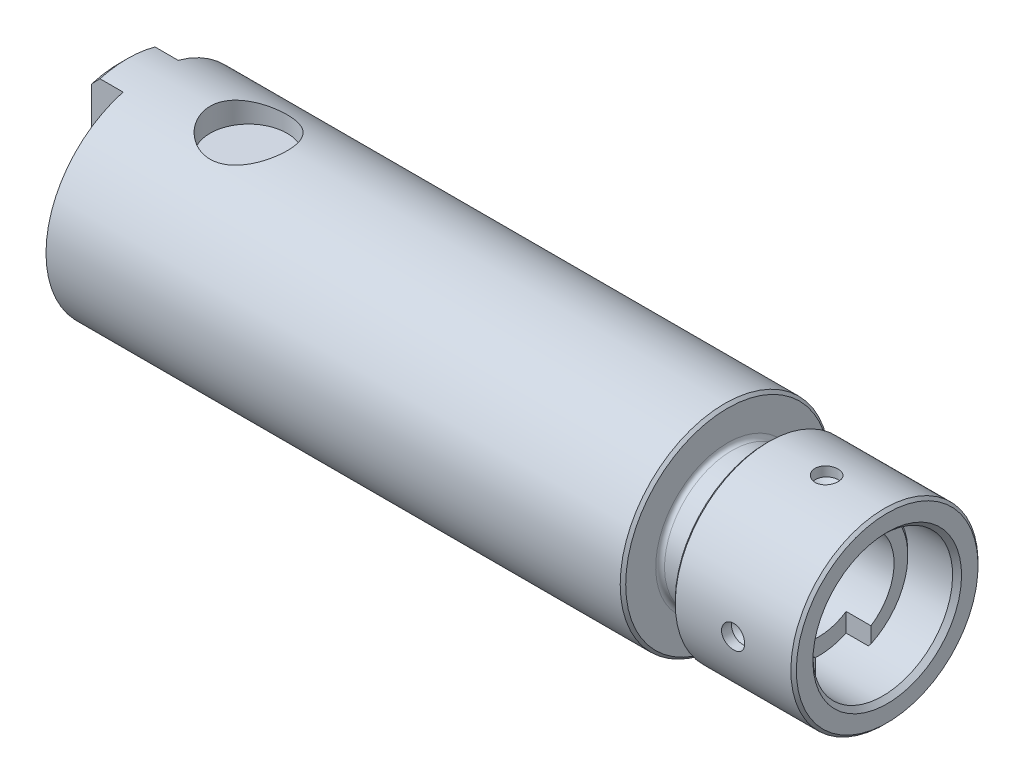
ISO-10303-21;
HEADER;
FILE_DESCRIPTION(('STEP AP214'),'2;1');
FILE_NAME('part.step','',(''),(''),'','','');
FILE_SCHEMA(('AUTOMOTIVE_DESIGN { 1 0 10303 214 1 1 1 1 }'));
ENDSEC;
DATA;
#1=APPLICATION_CONTEXT('core data for automotive mechanical design processes');
#2=APPLICATION_PROTOCOL_DEFINITION('international standard','automotive_design',2000,#1);
#3=PRODUCT_CONTEXT('',#1,'mechanical');
#4=PRODUCT('Part','Part','',(#3));
#5=PRODUCT_RELATED_PRODUCT_CATEGORY('part','',(#4));
#6=PRODUCT_DEFINITION_FORMATION('','',#4);
#7=PRODUCT_DEFINITION_CONTEXT('part definition',#1,'design');
#8=PRODUCT_DEFINITION('design','',#6,#7);
#9=PRODUCT_DEFINITION_SHAPE('','',#8);
#10=(LENGTH_UNIT() NAMED_UNIT(*) SI_UNIT(.MILLI.,.METRE.));
#11=(NAMED_UNIT(*) PLANE_ANGLE_UNIT() SI_UNIT($,.RADIAN.));
#12=(NAMED_UNIT(*) SI_UNIT($,.STERADIAN.) SOLID_ANGLE_UNIT());
#13=UNCERTAINTY_MEASURE_WITH_UNIT(LENGTH_MEASURE(1.E-05),#10,'distance_accuracy_value','');
#14=(GEOMETRIC_REPRESENTATION_CONTEXT(3) GLOBAL_UNCERTAINTY_ASSIGNED_CONTEXT((#13)) GLOBAL_UNIT_ASSIGNED_CONTEXT((#10,
#11,#12)) REPRESENTATION_CONTEXT('',''));
#15=CARTESIAN_POINT('',(0.,0.,0.));
#16=DIRECTION('',(0.,0.,1.));
#17=DIRECTION('',(1.,0.,0.));
#18=AXIS2_PLACEMENT_3D('',#15,#16,#17);
#19=CARTESIAN_POINT('',(116.,0.,0.));
#20=DIRECTION('',(1.,0.,0.));
#21=DIRECTION('',(0.,1.,0.));
#22=AXIS2_PLACEMENT_3D('',#19,#20,#21);
#23=CYLINDRICAL_SURFACE('',#22,17.);
#24=CARTESIAN_POINT('',(94.5,0.,0.));
#25=DIRECTION('',(1.,0.,0.));
#26=DIRECTION('',(0.,1.,0.));
#27=AXIS2_PLACEMENT_3D('',#24,#25,#26);
#28=CIRCLE('',#27,17.);
#29=CARTESIAN_POINT('',(94.5,17.,0.));
#30=VERTEX_POINT('',#29);
#31=EDGE_CURVE('E189',#30,#30,#28,.T.);
#32=ORIENTED_EDGE('',*,*,#31,.T.);
#33=EDGE_LOOP('',(#32));
#34=FACE_BOUND('',#33,.T.);
#35=CARTESIAN_POINT('',(105.,-2.1,16.8697954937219));
#36=CARTESIAN_POINT('',(104.88252590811,-2.09999499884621,16.8697971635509));
#37=CARTESIAN_POINT('',(104.764978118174,-2.0901094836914,16.8710358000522));
#38=CARTESIAN_POINT('',(104.533153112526,-2.05083005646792,16.8758547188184));
#39=CARTESIAN_POINT('',(104.418879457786,-2.02141568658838,16.8794374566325));
#40=CARTESIAN_POINT('',(104.196992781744,-1.94395823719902,16.8885327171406));
#41=CARTESIAN_POINT('',(104.089375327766,-1.89592771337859,16.894043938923));
#42=CARTESIAN_POINT('',(103.883748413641,-1.78262806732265,16.9063736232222));
#43=CARTESIAN_POINT('',(103.785737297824,-1.7173619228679,16.9131918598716));
#44=CARTESIAN_POINT('',(103.601548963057,-1.5710612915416,16.927409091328));
#45=CARTESIAN_POINT('',(103.515431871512,-1.48995135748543,16.9348107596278));
#46=CARTESIAN_POINT('',(103.357995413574,-1.31442790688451,16.9493368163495));
#47=CARTESIAN_POINT('',(103.286676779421,-1.22001373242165,16.9564611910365));
#48=CARTESIAN_POINT('',(103.160646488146,-1.02018451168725,16.9696572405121));
#49=CARTESIAN_POINT('',(103.105989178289,-0.914734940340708,16.9757254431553));
#50=CARTESIAN_POINT('',(103.015181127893,-0.696066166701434,16.9860960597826));
#51=CARTESIAN_POINT('',(102.979029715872,-0.582847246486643,16.9903985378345));
#52=CARTESIAN_POINT('',(102.926439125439,-0.352468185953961,16.9967341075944));
#53=CARTESIAN_POINT('',(102.909900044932,-0.235331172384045,16.9987786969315));
#54=CARTESIAN_POINT('',(102.8966940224,7.24128411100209E-05,17.0004073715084));
#55=CARTESIAN_POINT('',(102.90002631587,0.118338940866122,16.9999915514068));
#56=CARTESIAN_POINT('',(102.926388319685,0.351964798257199,16.9967555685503));
#57=CARTESIAN_POINT('',(102.949310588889,0.467336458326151,16.9939485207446));
#58=CARTESIAN_POINT('',(103.014033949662,0.692582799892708,16.9862602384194));
#59=CARTESIAN_POINT('',(103.05583539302,0.802457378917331,16.9813789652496));
#60=CARTESIAN_POINT('',(103.157244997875,1.01392363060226,16.9700681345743));
#61=CARTESIAN_POINT('',(103.21689972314,1.11549274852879,16.9636345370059));
#62=CARTESIAN_POINT('',(103.352288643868,1.30721886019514,16.9499389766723));
#63=CARTESIAN_POINT('',(103.428023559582,1.39737534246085,16.9426769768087));
#64=CARTESIAN_POINT('',(103.594024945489,1.56434805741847,16.928080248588));
#65=CARTESIAN_POINT('',(103.684385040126,1.64107122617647,16.9207453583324));
#66=CARTESIAN_POINT('',(103.876749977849,1.77827631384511,16.9068774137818));
#67=CARTESIAN_POINT('',(103.978754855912,1.8387581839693,16.9003443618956));
#68=CARTESIAN_POINT('',(104.191596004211,1.94176876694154,16.8888198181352));
#69=CARTESIAN_POINT('',(104.302435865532,1.98429013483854,16.8838289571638));
#70=CARTESIAN_POINT('',(104.529758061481,2.05009073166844,16.8759662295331));
#71=CARTESIAN_POINT('',(104.646240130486,2.07337086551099,16.8730942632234));
#72=CARTESIAN_POINT('',(104.880718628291,2.09990513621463,16.8698126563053));
#73=CARTESIAN_POINT('',(104.998700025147,2.10329019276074,16.8693869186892));
#74=CARTESIAN_POINT('',(105.23354825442,2.09028355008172,16.8710034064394));
#75=CARTESIAN_POINT('',(105.350415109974,2.07389226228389,16.8730455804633));
#76=CARTESIAN_POINT('',(105.579325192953,2.02190840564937,16.8793531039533));
#77=CARTESIAN_POINT('',(105.691383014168,1.98637913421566,16.8836111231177));
#78=CARTESIAN_POINT('',(105.907950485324,1.89719297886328,16.8938646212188));
#79=CARTESIAN_POINT('',(106.012459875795,1.84353547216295,16.8998601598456));
#80=CARTESIAN_POINT('',(106.21155645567,1.71929370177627,16.9129517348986));
#81=CARTESIAN_POINT('',(106.306089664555,1.64862352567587,16.9200532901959));
#82=CARTESIAN_POINT('',(106.481999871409,1.49248404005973,16.9345393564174));
#83=CARTESIAN_POINT('',(106.563376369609,1.40701416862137,16.9419238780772));
#84=CARTESIAN_POINT('',(106.711122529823,1.22312981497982,16.9561932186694));
#85=CARTESIAN_POINT('',(106.777406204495,1.1246459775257,16.9630750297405));
#86=CARTESIAN_POINT('',(106.892490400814,0.917866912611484,16.9755186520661));
#87=CARTESIAN_POINT('',(106.941291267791,0.809571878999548,16.9810804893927));
#88=CARTESIAN_POINT('',(107.019882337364,0.586531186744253,16.9902441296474));
#89=CARTESIAN_POINT('',(107.049722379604,0.471803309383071,16.993851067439));
#90=CARTESIAN_POINT('',(107.089706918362,0.238918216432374,16.9987198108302));
#91=CARTESIAN_POINT('',(107.099852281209,0.120761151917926,16.9999817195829));
#92=CARTESIAN_POINT('',(107.100143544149,-0.114788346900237,17.0000177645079));
#93=CARTESIAN_POINT('',(107.090422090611,-0.232180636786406,16.9988084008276));
#94=CARTESIAN_POINT('',(107.051536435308,-0.463649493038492,16.9940705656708));
#95=CARTESIAN_POINT('',(107.022372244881,-0.577726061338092,16.9905420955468));
#96=CARTESIAN_POINT('',(106.945470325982,-0.799308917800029,16.9815607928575));
#97=CARTESIAN_POINT('',(106.897738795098,-0.906817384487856,16.9761086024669));
#98=CARTESIAN_POINT('',(106.78507086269,-1.11231931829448,16.9638838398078));
#99=CARTESIAN_POINT('',(106.720134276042,-1.21031268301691,16.9571112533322));
#100=CARTESIAN_POINT('',(106.574408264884,-1.39468060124,16.9429478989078));
#101=CARTESIAN_POINT('',(106.493520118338,-1.4809768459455,16.9355534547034));
#102=CARTESIAN_POINT('',(106.318391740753,-1.6388230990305,16.921009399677));
#103=CARTESIAN_POINT('',(106.224148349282,-1.7103696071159,16.9138598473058));
#104=CARTESIAN_POINT('',(106.024577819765,-1.83691538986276,16.9005863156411));
#105=CARTESIAN_POINT('',(105.919210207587,-1.89185121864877,16.8944663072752));
#106=CARTESIAN_POINT('',(105.700729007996,-1.9831709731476,16.883991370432));
#107=CARTESIAN_POINT('',(105.587624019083,-2.01957512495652,16.8796345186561));
#108=CARTESIAN_POINT('',(105.394941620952,-2.06405903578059,16.8742397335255));
#109=CARTESIAN_POINT('',(105.316580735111,-2.07751757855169,16.8725814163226));
#110=CARTESIAN_POINT('',(105.158824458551,-2.09548971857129,16.8703587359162));
#111=CARTESIAN_POINT('',(105.07942907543,-2.10000338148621,16.8697943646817));
#112=CARTESIAN_POINT('',(105.,-2.1,16.8697954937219));
#113=B_SPLINE_CURVE_WITH_KNOTS('',3,(#35,#36,#37,#38,#39,#40,#41,#42,#43,#44,#45,#46,#47,#48,
#49,#50,#51,#52,#53,#54,#55,#56,#57,#58,#59,#60,#61,#62,#63,#64,#65,#66,#67,#68,#69,#70,#71,#72,
#73,#74,#75,#76,#77,#78,#79,#80,#81,#82,#83,#84,#85,#86,#87,#88,#89,#90,#91,#92,#93,#94,#95,#96,
#97,#98,#99,#100,#101,#102,#103,#104,#105,#106,#107,#108,#109,#110,#111,#112),.UNSPECIFIED.,.T.,
.F.,(4,2,2,2,2,2,2,2,2,2,2,2,2,2,2,2,2,2,2,2,2,2,2,2,2,2,2,2,2,2,2,2,2,2,2,2,2,2,4),(0.,
0.352132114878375,0.704633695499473,1.05689794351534,1.40910137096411,1.76302476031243,
2.11696565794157,2.47204901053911,2.82711947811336,3.18037339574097,3.53361372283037,
3.88492904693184,4.23625091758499,4.58849718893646,4.94075924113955,5.29537266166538,
5.64998714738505,6.00474651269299,6.35948919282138,6.71189484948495,7.06429317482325,
7.41553306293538,7.76678501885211,8.11984941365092,8.47292721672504,8.82796888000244,
9.18300352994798,9.53710104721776,9.8911829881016,10.2429085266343,10.5946338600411,
10.9462418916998,11.2978537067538,11.6517140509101,12.0056582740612,12.3609378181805,
12.7158287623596,12.9539215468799,13.1920125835),.UNSPECIFIED.);
#114=CARTESIAN_POINT('',(105.,-2.1,16.8697954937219));
#115=VERTEX_POINT('',#114);
#116=EDGE_CURVE('E386',#115,#115,#113,.T.);
#117=ORIENTED_EDGE('',*,*,#116,.T.);
#118=EDGE_LOOP('',(#117));
#119=FACE_BOUND('',#118,.T.);
#120=CARTESIAN_POINT('',(102.9,17.,0.));
#121=CARTESIAN_POINT('',(102.900004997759,16.9999983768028,-0.117477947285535));
#122=CARTESIAN_POINT('',(102.909891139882,16.9987693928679,-0.23502958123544));
#123=CARTESIAN_POINT('',(102.949173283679,16.9939849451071,-0.466862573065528));
#124=CARTESIAN_POINT('',(102.978589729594,16.9904270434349,-0.58114037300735));
#125=CARTESIAN_POINT('',(103.056053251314,16.9813856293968,-0.803035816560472));
#126=CARTESIAN_POINT('',(103.104087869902,16.9759034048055,-0.910657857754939));
#127=CARTESIAN_POINT('',(103.217397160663,16.9636232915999,-1.11629246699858));
#128=CARTESIAN_POINT('',(103.2826688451,16.9568256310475,-1.21430669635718));
#129=CARTESIAN_POINT('',(103.428975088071,16.9426328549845,-1.39849155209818));
#130=CARTESIAN_POINT('',(103.510083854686,16.9352350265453,-1.4846030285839));
#131=CARTESIAN_POINT('',(103.685602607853,16.9206976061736,-1.6420286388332));
#132=CARTESIAN_POINT('',(103.780013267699,16.9135580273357,-1.71334202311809));
#133=CARTESIAN_POINT('',(103.979839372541,16.9003187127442,-1.83936679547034));
#134=CARTESIAN_POINT('',(104.085289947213,16.8942224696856,-1.89402288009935));
#135=CARTESIAN_POINT('',(104.303960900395,16.8837957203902,-1.98482838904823));
#136=CARTESIAN_POINT('',(104.417180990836,16.8794651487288,-2.02097849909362));
#137=CARTESIAN_POINT('',(104.647563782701,16.8730858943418,-2.07356641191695));
#138=CARTESIAN_POINT('',(104.764703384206,16.8710256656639,-2.09010398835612));
#139=CARTESIAN_POINT('',(105.000112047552,16.8693849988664,-2.10330610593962));
#140=CARTESIAN_POINT('',(105.118381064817,16.8698044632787,-2.09997142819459));
#141=CARTESIAN_POINT('',(105.351996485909,16.8730652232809,-2.07360562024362));
#142=CARTESIAN_POINT('',(105.467355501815,16.8758930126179,-2.05068433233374));
#143=CARTESIAN_POINT('',(105.692577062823,16.8836307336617,-1.98596730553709));
#144=CARTESIAN_POINT('',(105.802439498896,16.8885407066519,-1.94417119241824));
#145=CARTESIAN_POINT('',(106.013890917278,16.8999048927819,-1.84277268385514));
#146=CARTESIAN_POINT('',(106.115456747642,16.9063632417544,-1.78312249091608));
#147=CARTESIAN_POINT('',(106.307178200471,16.9200932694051,-1.64774327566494));
#148=CARTESIAN_POINT('',(106.397333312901,16.9273649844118,-1.57201353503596));
#149=CARTESIAN_POINT('',(106.564311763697,16.9419624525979,-1.4060158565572));
#150=CARTESIAN_POINT('',(106.641040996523,16.9492882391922,-1.31565322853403));
#151=CARTESIAN_POINT('',(106.778257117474,16.9631224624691,-1.12328104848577));
#152=CARTESIAN_POINT('',(106.838743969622,16.9696308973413,-1.02127147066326));
#153=CARTESIAN_POINT('',(106.941758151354,16.98110099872,-0.808428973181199));
#154=CARTESIAN_POINT('',(106.984279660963,16.9860621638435,-0.697593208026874));
#155=CARTESIAN_POINT('',(107.050081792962,16.9938741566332,-0.470279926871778));
#156=CARTESIAN_POINT('',(107.073363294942,16.9967250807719,-0.353802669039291));
#157=CARTESIAN_POINT('',(107.099902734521,16.9999828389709,-0.119326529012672));
#158=CARTESIAN_POINT('',(107.103290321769,17.0004054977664,-0.00134253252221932));
#159=CARTESIAN_POINT('',(107.090287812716,16.9988018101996,0.233511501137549));
#160=CARTESIAN_POINT('',(107.07389812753,16.9967755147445,0.350381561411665));
#161=CARTESIAN_POINT('',(107.021914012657,16.9905114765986,0.579308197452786));
#162=CARTESIAN_POINT('',(106.986381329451,16.9862808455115,0.691379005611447));
#163=CARTESIAN_POINT('',(106.897184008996,16.9760818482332,0.907970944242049));
#164=CARTESIAN_POINT('',(106.843518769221,16.9701134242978,1.0124918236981));
#165=CARTESIAN_POINT('',(106.719265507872,16.957064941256,1.21159642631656));
#166=CARTESIAN_POINT('',(106.648593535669,16.9499794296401,1.30612739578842));
#167=CARTESIAN_POINT('',(106.492451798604,16.9355066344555,1.48203224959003));
#168=CARTESIAN_POINT('',(106.406981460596,16.9281193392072,1.5634056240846));
#169=CARTESIAN_POINT('',(106.223098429,16.9138268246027,1.7111447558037));
#170=CARTESIAN_POINT('',(106.124616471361,16.9069245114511,1.7774246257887));
#171=CARTESIAN_POINT('',(105.917842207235,16.894431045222,1.89250215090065));
#172=CARTESIAN_POINT('',(105.809550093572,16.8888398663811,1.94130014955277));
#173=CARTESIAN_POINT('',(105.586507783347,16.8796214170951,2.01988938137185));
#174=CARTESIAN_POINT('',(105.471774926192,16.875989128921,2.0497292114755));
#175=CARTESIAN_POINT('',(105.238879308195,16.8710852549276,2.08971163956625));
#176=CARTESIAN_POINT('',(105.12071670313,16.8698135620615,2.09985513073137));
#177=CARTESIAN_POINT('',(104.885170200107,16.869777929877,2.1001408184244));
#178=CARTESIAN_POINT('',(104.767786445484,16.8709970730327,2.09041794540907));
#179=CARTESIAN_POINT('',(104.536335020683,16.8757693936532,2.05153244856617));
#180=CARTESIAN_POINT('',(104.422267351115,16.8793225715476,2.02236982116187));
#181=CARTESIAN_POINT('',(104.200702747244,16.8883574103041,1.94547451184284));
#182=CARTESIAN_POINT('',(104.093203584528,16.8938384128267,1.89774816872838));
#183=CARTESIAN_POINT('',(103.887718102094,16.906112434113,1.78509350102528));
#184=CARTESIAN_POINT('',(103.789731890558,16.9129054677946,1.72016498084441));
#185=CARTESIAN_POINT('',(103.605363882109,16.9270934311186,1.57444797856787));
#186=CARTESIAN_POINT('',(103.519061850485,16.9344919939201,1.49355892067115));
#187=CARTESIAN_POINT('',(103.36120434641,16.9490252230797,1.31842632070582));
#188=CARTESIAN_POINT('',(103.28965235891,16.9561598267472,1.2241796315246));
#189=CARTESIAN_POINT('',(103.163100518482,16.9693904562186,1.02460628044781));
#190=CARTESIAN_POINT('',(103.108163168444,16.9754825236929,0.919239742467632));
#191=CARTESIAN_POINT('',(103.016840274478,16.9859014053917,0.700760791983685));
#192=CARTESIAN_POINT('',(102.980434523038,16.9902301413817,0.587656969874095));
#193=CARTESIAN_POINT('',(102.935946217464,16.9955882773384,0.394970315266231));
#194=CARTESIAN_POINT('',(102.92248569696,16.9972346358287,0.316603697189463));
#195=CARTESIAN_POINT('',(102.904510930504,16.9994410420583,0.158835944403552));
#196=CARTESIAN_POINT('',(102.899996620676,17.0000010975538,0.0794348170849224));
#197=CARTESIAN_POINT('',(102.9,17.,0.));
#198=B_SPLINE_CURVE_WITH_KNOTS('',3,(#120,#121,#122,#123,#124,#125,#126,#127,#128,#129,#130,
#131,#132,#133,#134,#135,#136,#137,#138,#139,#140,#141,#142,#143,#144,#145,#146,#147,#148,#149,
#150,#151,#152,#153,#154,#155,#156,#157,#158,#159,#160,#161,#162,#163,#164,#165,#166,#167,#168,
#169,#170,#171,#172,#173,#174,#175,#176,#177,#178,#179,#180,#181,#182,#183,#184,#185,#186,#187,
#188,#189,#190,#191,#192,#193,#194,#195,#196,#197),.UNSPECIFIED.,.T.,.F.,(4,2,2,2,2,2,2,2,2,2,2,
2,2,2,2,2,2,2,2,2,2,2,2,2,2,2,2,2,2,2,2,2,2,2,2,2,2,2,4),(0.,0.352143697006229,
0.704656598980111,1.05693404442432,1.40915046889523,1.76305869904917,2.11698484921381,
2.47207357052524,2.82714913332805,3.18041048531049,3.53365795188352,3.88493730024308,
4.23622361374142,4.58845890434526,4.94070993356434,5.29533885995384,5.64996857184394,
6.00471308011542,6.35944136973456,6.71185528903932,7.06426188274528,7.41553852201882,
7.76682683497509,8.11988613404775,8.47295911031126,8.8279936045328,9.18302112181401,
9.53713485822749,9.89123253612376,10.2429332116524,10.5946339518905,10.9462147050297,
11.2977994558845,11.651674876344,12.0056338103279,12.3609082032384,12.7157943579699,
12.9539043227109,13.1920125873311),.UNSPECIFIED.);
#199=CARTESIAN_POINT('',(102.9,17.,0.));
#200=VERTEX_POINT('',#199);
#201=EDGE_CURVE('E379',#200,#200,#198,.T.);
#202=ORIENTED_EDGE('',*,*,#201,.T.);
#203=EDGE_LOOP('',(#202));
#204=FACE_BOUND('',#203,.T.);
#205=CARTESIAN_POINT('',(115.5,0.,0.));
#206=DIRECTION('',(1.,0.,0.));
#207=DIRECTION('',(0.,1.,0.));
#208=AXIS2_PLACEMENT_3D('',#205,#206,#207);
#209=CIRCLE('',#208,17.);
#210=CARTESIAN_POINT('',(115.5,17.,0.));
#211=VERTEX_POINT('',#210);
#212=EDGE_CURVE('E192',#211,#211,#209,.T.);
#213=ORIENTED_EDGE('',*,*,#212,.F.);
#214=EDGE_LOOP('',(#213));
#215=FACE_BOUND('',#214,.T.);
#216=CARTESIAN_POINT('',(105.,-2.09999999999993,-16.8697954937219));
#217=CARTESIAN_POINT('',(105.11747409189,-2.09999499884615,-16.8697971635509));
#218=CARTESIAN_POINT('',(105.235021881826,-2.09010948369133,-16.8710358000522));
#219=CARTESIAN_POINT('',(105.466846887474,-2.05083005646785,-16.8758547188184));
#220=CARTESIAN_POINT('',(105.581120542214,-2.02141568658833,-16.8794374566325));
#221=CARTESIAN_POINT('',(105.803007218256,-1.94395823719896,-16.8885327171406));
#222=CARTESIAN_POINT('',(105.910624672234,-1.89592771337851,-16.8940439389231));
#223=CARTESIAN_POINT('',(106.116251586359,-1.78262806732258,-16.9063736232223));
#224=CARTESIAN_POINT('',(106.214262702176,-1.71736192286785,-16.9131918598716));
#225=CARTESIAN_POINT('',(106.398451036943,-1.57106129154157,-16.927409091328));
#226=CARTESIAN_POINT('',(106.484568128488,-1.48995135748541,-16.9348107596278));
#227=CARTESIAN_POINT('',(106.642004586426,-1.31442790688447,-16.9493368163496));
#228=CARTESIAN_POINT('',(106.713323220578,-1.22001373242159,-16.9564611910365));
#229=CARTESIAN_POINT('',(106.839353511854,-1.02018451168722,-16.9696572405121));
#230=CARTESIAN_POINT('',(106.894010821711,-0.91473494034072,-16.9757254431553));
#231=CARTESIAN_POINT('',(106.984818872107,-0.69606616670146,-16.9860960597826));
#232=CARTESIAN_POINT('',(107.020970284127,-0.582847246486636,-16.9903985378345));
#233=CARTESIAN_POINT('',(107.073560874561,-0.352468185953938,-16.9967341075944));
#234=CARTESIAN_POINT('',(107.090099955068,-0.235331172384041,-16.9987786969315));
#235=CARTESIAN_POINT('',(107.1033059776,7.24128411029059E-05,-17.0004073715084));
#236=CARTESIAN_POINT('',(107.09997368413,0.118338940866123,-16.9999915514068));
#237=CARTESIAN_POINT('',(107.073611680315,0.351964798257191,-16.9967555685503));
#238=CARTESIAN_POINT('',(107.050689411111,0.467336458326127,-16.9939485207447));
#239=CARTESIAN_POINT('',(106.985966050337,0.692582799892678,-16.9862602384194));
#240=CARTESIAN_POINT('',(106.94416460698,0.802457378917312,-16.9813789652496));
#241=CARTESIAN_POINT('',(106.842755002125,1.01392363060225,-16.9700681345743));
#242=CARTESIAN_POINT('',(106.78310027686,1.11549274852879,-16.9636345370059));
#243=CARTESIAN_POINT('',(106.647711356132,1.30721886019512,-16.9499389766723));
#244=CARTESIAN_POINT('',(106.571976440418,1.3973753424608,-16.9426769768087));
#245=CARTESIAN_POINT('',(106.405975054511,1.56434805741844,-16.928080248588));
#246=CARTESIAN_POINT('',(106.315614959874,1.64107122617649,-16.9207453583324));
#247=CARTESIAN_POINT('',(106.123250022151,1.77827631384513,-16.9068774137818));
#248=CARTESIAN_POINT('',(106.021245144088,1.83875818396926,-16.9003443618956));
#249=CARTESIAN_POINT('',(105.808403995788,1.94176876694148,-16.8888198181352));
#250=CARTESIAN_POINT('',(105.697564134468,1.98429013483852,-16.8838289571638));
#251=CARTESIAN_POINT('',(105.470241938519,2.05009073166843,-16.8759662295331));
#252=CARTESIAN_POINT('',(105.353759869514,2.07337086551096,-16.8730942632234));
#253=CARTESIAN_POINT('',(105.119281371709,2.09990513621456,-16.8698126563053));
#254=CARTESIAN_POINT('',(105.001299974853,2.10329019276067,-16.8693869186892));
#255=CARTESIAN_POINT('',(104.766451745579,2.09028355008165,-16.8710034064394));
#256=CARTESIAN_POINT('',(104.649584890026,2.07389226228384,-16.8730455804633));
#257=CARTESIAN_POINT('',(104.420674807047,2.02190840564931,-16.8793531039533));
#258=CARTESIAN_POINT('',(104.308616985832,1.9863791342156,-16.8836111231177));
#259=CARTESIAN_POINT('',(104.092049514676,1.89719297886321,-16.8938646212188));
#260=CARTESIAN_POINT('',(103.987540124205,1.8435354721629,-16.8998601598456));
#261=CARTESIAN_POINT('',(103.78844354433,1.71929370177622,-16.9129517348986));
#262=CARTESIAN_POINT('',(103.693910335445,1.6486235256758,-16.9200532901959));
#263=CARTESIAN_POINT('',(103.518000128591,1.49248404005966,-16.9345393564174));
#264=CARTESIAN_POINT('',(103.436623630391,1.40701416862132,-16.9419238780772));
#265=CARTESIAN_POINT('',(103.288877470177,1.22312981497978,-16.9561932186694));
#266=CARTESIAN_POINT('',(103.222593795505,1.12464597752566,-16.9630750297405));
#267=CARTESIAN_POINT('',(103.107509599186,0.917866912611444,-16.9755186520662));
#268=CARTESIAN_POINT('',(103.058708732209,0.809571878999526,-16.9810804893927));
#269=CARTESIAN_POINT('',(102.980117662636,0.58653118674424,-16.9902441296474));
#270=CARTESIAN_POINT('',(102.950277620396,0.471803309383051,-16.993851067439));
#271=CARTESIAN_POINT('',(102.910293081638,0.238918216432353,-16.9987198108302));
#272=CARTESIAN_POINT('',(102.900147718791,0.120761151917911,-16.9999817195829));
#273=CARTESIAN_POINT('',(102.899856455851,-0.114788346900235,-17.0000177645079));
#274=CARTESIAN_POINT('',(102.909577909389,-0.232180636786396,-16.9988084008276));
#275=CARTESIAN_POINT('',(102.948463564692,-0.463649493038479,-16.9940705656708));
#276=CARTESIAN_POINT('',(102.977627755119,-0.577726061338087,-16.9905420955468));
#277=CARTESIAN_POINT('',(103.054529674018,-0.799308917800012,-16.9815607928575));
#278=CARTESIAN_POINT('',(103.102261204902,-0.90681738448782,-16.9761086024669));
#279=CARTESIAN_POINT('',(103.21492913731,-1.11231931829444,-16.9638838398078));
#280=CARTESIAN_POINT('',(103.279865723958,-1.2103126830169,-16.9571112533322));
#281=CARTESIAN_POINT('',(103.425591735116,-1.39468060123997,-16.9429478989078));
#282=CARTESIAN_POINT('',(103.506479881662,-1.48097684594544,-16.9355534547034));
#283=CARTESIAN_POINT('',(103.681608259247,-1.63882309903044,-16.9210093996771));
#284=CARTESIAN_POINT('',(103.775851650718,-1.71036960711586,-16.9138598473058));
#285=CARTESIAN_POINT('',(103.975422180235,-1.83691538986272,-16.9005863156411));
#286=CARTESIAN_POINT('',(104.080789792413,-1.89185121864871,-16.8944663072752));
#287=CARTESIAN_POINT('',(104.299270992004,-1.98317097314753,-16.883991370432));
#288=CARTESIAN_POINT('',(104.412375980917,-2.01957512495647,-16.8796345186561));
#289=CARTESIAN_POINT('',(104.605058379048,-2.06405903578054,-16.8742397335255));
#290=CARTESIAN_POINT('',(104.683419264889,-2.07751757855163,-16.8725814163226));
#291=CARTESIAN_POINT('',(104.841175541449,-2.09548971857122,-16.8703587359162));
#292=CARTESIAN_POINT('',(104.92057092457,-2.10000338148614,-16.8697943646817));
#293=CARTESIAN_POINT('',(105.,-2.09999999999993,-16.8697954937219));
#294=B_SPLINE_CURVE_WITH_KNOTS('',3,(#216,#217,#218,#219,#220,#221,#222,#223,#224,#225,#226,
#227,#228,#229,#230,#231,#232,#233,#234,#235,#236,#237,#238,#239,#240,#241,#242,#243,#244,#245,
#246,#247,#248,#249,#250,#251,#252,#253,#254,#255,#256,#257,#258,#259,#260,#261,#262,#263,#264,
#265,#266,#267,#268,#269,#270,#271,#272,#273,#274,#275,#276,#277,#278,#279,#280,#281,#282,#283,
#284,#285,#286,#287,#288,#289,#290,#291,#292,#293),.UNSPECIFIED.,.T.,.F.,(4,2,2,2,2,2,2,2,2,2,2,
2,2,2,2,2,2,2,2,2,2,2,2,2,2,2,2,2,2,2,2,2,2,2,2,2,2,2,4),(0.,0.352132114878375,
0.704633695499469,1.05689794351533,1.40910137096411,1.76302476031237,2.11696565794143,
2.47204901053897,2.82711947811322,3.18037339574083,3.53361372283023,3.88492904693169,
4.23625091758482,4.58849718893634,4.94075924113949,5.29537266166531,5.64998714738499,
6.00474651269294,6.35948919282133,6.7118948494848,7.06429317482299,7.41553306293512,
7.76678501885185,8.11984941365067,8.47292721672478,8.82796888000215,9.18300352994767,
9.53710104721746,9.89118298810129,10.2429085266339,10.5946338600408,10.9462418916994,
11.2978537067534,11.6517140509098,12.0056582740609,12.3609378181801,12.7158287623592,
12.9539215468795,13.1920125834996),.UNSPECIFIED.);
#295=CARTESIAN_POINT('',(105.,-2.09999999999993,-16.8697954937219));
#296=VERTEX_POINT('',#295);
#297=EDGE_CURVE('E27',#296,#296,#294,.T.);
#298=ORIENTED_EDGE('',*,*,#297,.T.);
#299=EDGE_LOOP('',(#298));
#300=FACE_BOUND('',#299,.T.);
#301=CARTESIAN_POINT('',(102.9,-17.,0.));
#302=CARTESIAN_POINT('',(102.900004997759,-16.9999983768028,0.117477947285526));
#303=CARTESIAN_POINT('',(102.909891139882,-16.9987693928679,0.235029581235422));
#304=CARTESIAN_POINT('',(102.949173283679,-16.9939849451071,0.466862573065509));
#305=CARTESIAN_POINT('',(102.978589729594,-16.9904270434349,0.581140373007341));
#306=CARTESIAN_POINT('',(103.056053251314,-16.9813856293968,0.803035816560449));
#307=CARTESIAN_POINT('',(103.104087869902,-16.9759034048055,0.91065785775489));
#308=CARTESIAN_POINT('',(103.217397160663,-16.9636232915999,1.11629246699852));
#309=CARTESIAN_POINT('',(103.2826688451,-16.9568256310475,1.21430669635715));
#310=CARTESIAN_POINT('',(103.428975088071,-16.9426328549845,1.39849155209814));
#311=CARTESIAN_POINT('',(103.510083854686,-16.9352350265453,1.48460302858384));
#312=CARTESIAN_POINT('',(103.685602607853,-16.9206976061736,1.64202863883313));
#313=CARTESIAN_POINT('',(103.780013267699,-16.9135580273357,1.71334202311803));
#314=CARTESIAN_POINT('',(103.979839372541,-16.9003187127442,1.83936679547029));
#315=CARTESIAN_POINT('',(104.085289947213,-16.8942224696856,1.89402288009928));
#316=CARTESIAN_POINT('',(104.303960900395,-16.8837957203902,1.98482838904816));
#317=CARTESIAN_POINT('',(104.417180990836,-16.8794651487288,2.02097849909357));
#318=CARTESIAN_POINT('',(104.647563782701,-16.8730858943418,2.0735664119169));
#319=CARTESIAN_POINT('',(104.764703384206,-16.8710256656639,2.09010398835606));
#320=CARTESIAN_POINT('',(105.000112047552,-16.8693849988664,2.10330610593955));
#321=CARTESIAN_POINT('',(105.118381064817,-16.8698044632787,2.09997142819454));
#322=CARTESIAN_POINT('',(105.351996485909,-16.8730652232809,2.07360562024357));
#323=CARTESIAN_POINT('',(105.467355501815,-16.875893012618,2.05068433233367));
#324=CARTESIAN_POINT('',(105.692577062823,-16.8836307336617,1.98596730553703));
#325=CARTESIAN_POINT('',(105.802439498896,-16.8885407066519,1.94417119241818));
#326=CARTESIAN_POINT('',(106.013890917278,-16.8999048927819,1.84277268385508));
#327=CARTESIAN_POINT('',(106.115456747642,-16.9063632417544,1.783122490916));
#328=CARTESIAN_POINT('',(106.307178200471,-16.9200932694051,1.64774327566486));
#329=CARTESIAN_POINT('',(106.397333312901,-16.9273649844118,1.57201353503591));
#330=CARTESIAN_POINT('',(106.564311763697,-16.9419624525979,1.40601585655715));
#331=CARTESIAN_POINT('',(106.641040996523,-16.9492882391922,1.31565322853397));
#332=CARTESIAN_POINT('',(106.778257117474,-16.9631224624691,1.12328104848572));
#333=CARTESIAN_POINT('',(106.838743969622,-16.9696308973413,1.02127147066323));
#334=CARTESIAN_POINT('',(106.941758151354,-16.98110099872,0.808428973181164));
#335=CARTESIAN_POINT('',(106.984279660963,-16.9860621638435,0.697593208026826));
#336=CARTESIAN_POINT('',(107.050081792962,-16.9938741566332,0.470279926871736));
#337=CARTESIAN_POINT('',(107.073363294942,-16.9967250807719,0.353802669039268));
#338=CARTESIAN_POINT('',(107.099902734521,-16.9999828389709,0.119326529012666));
#339=CARTESIAN_POINT('',(107.103290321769,-17.0004054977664,0.00134253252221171));
#340=CARTESIAN_POINT('',(107.090287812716,-16.9988018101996,-0.233511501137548));
#341=CARTESIAN_POINT('',(107.07389812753,-16.9967755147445,-0.350381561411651));
#342=CARTESIAN_POINT('',(107.021914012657,-16.9905114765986,-0.579308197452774));
#343=CARTESIAN_POINT('',(106.986381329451,-16.9862808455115,-0.691379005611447));
#344=CARTESIAN_POINT('',(106.897184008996,-16.9760818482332,-0.907970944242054));
#345=CARTESIAN_POINT('',(106.843518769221,-16.9701134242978,-1.0124918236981));
#346=CARTESIAN_POINT('',(106.719265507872,-16.957064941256,-1.21159642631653));
#347=CARTESIAN_POINT('',(106.648593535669,-16.9499794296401,-1.30612739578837));
#348=CARTESIAN_POINT('',(106.492451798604,-16.9355066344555,-1.48203224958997));
#349=CARTESIAN_POINT('',(106.406981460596,-16.9281193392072,-1.56340562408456));
#350=CARTESIAN_POINT('',(106.223098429,-16.9138268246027,-1.71114475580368));
#351=CARTESIAN_POINT('',(106.124616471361,-16.9069245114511,-1.77742462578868));
#352=CARTESIAN_POINT('',(105.917842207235,-16.894431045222,-1.89250215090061));
#353=CARTESIAN_POINT('',(105.809550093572,-16.8888398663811,-1.94130014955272));
#354=CARTESIAN_POINT('',(105.586507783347,-16.8796214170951,-2.01988938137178));
#355=CARTESIAN_POINT('',(105.471774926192,-16.875989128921,-2.04972921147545));
#356=CARTESIAN_POINT('',(105.238879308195,-16.8710852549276,-2.0897116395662));
#357=CARTESIAN_POINT('',(105.12071670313,-16.8698135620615,-2.09985513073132));
#358=CARTESIAN_POINT('',(104.885170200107,-16.869777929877,-2.10014081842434));
#359=CARTESIAN_POINT('',(104.767786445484,-16.8709970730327,-2.09041794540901));
#360=CARTESIAN_POINT('',(104.536335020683,-16.8757693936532,-2.05153244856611));
#361=CARTESIAN_POINT('',(104.422267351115,-16.8793225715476,-2.02236982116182));
#362=CARTESIAN_POINT('',(104.200702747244,-16.8883574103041,-1.94547451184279));
#363=CARTESIAN_POINT('',(104.093203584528,-16.8938384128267,-1.89774816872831));
#364=CARTESIAN_POINT('',(103.887718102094,-16.9061124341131,-1.78509350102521));
#365=CARTESIAN_POINT('',(103.789731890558,-16.9129054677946,-1.72016498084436));
#366=CARTESIAN_POINT('',(103.605363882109,-16.9270934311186,-1.57444797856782));
#367=CARTESIAN_POINT('',(103.519061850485,-16.9344919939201,-1.49355892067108));
#368=CARTESIAN_POINT('',(103.36120434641,-16.9490252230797,-1.31842632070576));
#369=CARTESIAN_POINT('',(103.28965235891,-16.9561598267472,-1.22417963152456));
#370=CARTESIAN_POINT('',(103.163100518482,-16.9693904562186,-1.02460628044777));
#371=CARTESIAN_POINT('',(103.108163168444,-16.9754825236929,-0.91923974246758));
#372=CARTESIAN_POINT('',(103.016840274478,-16.9859014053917,-0.700760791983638));
#373=CARTESIAN_POINT('',(102.980434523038,-16.9902301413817,-0.587656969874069));
#374=CARTESIAN_POINT('',(102.935946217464,-16.9955882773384,-0.394970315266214));
#375=CARTESIAN_POINT('',(102.92248569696,-16.9972346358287,-0.316603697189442));
#376=CARTESIAN_POINT('',(102.904510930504,-16.9994410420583,-0.158835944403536));
#377=CARTESIAN_POINT('',(102.899996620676,-17.0000010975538,-0.0794348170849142));
#378=CARTESIAN_POINT('',(102.9,-17.,0.));
#379=B_SPLINE_CURVE_WITH_KNOTS('',3,(#301,#302,#303,#304,#305,#306,#307,#308,#309,#310,#311,
#312,#313,#314,#315,#316,#317,#318,#319,#320,#321,#322,#323,#324,#325,#326,#327,#328,#329,#330,
#331,#332,#333,#334,#335,#336,#337,#338,#339,#340,#341,#342,#343,#344,#345,#346,#347,#348,#349,
#350,#351,#352,#353,#354,#355,#356,#357,#358,#359,#360,#361,#362,#363,#364,#365,#366,#367,#368,
#369,#370,#371,#372,#373,#374,#375,#376,#377,#378),.UNSPECIFIED.,.T.,.F.,(4,2,2,2,2,2,2,2,2,2,2,
2,2,2,2,2,2,2,2,2,2,2,2,2,2,2,2,2,2,2,2,2,2,2,2,2,2,2,4),(0.,0.352143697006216,
0.704656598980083,1.05693404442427,1.40915046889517,1.76305869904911,2.11698484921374,
2.47207357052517,2.82714913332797,3.18041048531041,3.53365795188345,3.88493730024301,
4.23622361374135,4.5884589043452,4.94070993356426,5.29533885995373,5.64996857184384,
6.00471308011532,6.35944136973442,6.71185528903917,7.06426188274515,7.41553852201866,
7.76682683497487,8.11988613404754,8.47295911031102,8.82799360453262,9.18302112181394,
9.53713485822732,9.8912325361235,10.2429332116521,10.5946339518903,10.9462147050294,
11.2977994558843,11.6516748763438,12.0056338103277,12.3609082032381,12.7157943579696,
12.9539043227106,13.1920125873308),.UNSPECIFIED.);
#380=CARTESIAN_POINT('',(102.9,-17.,0.));
#381=VERTEX_POINT('',#380);
#382=EDGE_CURVE('E9',#381,#381,#379,.T.);
#383=ORIENTED_EDGE('',*,*,#382,.T.);
#384=EDGE_LOOP('',(#383));
#385=FACE_BOUND('',#384,.T.);
#386=ADVANCED_FACE('F14',(#34,#119,#204,#215,#300,#385),#23,.T.);
#387=CARTESIAN_POINT('',(108.,0.,0.));
#388=DIRECTION('',(1.,0.,0.));
#389=DIRECTION('',(0.,1.,0.));
#390=AXIS2_PLACEMENT_3D('',#387,#388,#389);
#391=CYLINDRICAL_SURFACE('',#390,19.);
#392=CARTESIAN_POINT('',(86.5,0.,0.));
#393=DIRECTION('',(1.,0.,0.));
#394=DIRECTION('',(0.,1.,0.));
#395=AXIS2_PLACEMENT_3D('',#392,#393,#394);
#396=CIRCLE('',#395,19.);
#397=CARTESIAN_POINT('',(86.5,19.,0.));
#398=VERTEX_POINT('',#397);
#399=EDGE_CURVE('E559',#398,#398,#396,.T.);
#400=ORIENTED_EDGE('',*,*,#399,.F.);
#401=EDGE_LOOP('',(#400));
#402=FACE_BOUND('',#401,.T.);
#403=CARTESIAN_POINT('',(-7.,-19.,0.));
#404=CARTESIAN_POINT('',(-7.00000073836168,-19.0000005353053,-0.189735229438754));
#405=CARTESIAN_POINT('',(-6.99227992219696,-18.9971517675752,-0.379460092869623));
#406=CARTESIAN_POINT('',(-6.96147185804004,-18.9858337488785,-0.757558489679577));
#407=CARTESIAN_POINT('',(-6.93837931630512,-18.9773625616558,-0.945931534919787));
#408=CARTESIAN_POINT('',(-6.87706807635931,-18.9550323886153,-1.3197721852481));
#409=CARTESIAN_POINT('',(-6.83885699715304,-18.9411761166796,-1.50524120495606));
#410=CARTESIAN_POINT('',(-6.74765745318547,-18.9084391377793,-1.87212834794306));
#411=CARTESIAN_POINT('',(-6.69466326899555,-18.8895564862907,-2.05354487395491));
#412=CARTESIAN_POINT('',(-6.57452217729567,-18.8473125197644,-2.41061437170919));
#413=CARTESIAN_POINT('',(-6.50740816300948,-18.8239616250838,-2.58627966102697));
#414=CARTESIAN_POINT('',(-6.35949041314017,-18.7733398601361,-2.93123074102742));
#415=CARTESIAN_POINT('',(-6.27868185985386,-18.7460676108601,-3.10051426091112));
#416=CARTESIAN_POINT('',(-6.1040127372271,-18.6882899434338,-3.43162738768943));
#417=CARTESIAN_POINT('',(-6.01015203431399,-18.6577844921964,-3.59345691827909));
#418=CARTESIAN_POINT('',(-5.81003692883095,-18.5942874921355,-3.9087516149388));
#419=CARTESIAN_POINT('',(-5.70378193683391,-18.5612958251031,-4.06221638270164));
#420=CARTESIAN_POINT('',(-5.47537891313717,-18.492362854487,-4.36550044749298));
#421=CARTESIAN_POINT('',(-5.3527858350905,-18.4563574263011,-4.51497012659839));
#422=CARTESIAN_POINT('',(-5.09582605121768,-18.3834782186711,-4.80310422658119));
#423=CARTESIAN_POINT('',(-4.96146286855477,-18.3466047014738,-4.94177185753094));
#424=CARTESIAN_POINT('',(-4.68164626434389,-18.2729195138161,-5.20763434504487));
#425=CARTESIAN_POINT('',(-4.53618600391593,-18.2361078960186,-5.33482201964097));
#426=CARTESIAN_POINT('',(-4.23514216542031,-18.163565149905,-5.57681406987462));
#427=CARTESIAN_POINT('',(-4.07956223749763,-18.1278336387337,-5.69162287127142));
#428=CARTESIAN_POINT('',(-3.75318453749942,-18.0571340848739,-5.91217516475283));
#429=CARTESIAN_POINT('',(-3.58203673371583,-18.0222431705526,-6.0174262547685));
#430=CARTESIAN_POINT('',(-3.23089743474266,-17.9557511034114,-6.21302459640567));
#431=CARTESIAN_POINT('',(-3.05090928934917,-17.9241487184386,-6.30337743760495));
#432=CARTESIAN_POINT('',(-2.6832365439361,-17.8652411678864,-6.46844982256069));
#433=CARTESIAN_POINT('',(-2.49555269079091,-17.8379355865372,-6.54317087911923));
#434=CARTESIAN_POINT('',(-2.11381108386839,-17.7885466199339,-6.67627561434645));
#435=CARTESIAN_POINT('',(-1.9197536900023,-17.7664629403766,-6.73466021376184));
#436=CARTESIAN_POINT('',(-1.53457742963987,-17.7290627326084,-6.83249356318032));
#437=CARTESIAN_POINT('',(-1.34364934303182,-17.7135117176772,-6.87260386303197));
#438=CARTESIAN_POINT('',(-0.958726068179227,-17.6884787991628,-6.93677944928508));
#439=CARTESIAN_POINT('',(-0.764731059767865,-17.6789965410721,-6.9608456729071));
#440=CARTESIAN_POINT('',(-0.375263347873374,-17.6664357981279,-6.99266330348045));
#441=CARTESIAN_POINT('',(-0.179791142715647,-17.6633552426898,-7.00041998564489));
#442=CARTESIAN_POINT('',(0.211107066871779,-17.6637021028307,-6.99954498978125));
#443=CARTESIAN_POINT('',(0.406533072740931,-17.6671292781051,-6.99091391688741));
#444=CARTESIAN_POINT('',(0.784517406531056,-17.6799848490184,-6.95833427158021));
#445=CARTESIAN_POINT('',(0.967167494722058,-17.6890555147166,-6.93529838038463));
#446=CARTESIAN_POINT('',(1.32980866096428,-17.7125842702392,-6.87498404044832));
#447=CARTESIAN_POINT('',(1.50979885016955,-17.7270441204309,-6.83770093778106));
#448=CARTESIAN_POINT('',(1.8658033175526,-17.7609072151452,-6.74925273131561));
#449=CARTESIAN_POINT('',(2.04181861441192,-17.7803091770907,-6.69809122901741));
#450=CARTESIAN_POINT('',(2.38887871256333,-17.8234979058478,-6.58230489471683));
#451=CARTESIAN_POINT('',(2.55992158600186,-17.8472863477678,-6.51767491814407));
#452=CARTESIAN_POINT('',(2.8990027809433,-17.8990399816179,-6.37418901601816));
#453=CARTESIAN_POINT('',(3.06693065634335,-17.9270729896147,-6.29509673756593));
#454=CARTESIAN_POINT('',(3.39561110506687,-17.9862176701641,-6.12406402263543));
#455=CARTESIAN_POINT('',(3.55636121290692,-18.0173303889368,-6.03211921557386));
#456=CARTESIAN_POINT('',(3.86977291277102,-18.0818035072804,-5.83601172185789));
#457=CARTESIAN_POINT('',(4.02243364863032,-18.1151641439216,-5.73184774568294));
#458=CARTESIAN_POINT('',(4.31885263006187,-18.1832801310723,-5.51194801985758));
#459=CARTESIAN_POINT('',(4.4626104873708,-18.2180355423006,-5.39621176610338));
#460=CARTESIAN_POINT('',(4.74949823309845,-18.2903589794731,-5.14595100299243));
#461=CARTESIAN_POINT('',(4.89198134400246,-18.3279631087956,-5.01069451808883));
#462=CARTESIAN_POINT('',(5.1650901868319,-18.402741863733,-4.72867467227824));
#463=CARTESIAN_POINT('',(5.29571952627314,-18.4399166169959,-4.5819148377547));
#464=CARTESIAN_POINT('',(5.54440453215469,-18.5128679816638,-4.27763991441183));
#465=CARTESIAN_POINT('',(5.66245359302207,-18.548643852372,-4.12011924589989));
#466=CARTESIAN_POINT('',(5.88503906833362,-18.6178005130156,-3.79539799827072));
#467=CARTESIAN_POINT('',(5.98958086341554,-18.6511822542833,-3.62820131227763));
#468=CARTESIAN_POINT('',(6.18587575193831,-18.7151360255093,-3.28253416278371));
#469=CARTESIAN_POINT('',(6.27741431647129,-18.745658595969,-3.10393253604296));
#470=CARTESIAN_POINT('',(6.44499812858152,-18.8024409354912,-2.73903088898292));
#471=CARTESIAN_POINT('',(6.52104950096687,-18.8287023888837,-2.5527339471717));
#472=CARTESIAN_POINT('',(6.65698163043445,-18.8762111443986,-2.17373360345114));
#473=CARTESIAN_POINT('',(6.71686465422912,-18.8974591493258,-1.98103110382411));
#474=CARTESIAN_POINT('',(6.81986149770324,-18.9343126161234,-1.59066948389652));
#475=CARTESIAN_POINT('',(6.86297628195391,-18.9499184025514,-1.39301064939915));
#476=CARTESIAN_POINT('',(6.93019147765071,-18.9743676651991,-1.00461979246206));
#477=CARTESIAN_POINT('',(6.95515831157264,-18.9835185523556,-0.814056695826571));
#478=CARTESIAN_POINT('',(6.98933861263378,-18.9960679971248,-0.431337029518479));
#479=CARTESIAN_POINT('',(6.9985527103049,-18.9994667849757,-0.239180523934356));
#480=CARTESIAN_POINT('',(7.0011319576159,-19.0004170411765,0.145216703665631));
#481=CARTESIAN_POINT('',(6.99450002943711,-18.9979695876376,0.337457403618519));
#482=CARTESIAN_POINT('',(6.96546263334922,-18.9872980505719,0.720579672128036));
#483=CARTESIAN_POINT('',(6.94305739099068,-18.9790740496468,0.911461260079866));
#484=CARTESIAN_POINT('',(6.88382466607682,-18.9574870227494,1.283392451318));
#485=CARTESIAN_POINT('',(6.84756252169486,-18.944325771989,1.46454424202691));
#486=CARTESIAN_POINT('',(6.76094557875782,-18.913189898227,1.82308519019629));
#487=CARTESIAN_POINT('',(6.71058612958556,-18.8952136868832,2.00047308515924));
#488=CARTESIAN_POINT('',(6.59623141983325,-18.8549041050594,2.35022877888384));
#489=CARTESIAN_POINT('',(6.53223985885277,-18.8325719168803,2.52259792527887));
#490=CARTESIAN_POINT('',(6.39110336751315,-18.784083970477,2.86137828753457));
#491=CARTESIAN_POINT('',(6.31395344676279,-18.7579267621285,3.02778721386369));
#492=CARTESIAN_POINT('',(6.14470228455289,-18.7016260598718,3.35828550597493));
#493=CARTESIAN_POINT('',(6.05223649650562,-18.6713899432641,3.52217236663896));
#494=CARTESIAN_POINT('',(5.85464691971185,-18.6082810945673,3.84166680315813));
#495=CARTESIAN_POINT('',(5.74951877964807,-18.5754074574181,3.99727150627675));
#496=CARTESIAN_POINT('',(5.52730698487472,-18.5078340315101,4.29930614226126));
#497=CARTESIAN_POINT('',(5.41022166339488,-18.4731339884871,4.44573479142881));
#498=CARTESIAN_POINT('',(5.16481791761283,-18.4027587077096,4.72860648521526));
#499=CARTESIAN_POINT('',(5.03649910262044,-18.3670834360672,4.86504918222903));
#500=CARTESIAN_POINT('',(4.76184466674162,-18.293624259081,5.13457929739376));
#501=CARTESIAN_POINT('',(4.61490176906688,-18.2558345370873,5.26704710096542));
#502=CARTESIAN_POINT('',(4.31024131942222,-18.1812095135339,5.51913947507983));
#503=CARTESIAN_POINT('',(4.15252725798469,-18.1443739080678,5.63876817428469));
#504=CARTESIAN_POINT('',(3.82714267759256,-18.0726819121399,5.86448648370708));
#505=CARTESIAN_POINT('',(3.6594673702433,-18.0378264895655,5.97056950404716));
#506=CARTESIAN_POINT('',(3.31532478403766,-17.9711685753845,6.16830500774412));
#507=CARTESIAN_POINT('',(3.13886124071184,-17.9393648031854,6.25996355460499));
#508=CARTESIAN_POINT('',(2.77758515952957,-17.8796851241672,6.4284430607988));
#509=CARTESIAN_POINT('',(2.59274608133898,-17.8518230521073,6.50521209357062));
#510=CARTESIAN_POINT('',(2.21663493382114,-17.8010891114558,6.64278601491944));
#511=CARTESIAN_POINT('',(2.02536558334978,-17.7782151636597,6.70359755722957));
#512=CARTESIAN_POINT('',(1.63779361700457,-17.738242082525,6.80866593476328));
#513=CARTESIAN_POINT('',(1.44149243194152,-17.7211413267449,6.85292742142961));
#514=CARTESIAN_POINT('',(1.04537073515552,-17.6933258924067,6.92442760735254));
#515=CARTESIAN_POINT('',(0.845550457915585,-17.6826107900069,6.95166743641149));
#516=CARTESIAN_POINT('',(0.456559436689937,-17.6684194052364,6.98765343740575));
#517=CARTESIAN_POINT('',(0.267499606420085,-17.6645342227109,6.99744478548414));
#518=CARTESIAN_POINT('',(-0.110816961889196,-17.6628567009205,7.00167842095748));
#519=CARTESIAN_POINT('',(-0.300073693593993,-17.6650641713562,6.99612118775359));
#520=CARTESIAN_POINT('',(-0.67732946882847,-17.675497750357,6.96971867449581));
#521=CARTESIAN_POINT('',(-0.865328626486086,-17.683723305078,6.94887480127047));
#522=CARTESIAN_POINT('',(-1.23869109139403,-17.7059206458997,6.89211869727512));
#523=CARTESIAN_POINT('',(-1.42405439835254,-17.7198924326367,6.85620646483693));
#524=CARTESIAN_POINT('',(-1.78555886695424,-17.7526545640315,6.77091398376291));
#525=CARTESIAN_POINT('',(-1.96181204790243,-17.7712952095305,6.72194956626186));
#526=CARTESIAN_POINT('',(-2.30952525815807,-17.8130317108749,6.6105549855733));
#527=CARTESIAN_POINT('',(-2.48098368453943,-17.8361290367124,6.54812037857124));
#528=CARTESIAN_POINT('',(-2.81801106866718,-17.8861237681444,6.4102998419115));
#529=CARTESIAN_POINT('',(-2.98358099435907,-17.9130205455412,6.33491605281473));
#530=CARTESIAN_POINT('',(-3.30796697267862,-17.9698942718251,6.17173914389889));
#531=CARTESIAN_POINT('',(-3.46678037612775,-17.9998724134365,6.08394121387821));
#532=CARTESIAN_POINT('',(-3.94748583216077,-18.0964377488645,5.79327378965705));
#533=CARTESIAN_POINT('',(-4.256577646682,-18.1670177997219,5.57007051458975));
#534=CARTESIAN_POINT('',(-4.83421126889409,-18.3109542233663,5.07688007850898));
#535=CARTESIAN_POINT('',(-5.10274037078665,-18.3843114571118,4.80687831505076));
#536=CARTESIAN_POINT('',(-5.47669475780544,-18.4926738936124,4.36415111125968));
#537=CARTESIAN_POINT('',(-5.59912868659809,-18.5293864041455,4.2059284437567));
#538=CARTESIAN_POINT('',(-5.83020637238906,-18.6005166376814,3.87926172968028));
#539=CARTESIAN_POINT('',(-5.938855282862,-18.6349352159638,3.71082153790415));
#540=CARTESIAN_POINT('',(-6.14159043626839,-18.7005327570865,3.36468771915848));
#541=CARTESIAN_POINT('',(-6.23566971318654,-18.7317101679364,3.18698971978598));
#542=CARTESIAN_POINT('',(-6.40837876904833,-18.7899097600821,2.82367064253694));
#543=CARTESIAN_POINT('',(-6.48701516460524,-18.8169337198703,2.63805299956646));
#544=CARTESIAN_POINT('',(-6.63020186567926,-18.866768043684,2.25466110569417));
#545=CARTESIAN_POINT('',(-6.69427794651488,-18.889433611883,2.05669044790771));
#546=CARTESIAN_POINT('',(-6.80466217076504,-18.9288342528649,1.65526533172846));
#547=CARTESIAN_POINT('',(-6.85096968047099,-18.9455691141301,1.45181067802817));
#548=CARTESIAN_POINT('',(-6.92526754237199,-18.9725625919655,1.04123725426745));
#549=CARTESIAN_POINT('',(-6.95326492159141,-18.9828236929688,0.834119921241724));
#550=CARTESIAN_POINT('',(-6.9906298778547,-18.996541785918,0.417997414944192));
#551=CARTESIAN_POINT('',(-6.99999918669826,-18.9999994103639,0.208992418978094));
#552=CARTESIAN_POINT('',(-7.,-19.,0.));
#553=B_SPLINE_CURVE_WITH_KNOTS('',3,(#403,#404,#405,#406,#407,#408,#409,#410,#411,#412,#413,
#414,#415,#416,#417,#418,#419,#420,#421,#422,#423,#424,#425,#426,#427,#428,#429,#430,#431,#432,
#433,#434,#435,#436,#437,#438,#439,#440,#441,#442,#443,#444,#445,#446,#447,#448,#449,#450,#451,
#452,#453,#454,#455,#456,#457,#458,#459,#460,#461,#462,#463,#464,#465,#466,#467,#468,#469,#470,
#471,#472,#473,#474,#475,#476,#477,#478,#479,#480,#481,#482,#483,#484,#485,#486,#487,#488,#489,
#490,#491,#492,#493,#494,#495,#496,#497,#498,#499,#500,#501,#502,#503,#504,#505,#506,#507,#508,
#509,#510,#511,#512,#513,#514,#515,#516,#517,#518,#519,#520,#521,#522,#523,#524,#525,#526,#527,
#528,#529,#530,#531,#532,#533,#534,#535,#536,#537,#538,#539,#540,#541,#542,#543,#544,#545,#546,
#547,#548,#549,#550,#551,#552),.UNSPECIFIED.,.T.,.F.,(4,2,2,2,2,2,2,2,2,2,2,2,2,2,2,2,2,2,2,2,2,
2,2,2,2,2,2,2,2,2,2,2,2,2,2,2,2,2,2,2,2,2,2,2,2,2,2,2,2,2,2,2,2,2,2,2,2,2,2,2,2,2,2,2,2,2,2,2,2,
2,2,2,2,2,4),(0.,0.569010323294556,1.13821670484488,1.70713659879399,2.27627690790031,
2.84410575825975,3.41213478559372,3.98016962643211,4.54823149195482,5.13748687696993,
5.72656647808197,6.3160120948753,6.90524626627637,7.51627580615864,8.12707557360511,
8.7378162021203,9.34852240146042,9.93490596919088,10.5212552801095,11.1074149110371,
11.6935528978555,12.2458661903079,12.7983600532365,13.3507106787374,13.903272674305,
14.4658377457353,15.0285945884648,15.5914108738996,16.1542516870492,16.7536358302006,
17.3528369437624,17.952351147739,18.5516257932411,19.1598585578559,19.7678503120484,
20.3757567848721,20.9836282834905,21.5601304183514,22.1366094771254,22.7129822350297,
23.2893467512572,23.8443484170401,24.3995333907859,24.954567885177,25.5098133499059,
26.0809411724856,26.6522658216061,27.2236702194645,27.7950944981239,28.398635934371,
29.001982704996,29.6056218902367,30.2090066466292,30.8144592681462,31.4196590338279,
32.0246885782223,32.6296779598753,33.1970266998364,33.7643577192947,34.3316365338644,
34.8989154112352,35.4499236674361,36.0011139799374,36.5522132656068,37.1035266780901,
38.2613515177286,39.4195382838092,40.0291181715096,40.6384694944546,41.2481112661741,
41.857491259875,42.4845300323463,43.111591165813,43.7384115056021,44.365173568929),.UNSPECIFIED.);
#554=CARTESIAN_POINT('',(-7.,-19.,0.));
#555=VERTEX_POINT('',#554);
#556=EDGE_CURVE('E453',#555,#555,#553,.T.);
#557=ORIENTED_EDGE('',*,*,#556,.F.);
#558=EDGE_LOOP('',(#557));
#559=FACE_BOUND('',#558,.T.);
#560=CARTESIAN_POINT('',(-22.,0.,0.));
#561=DIRECTION('',(1.,0.,0.));
#562=DIRECTION('',(0.,1.,0.));
#563=AXIS2_PLACEMENT_3D('',#560,#561,#562);
#564=CIRCLE('',#563,19.);
#565=CARTESIAN_POINT('',(-22.,18.3303027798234,-5.));
#566=VERTEX_POINT('',#565);
#567=CARTESIAN_POINT('',(-22.,18.3303027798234,5.));
#568=VERTEX_POINT('',#567);
#569=EDGE_CURVE('E562',#566,#568,#564,.T.);
#570=ORIENTED_EDGE('',*,*,#569,.T.);
#571=DIRECTION('',(1.,0.,0.));
#572=VECTOR('',#571,1.);
#573=CARTESIAN_POINT('',(108.,18.3303027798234,5.));
#574=LINE('',#573,#572);
#575=CARTESIAN_POINT('',(-17.8,18.3303027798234,5.));
#576=VERTEX_POINT('',#575);
#577=EDGE_CURVE('E516',#568,#576,#574,.T.);
#578=ORIENTED_EDGE('',*,*,#577,.T.);
#579=CARTESIAN_POINT('',(-17.8,0.,0.));
#580=DIRECTION('',(1.,0.,0.));
#581=DIRECTION('',(0.,1.,0.));
#582=AXIS2_PLACEMENT_3D('',#579,#580,#581);
#583=CIRCLE('',#582,19.);
#584=CARTESIAN_POINT('',(-17.8,-18.3303027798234,5.));
#585=VERTEX_POINT('',#584);
#586=EDGE_CURVE('E309',#576,#585,#583,.T.);
#587=ORIENTED_EDGE('',*,*,#586,.T.);
#588=DIRECTION('',(1.,0.,0.));
#589=VECTOR('',#588,1.);
#590=CARTESIAN_POINT('',(108.,-18.3303027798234,5.));
#591=LINE('',#590,#589);
#592=CARTESIAN_POINT('',(-22.,-18.3303027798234,5.));
#593=VERTEX_POINT('',#592);
#594=EDGE_CURVE('E510',#585,#593,#591,.F.);
#595=ORIENTED_EDGE('',*,*,#594,.T.);
#596=CARTESIAN_POINT('',(-22.,-18.3303027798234,-5.));
#597=VERTEX_POINT('',#596);
#598=EDGE_CURVE('E508',#593,#597,#564,.T.);
#599=ORIENTED_EDGE('',*,*,#598,.T.);
#600=DIRECTION('',(1.,0.,0.));
#601=VECTOR('',#600,1.);
#602=CARTESIAN_POINT('',(108.,-18.3303027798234,-5.));
#603=LINE('',#602,#601);
#604=CARTESIAN_POINT('',(-17.8,-18.3303027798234,-5.));
#605=VERTEX_POINT('',#604);
#606=EDGE_CURVE('E321',#597,#605,#603,.T.);
#607=ORIENTED_EDGE('',*,*,#606,.T.);
#608=CARTESIAN_POINT('',(-17.8,18.3303027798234,-5.));
#609=VERTEX_POINT('',#608);
#610=EDGE_CURVE('E306',#605,#609,#583,.T.);
#611=ORIENTED_EDGE('',*,*,#610,.T.);
#612=DIRECTION('',(1.,0.,0.));
#613=VECTOR('',#612,1.);
#614=CARTESIAN_POINT('',(108.,18.3303027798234,-5.));
#615=LINE('',#614,#613);
#616=EDGE_CURVE('E310',#609,#566,#615,.F.);
#617=ORIENTED_EDGE('',*,*,#616,.T.);
#618=EDGE_LOOP('',(#570,#578,#587,#595,#599,#607,#611,#617));
#619=FACE_BOUND('',#618,.T.);
#620=CARTESIAN_POINT('',(-7.,19.,0.));
#621=CARTESIAN_POINT('',(-7.00000073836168,19.0000005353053,0.189735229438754));
#622=CARTESIAN_POINT('',(-6.99227992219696,18.9971517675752,0.379460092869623));
#623=CARTESIAN_POINT('',(-6.96147185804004,18.9858337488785,0.757558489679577));
#624=CARTESIAN_POINT('',(-6.93837931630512,18.9773625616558,0.945931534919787));
#625=CARTESIAN_POINT('',(-6.87706807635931,18.9550323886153,1.3197721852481));
#626=CARTESIAN_POINT('',(-6.83885699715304,18.9411761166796,1.50524120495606));
#627=CARTESIAN_POINT('',(-6.74765745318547,18.9084391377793,1.87212834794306));
#628=CARTESIAN_POINT('',(-6.69466326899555,18.8895564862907,2.05354487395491));
#629=CARTESIAN_POINT('',(-6.57452217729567,18.8473125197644,2.41061437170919));
#630=CARTESIAN_POINT('',(-6.50740816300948,18.8239616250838,2.58627966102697));
#631=CARTESIAN_POINT('',(-6.35949041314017,18.7733398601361,2.93123074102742));
#632=CARTESIAN_POINT('',(-6.27868185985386,18.7460676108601,3.10051426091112));
#633=CARTESIAN_POINT('',(-6.1040127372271,18.6882899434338,3.43162738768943));
#634=CARTESIAN_POINT('',(-6.01015203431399,18.6577844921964,3.59345691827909));
#635=CARTESIAN_POINT('',(-5.81003692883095,18.5942874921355,3.9087516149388));
#636=CARTESIAN_POINT('',(-5.70378193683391,18.5612958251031,4.06221638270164));
#637=CARTESIAN_POINT('',(-5.47537891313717,18.492362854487,4.36550044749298));
#638=CARTESIAN_POINT('',(-5.3527858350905,18.4563574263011,4.51497012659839));
#639=CARTESIAN_POINT('',(-5.09582605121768,18.3834782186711,4.80310422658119));
#640=CARTESIAN_POINT('',(-4.96146286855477,18.3466047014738,4.94177185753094));
#641=CARTESIAN_POINT('',(-4.68164626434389,18.2729195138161,5.20763434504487));
#642=CARTESIAN_POINT('',(-4.53618600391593,18.2361078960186,5.33482201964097));
#643=CARTESIAN_POINT('',(-4.23514216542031,18.163565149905,5.57681406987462));
#644=CARTESIAN_POINT('',(-4.07956223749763,18.1278336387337,5.69162287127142));
#645=CARTESIAN_POINT('',(-3.75318453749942,18.0571340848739,5.91217516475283));
#646=CARTESIAN_POINT('',(-3.58203673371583,18.0222431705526,6.0174262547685));
#647=CARTESIAN_POINT('',(-3.23089743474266,17.9557511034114,6.21302459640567));
#648=CARTESIAN_POINT('',(-3.05090928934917,17.9241487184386,6.30337743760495));
#649=CARTESIAN_POINT('',(-2.6832365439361,17.8652411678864,6.46844982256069));
#650=CARTESIAN_POINT('',(-2.49555269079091,17.8379355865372,6.54317087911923));
#651=CARTESIAN_POINT('',(-2.11381108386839,17.7885466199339,6.67627561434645));
#652=CARTESIAN_POINT('',(-1.9197536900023,17.7664629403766,6.73466021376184));
#653=CARTESIAN_POINT('',(-1.53457742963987,17.7290627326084,6.83249356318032));
#654=CARTESIAN_POINT('',(-1.34364934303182,17.7135117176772,6.87260386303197));
#655=CARTESIAN_POINT('',(-0.958726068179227,17.6884787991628,6.93677944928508));
#656=CARTESIAN_POINT('',(-0.764731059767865,17.6789965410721,6.9608456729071));
#657=CARTESIAN_POINT('',(-0.375263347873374,17.6664357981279,6.99266330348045));
#658=CARTESIAN_POINT('',(-0.179791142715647,17.6633552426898,7.00041998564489));
#659=CARTESIAN_POINT('',(0.211107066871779,17.6637021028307,6.99954498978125));
#660=CARTESIAN_POINT('',(0.406533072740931,17.6671292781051,6.99091391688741));
#661=CARTESIAN_POINT('',(0.784517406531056,17.6799848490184,6.95833427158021));
#662=CARTESIAN_POINT('',(0.967167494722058,17.6890555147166,6.93529838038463));
#663=CARTESIAN_POINT('',(1.32980866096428,17.7125842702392,6.87498404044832));
#664=CARTESIAN_POINT('',(1.50979885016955,17.7270441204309,6.83770093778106));
#665=CARTESIAN_POINT('',(1.8658033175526,17.7609072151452,6.74925273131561));
#666=CARTESIAN_POINT('',(2.04181861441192,17.7803091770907,6.69809122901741));
#667=CARTESIAN_POINT('',(2.38887871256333,17.8234979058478,6.58230489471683));
#668=CARTESIAN_POINT('',(2.55992158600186,17.8472863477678,6.51767491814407));
#669=CARTESIAN_POINT('',(2.8990027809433,17.8990399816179,6.37418901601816));
#670=CARTESIAN_POINT('',(3.06693065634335,17.9270729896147,6.29509673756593));
#671=CARTESIAN_POINT('',(3.39561110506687,17.9862176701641,6.12406402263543));
#672=CARTESIAN_POINT('',(3.55636121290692,18.0173303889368,6.03211921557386));
#673=CARTESIAN_POINT('',(3.86977291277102,18.0818035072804,5.83601172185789));
#674=CARTESIAN_POINT('',(4.02243364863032,18.1151641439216,5.73184774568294));
#675=CARTESIAN_POINT('',(4.31885263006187,18.1832801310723,5.51194801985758));
#676=CARTESIAN_POINT('',(4.4626104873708,18.2180355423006,5.39621176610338));
#677=CARTESIAN_POINT('',(4.74949823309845,18.2903589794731,5.14595100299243));
#678=CARTESIAN_POINT('',(4.89198134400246,18.3279631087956,5.01069451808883));
#679=CARTESIAN_POINT('',(5.1650901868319,18.402741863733,4.72867467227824));
#680=CARTESIAN_POINT('',(5.29571952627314,18.4399166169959,4.5819148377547));
#681=CARTESIAN_POINT('',(5.54440453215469,18.5128679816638,4.27763991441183));
#682=CARTESIAN_POINT('',(5.66245359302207,18.548643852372,4.12011924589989));
#683=CARTESIAN_POINT('',(5.88503906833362,18.6178005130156,3.79539799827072));
#684=CARTESIAN_POINT('',(5.98958086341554,18.6511822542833,3.62820131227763));
#685=CARTESIAN_POINT('',(6.18587575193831,18.7151360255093,3.28253416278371));
#686=CARTESIAN_POINT('',(6.27741431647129,18.745658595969,3.10393253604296));
#687=CARTESIAN_POINT('',(6.44499812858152,18.8024409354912,2.73903088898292));
#688=CARTESIAN_POINT('',(6.52104950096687,18.8287023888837,2.5527339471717));
#689=CARTESIAN_POINT('',(6.65698163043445,18.8762111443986,2.17373360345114));
#690=CARTESIAN_POINT('',(6.71686465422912,18.8974591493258,1.98103110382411));
#691=CARTESIAN_POINT('',(6.81986149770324,18.9343126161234,1.59066948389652));
#692=CARTESIAN_POINT('',(6.86297628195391,18.9499184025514,1.39301064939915));
#693=CARTESIAN_POINT('',(6.93019147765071,18.9743676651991,1.00461979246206));
#694=CARTESIAN_POINT('',(6.95515831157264,18.9835185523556,0.814056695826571));
#695=CARTESIAN_POINT('',(6.98933861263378,18.9960679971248,0.431337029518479));
#696=CARTESIAN_POINT('',(6.9985527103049,18.9994667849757,0.239180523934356));
#697=CARTESIAN_POINT('',(7.0011319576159,19.0004170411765,-0.145216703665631));
#698=CARTESIAN_POINT('',(6.99450002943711,18.9979695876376,-0.337457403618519));
#699=CARTESIAN_POINT('',(6.96546263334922,18.9872980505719,-0.720579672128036));
#700=CARTESIAN_POINT('',(6.94305739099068,18.9790740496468,-0.911461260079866));
#701=CARTESIAN_POINT('',(6.88382466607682,18.9574870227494,-1.283392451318));
#702=CARTESIAN_POINT('',(6.84756252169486,18.944325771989,-1.46454424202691));
#703=CARTESIAN_POINT('',(6.76094557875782,18.913189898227,-1.82308519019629));
#704=CARTESIAN_POINT('',(6.71058612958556,18.8952136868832,-2.00047308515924));
#705=CARTESIAN_POINT('',(6.59623141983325,18.8549041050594,-2.35022877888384));
#706=CARTESIAN_POINT('',(6.53223985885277,18.8325719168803,-2.52259792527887));
#707=CARTESIAN_POINT('',(6.39110336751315,18.784083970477,-2.86137828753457));
#708=CARTESIAN_POINT('',(6.31395344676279,18.7579267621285,-3.02778721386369));
#709=CARTESIAN_POINT('',(6.14470228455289,18.7016260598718,-3.35828550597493));
#710=CARTESIAN_POINT('',(6.05223649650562,18.6713899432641,-3.52217236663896));
#711=CARTESIAN_POINT('',(5.85464691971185,18.6082810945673,-3.84166680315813));
#712=CARTESIAN_POINT('',(5.74951877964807,18.5754074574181,-3.99727150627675));
#713=CARTESIAN_POINT('',(5.52730698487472,18.5078340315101,-4.29930614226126));
#714=CARTESIAN_POINT('',(5.41022166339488,18.4731339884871,-4.44573479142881));
#715=CARTESIAN_POINT('',(5.16481791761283,18.4027587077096,-4.72860648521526));
#716=CARTESIAN_POINT('',(5.03649910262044,18.3670834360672,-4.86504918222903));
#717=CARTESIAN_POINT('',(4.76184466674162,18.293624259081,-5.13457929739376));
#718=CARTESIAN_POINT('',(4.61490176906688,18.2558345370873,-5.26704710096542));
#719=CARTESIAN_POINT('',(4.31024131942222,18.1812095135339,-5.51913947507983));
#720=CARTESIAN_POINT('',(4.15252725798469,18.1443739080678,-5.63876817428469));
#721=CARTESIAN_POINT('',(3.82714267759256,18.0726819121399,-5.86448648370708));
#722=CARTESIAN_POINT('',(3.6594673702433,18.0378264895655,-5.97056950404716));
#723=CARTESIAN_POINT('',(3.31532478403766,17.9711685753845,-6.16830500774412));
#724=CARTESIAN_POINT('',(3.13886124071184,17.9393648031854,-6.25996355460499));
#725=CARTESIAN_POINT('',(2.77758515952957,17.8796851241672,-6.4284430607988));
#726=CARTESIAN_POINT('',(2.59274608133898,17.8518230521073,-6.50521209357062));
#727=CARTESIAN_POINT('',(2.21663493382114,17.8010891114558,-6.64278601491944));
#728=CARTESIAN_POINT('',(2.02536558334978,17.7782151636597,-6.70359755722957));
#729=CARTESIAN_POINT('',(1.63779361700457,17.738242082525,-6.80866593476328));
#730=CARTESIAN_POINT('',(1.44149243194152,17.7211413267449,-6.85292742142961));
#731=CARTESIAN_POINT('',(1.04537073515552,17.6933258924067,-6.92442760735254));
#732=CARTESIAN_POINT('',(0.845550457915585,17.6826107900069,-6.95166743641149));
#733=CARTESIAN_POINT('',(0.456559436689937,17.6684194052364,-6.98765343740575));
#734=CARTESIAN_POINT('',(0.267499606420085,17.6645342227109,-6.99744478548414));
#735=CARTESIAN_POINT('',(-0.110816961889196,17.6628567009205,-7.00167842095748));
#736=CARTESIAN_POINT('',(-0.300073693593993,17.6650641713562,-6.99612118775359));
#737=CARTESIAN_POINT('',(-0.67732946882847,17.675497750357,-6.96971867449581));
#738=CARTESIAN_POINT('',(-0.865328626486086,17.683723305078,-6.94887480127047));
#739=CARTESIAN_POINT('',(-1.23869109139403,17.7059206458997,-6.89211869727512));
#740=CARTESIAN_POINT('',(-1.42405439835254,17.7198924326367,-6.85620646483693));
#741=CARTESIAN_POINT('',(-1.78555886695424,17.7526545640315,-6.77091398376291));
#742=CARTESIAN_POINT('',(-1.96181204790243,17.7712952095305,-6.72194956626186));
#743=CARTESIAN_POINT('',(-2.30952525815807,17.8130317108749,-6.6105549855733));
#744=CARTESIAN_POINT('',(-2.48098368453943,17.8361290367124,-6.54812037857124));
#745=CARTESIAN_POINT('',(-2.81801106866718,17.8861237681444,-6.4102998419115));
#746=CARTESIAN_POINT('',(-2.98358099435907,17.9130205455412,-6.33491605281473));
#747=CARTESIAN_POINT('',(-3.30796697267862,17.9698942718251,-6.17173914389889));
#748=CARTESIAN_POINT('',(-3.46678037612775,17.9998724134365,-6.08394121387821));
#749=CARTESIAN_POINT('',(-3.94748583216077,18.0964377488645,-5.79327378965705));
#750=CARTESIAN_POINT('',(-4.256577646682,18.1670177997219,-5.57007051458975));
#751=CARTESIAN_POINT('',(-4.83421126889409,18.3109542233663,-5.07688007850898));
#752=CARTESIAN_POINT('',(-5.10274037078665,18.3843114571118,-4.80687831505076));
#753=CARTESIAN_POINT('',(-5.47669475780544,18.4926738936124,-4.36415111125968));
#754=CARTESIAN_POINT('',(-5.59912868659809,18.5293864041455,-4.2059284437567));
#755=CARTESIAN_POINT('',(-5.83020637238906,18.6005166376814,-3.87926172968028));
#756=CARTESIAN_POINT('',(-5.938855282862,18.6349352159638,-3.71082153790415));
#757=CARTESIAN_POINT('',(-6.14159043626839,18.7005327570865,-3.36468771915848));
#758=CARTESIAN_POINT('',(-6.23566971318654,18.7317101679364,-3.18698971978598));
#759=CARTESIAN_POINT('',(-6.40837876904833,18.7899097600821,-2.82367064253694));
#760=CARTESIAN_POINT('',(-6.48701516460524,18.8169337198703,-2.63805299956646));
#761=CARTESIAN_POINT('',(-6.63020186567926,18.866768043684,-2.25466110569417));
#762=CARTESIAN_POINT('',(-6.69427794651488,18.889433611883,-2.05669044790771));
#763=CARTESIAN_POINT('',(-6.80466217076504,18.9288342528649,-1.65526533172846));
#764=CARTESIAN_POINT('',(-6.85096968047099,18.9455691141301,-1.45181067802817));
#765=CARTESIAN_POINT('',(-6.92526754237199,18.9725625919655,-1.04123725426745));
#766=CARTESIAN_POINT('',(-6.95326492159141,18.9828236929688,-0.834119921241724));
#767=CARTESIAN_POINT('',(-6.9906298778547,18.996541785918,-0.417997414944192));
#768=CARTESIAN_POINT('',(-6.99999918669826,18.9999994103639,-0.208992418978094));
#769=CARTESIAN_POINT('',(-7.,19.,0.));
#770=B_SPLINE_CURVE_WITH_KNOTS('',3,(#620,#621,#622,#623,#624,#625,#626,#627,#628,#629,#630,
#631,#632,#633,#634,#635,#636,#637,#638,#639,#640,#641,#642,#643,#644,#645,#646,#647,#648,#649,
#650,#651,#652,#653,#654,#655,#656,#657,#658,#659,#660,#661,#662,#663,#664,#665,#666,#667,#668,
#669,#670,#671,#672,#673,#674,#675,#676,#677,#678,#679,#680,#681,#682,#683,#684,#685,#686,#687,
#688,#689,#690,#691,#692,#693,#694,#695,#696,#697,#698,#699,#700,#701,#702,#703,#704,#705,#706,
#707,#708,#709,#710,#711,#712,#713,#714,#715,#716,#717,#718,#719,#720,#721,#722,#723,#724,#725,
#726,#727,#728,#729,#730,#731,#732,#733,#734,#735,#736,#737,#738,#739,#740,#741,#742,#743,#744,
#745,#746,#747,#748,#749,#750,#751,#752,#753,#754,#755,#756,#757,#758,#759,#760,#761,#762,#763,
#764,#765,#766,#767,#768,#769),.UNSPECIFIED.,.T.,.F.,(4,2,2,2,2,2,2,2,2,2,2,2,2,2,2,2,2,2,2,2,2,
2,2,2,2,2,2,2,2,2,2,2,2,2,2,2,2,2,2,2,2,2,2,2,2,2,2,2,2,2,2,2,2,2,2,2,2,2,2,2,2,2,2,2,2,2,2,2,2,
2,2,2,2,2,4),(0.,0.569010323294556,1.13821670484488,1.70713659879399,2.27627690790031,
2.84410575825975,3.41213478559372,3.98016962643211,4.54823149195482,5.13748687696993,
5.72656647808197,6.3160120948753,6.90524626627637,7.51627580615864,8.12707557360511,
8.7378162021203,9.34852240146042,9.93490596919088,10.5212552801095,11.1074149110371,
11.6935528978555,12.2458661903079,12.7983600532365,13.3507106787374,13.903272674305,
14.4658377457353,15.0285945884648,15.5914108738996,16.1542516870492,16.7536358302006,
17.3528369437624,17.952351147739,18.5516257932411,19.1598585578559,19.7678503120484,
20.3757567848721,20.9836282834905,21.5601304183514,22.1366094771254,22.7129822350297,
23.2893467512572,23.8443484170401,24.3995333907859,24.954567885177,25.5098133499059,
26.0809411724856,26.6522658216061,27.2236702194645,27.7950944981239,28.398635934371,
29.001982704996,29.6056218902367,30.2090066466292,30.8144592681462,31.4196590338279,
32.0246885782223,32.6296779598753,33.1970266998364,33.7643577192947,34.3316365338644,
34.8989154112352,35.4499236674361,36.0011139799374,36.5522132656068,37.1035266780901,
38.2613515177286,39.4195382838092,40.0291181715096,40.6384694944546,41.2481112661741,
41.857491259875,42.4845300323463,43.111591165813,43.7384115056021,44.365173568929),.UNSPECIFIED.);
#771=CARTESIAN_POINT('',(-7.,19.,0.));
#772=VERTEX_POINT('',#771);
#773=EDGE_CURVE('E447',#772,#772,#770,.T.);
#774=ORIENTED_EDGE('',*,*,#773,.F.);
#775=EDGE_LOOP('',(#774));
#776=FACE_BOUND('',#775,.T.);
#777=ADVANCED_FACE('F360',(#402,#559,#619,#776),#391,.T.);
#778=CARTESIAN_POINT('',(-23.5,0.,0.));
#779=DIRECTION('',(1.,0.,0.));
#780=DIRECTION('',(0.,1.,0.));
#781=AXIS2_PLACEMENT_3D('',#778,#779,#780);
#782=PLANE('',#781);
#783=CARTESIAN_POINT('',(-23.5,0.,0.));
#784=DIRECTION('',(1.,0.,0.));
#785=DIRECTION('',(0.,1.,0.));
#786=AXIS2_PLACEMENT_3D('',#783,#784,#785);
#787=CIRCLE('',#786,9.25);
#788=CARTESIAN_POINT('',(-23.5,7.78219120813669,-5.));
#789=VERTEX_POINT('',#788);
#790=CARTESIAN_POINT('',(-23.5,7.78219120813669,5.));
#791=VERTEX_POINT('',#790);
#792=EDGE_CURVE('E529',#789,#791,#787,.T.);
#793=ORIENTED_EDGE('',*,*,#792,.T.);
#794=DIRECTION('',(0.,-1.,0.));
#795=VECTOR('',#794,1.);
#796=CARTESIAN_POINT('',(-23.5,19.,5.));
#797=LINE('',#796,#795);
#798=CARTESIAN_POINT('',(-23.5,16.7705098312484,5.));
#799=VERTEX_POINT('',#798);
#800=EDGE_CURVE('E297',#799,#791,#797,.T.);
#801=ORIENTED_EDGE('',*,*,#800,.F.);
#802=CARTESIAN_POINT('',(-23.5,0.,0.));
#803=DIRECTION('',(1.,0.,0.));
#804=DIRECTION('',(0.,1.,0.));
#805=AXIS2_PLACEMENT_3D('',#802,#803,#804);
#806=CIRCLE('',#805,17.5);
#807=CARTESIAN_POINT('',(-23.5,16.7705098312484,-5.));
#808=VERTEX_POINT('',#807);
#809=EDGE_CURVE('E564',#808,#799,#806,.T.);
#810=ORIENTED_EDGE('',*,*,#809,.F.);
#811=DIRECTION('',(0.,1.,0.));
#812=VECTOR('',#811,1.);
#813=CARTESIAN_POINT('',(-23.5,-19.,-5.));
#814=LINE('',#813,#812);
#815=EDGE_CURVE('E293',#789,#808,#814,.T.);
#816=ORIENTED_EDGE('',*,*,#815,.F.);
#817=EDGE_LOOP('',(#793,#801,#810,#816));
#818=FACE_BOUND('',#817,.T.);
#819=ADVANCED_FACE('F366',(#818),#782,.F.);
#820=CARTESIAN_POINT('',(-23.5,0.,0.));
#821=DIRECTION('',(1.,0.,0.));
#822=DIRECTION('',(0.,1.,0.));
#823=AXIS2_PLACEMENT_3D('',#820,#821,#822);
#824=CONICAL_SURFACE('',#823,17.5,0.785398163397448);
#825=ORIENTED_EDGE('',*,*,#809,.T.);
#826=CARTESIAN_POINT('',(0.817956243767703,-41.5179655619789,5.));
#827=CARTESIAN_POINT('',(-0.419910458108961,-40.2711124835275,5.));
#828=CARTESIAN_POINT('',(-1.65741610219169,-39.0239004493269,5.));
#829=CARTESIAN_POINT('',(-4.13163928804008,-36.5281218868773,5.));
#830=CARTESIAN_POINT('',(-5.36835658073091,-35.279555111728,5.));
#831=CARTESIAN_POINT('',(-7.8461701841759,-32.7751385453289,5.));
#832=CARTESIAN_POINT('',(-9.08725976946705,-31.5192820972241,5.));
#833=CARTESIAN_POINT('',(-10.9472081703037,-29.6341138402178,5.));
#834=CARTESIAN_POINT('',(-11.5668401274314,-29.0055648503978,5.));
#835=CARTESIAN_POINT('',(-12.8054728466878,-27.7478518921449,5.));
#836=CARTESIAN_POINT('',(-13.4244736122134,-27.1186879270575,5.));
#837=CARTESIAN_POINT('',(-14.8586082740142,-25.6592308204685,5.));
#838=CARTESIAN_POINT('',(-15.6734594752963,-24.8286598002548,5.));
#839=CARTESIAN_POINT('',(-17.3014031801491,-23.1657574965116,5.));
#840=CARTESIAN_POINT('',(-18.1144956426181,-22.3334261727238,5.));
#841=CARTESIAN_POINT('',(-19.7388544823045,-20.665721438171,5.));
#842=CARTESIAN_POINT('',(-20.5501189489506,-19.8303461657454,5.));
#843=CARTESIAN_POINT('',(-22.1690649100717,-18.1562635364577,5.));
#844=CARTESIAN_POINT('',(-22.9767467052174,-17.3175564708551,5.));
#845=CARTESIAN_POINT('',(-24.1827696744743,-16.0572055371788,5.));
#846=CARTESIAN_POINT('',(-24.5831230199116,-15.6374876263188,5.));
#847=CARTESIAN_POINT('',(-25.3821403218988,-14.7964466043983,5.));
#848=CARTESIAN_POINT('',(-25.7808042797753,-14.3751234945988,5.));
#849=CARTESIAN_POINT('',(-26.5761085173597,-13.530299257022,5.));
#850=CARTESIAN_POINT('',(-26.9727480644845,-13.106797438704,5.));
#851=CARTESIAN_POINT('',(-27.5655672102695,-12.4695639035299,5.));
#852=CARTESIAN_POINT('',(-27.7628143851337,-12.2568253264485,5.));
#853=CARTESIAN_POINT('',(-28.1564824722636,-11.8305796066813,5.));
#854=CARTESIAN_POINT('',(-28.3529033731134,-11.6170724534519,5.));
#855=CARTESIAN_POINT('',(-28.940164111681,-10.9758462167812,5.));
#856=CARTESIAN_POINT('',(-29.3295709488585,-10.5468121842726,5.));
#857=CARTESIAN_POINT('',(-30.1030788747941,-9.68398844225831,5.));
#858=CARTESIAN_POINT('',(-30.4871801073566,-9.25019886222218,5.));
#859=CARTESIAN_POINT('',(-31.0574159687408,-8.59456085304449,5.));
#860=CARTESIAN_POINT('',(-31.2464616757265,-8.3752451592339,5.));
#861=CARTESIAN_POINT('',(-31.622150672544,-7.93456763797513,5.));
#862=CARTESIAN_POINT('',(-31.808793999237,-7.71320584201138,5.));
#863=CARTESIAN_POINT('',(-32.179061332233,-7.26802760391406,5.));
#864=CARTESIAN_POINT('',(-32.3626858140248,-7.04421155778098,5.));
#865=CARTESIAN_POINT('',(-32.7261396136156,-6.5935237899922,5.));
#866=CARTESIAN_POINT('',(-32.9059691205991,-6.36665222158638,5.));
#867=CARTESIAN_POINT('',(-33.1428309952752,-6.06114165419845,5.));
#868=CARTESIAN_POINT('',(-33.2020465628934,-5.98419268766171,5.));
#869=CARTESIAN_POINT('',(-33.3198694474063,-5.82982796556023,5.));
#870=CARTESIAN_POINT('',(-33.3784767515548,-5.75241220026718,5.));
#871=CARTESIAN_POINT('',(-33.5533042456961,-5.5194054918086,5.));
#872=CARTESIAN_POINT('',(-33.6685250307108,-5.36306154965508,5.));
#873=CARTESIAN_POINT('',(-33.8958279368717,-5.0478896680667,5.));
#874=CARTESIAN_POINT('',(-34.0079071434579,-4.88905962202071,5.));
#875=CARTESIAN_POINT('',(-34.2280718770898,-4.56865011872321,5.));
#876=CARTESIAN_POINT('',(-34.3361574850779,-4.40707071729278,5.));
#877=CARTESIAN_POINT('',(-34.5461420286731,-4.08257403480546,5.));
#878=CARTESIAN_POINT('',(-34.6480980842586,-3.91969387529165,5.));
#879=CARTESIAN_POINT('',(-34.8459154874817,-3.59027926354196,5.));
#880=CARTESIAN_POINT('',(-34.9417775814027,-3.42374526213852,5.));
#881=CARTESIAN_POINT('',(-35.1256866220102,-3.08666260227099,5.));
#882=CARTESIAN_POINT('',(-35.2137434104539,-2.91611935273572,5.));
#883=CARTESIAN_POINT('',(-35.3800571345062,-2.57035365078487,5.));
#884=CARTESIAN_POINT('',(-35.4583181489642,-2.39513318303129,5.));
#885=CARTESIAN_POINT('',(-35.5953395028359,-2.05713266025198,5.));
#886=CARTESIAN_POINT('',(-35.655261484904,-1.89482798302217,5.));
#887=CARTESIAN_POINT('',(-35.7627580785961,-1.56614153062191,5.));
#888=CARTESIAN_POINT('',(-35.8103340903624,-1.39976022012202,5.));
#889=CARTESIAN_POINT('',(-35.8905059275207,-1.06452424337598,5.));
#890=CARTESIAN_POINT('',(-35.9231981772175,-0.895693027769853,5.));
#891=CARTESIAN_POINT('',(-35.9720338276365,-0.555629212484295,5.));
#892=CARTESIAN_POINT('',(-35.9881793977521,-0.384396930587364,5.));
#893=CARTESIAN_POINT('',(-36.002835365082,-0.0396167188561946,5.));
#894=CARTESIAN_POINT('',(-36.001185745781,0.13393818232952,5.));
#895=CARTESIAN_POINT('',(-35.9799897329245,0.479938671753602,5.));
#896=CARTESIAN_POINT('',(-35.960442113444,0.652384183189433,5.));
#897=CARTESIAN_POINT('',(-35.9046961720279,0.99546993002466,5.));
#898=CARTESIAN_POINT('',(-35.8684080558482,1.16609528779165,5.));
#899=CARTESIAN_POINT('',(-35.7813652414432,1.50358499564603,5.));
#900=CARTESIAN_POINT('',(-35.7306078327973,1.67044863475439,5.));
#901=CARTESIAN_POINT('',(-35.6184650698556,1.99592035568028,5.));
#902=CARTESIAN_POINT('',(-35.5573718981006,2.15463054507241,5.));
#903=CARTESIAN_POINT('',(-35.4258251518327,2.46813348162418,5.));
#904=CARTESIAN_POINT('',(-35.3553690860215,2.62292517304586,5.));
#905=CARTESIAN_POINT('',(-35.206785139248,2.92903988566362,5.));
#906=CARTESIAN_POINT('',(-35.1286458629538,3.08035733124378,5.));
#907=CARTESIAN_POINT('',(-34.9662521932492,3.37963123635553,5.));
#908=CARTESIAN_POINT('',(-34.8819985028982,3.5275880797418,5.));
#909=CARTESIAN_POINT('',(-34.7079140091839,3.82158004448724,5.));
#910=CARTESIAN_POINT('',(-34.6180480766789,3.96759426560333,5.));
#911=CARTESIAN_POINT('',(-34.4342080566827,4.25700731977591,5.));
#912=CARTESIAN_POINT('',(-34.3402338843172,4.40040609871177,5.));
#913=CARTESIAN_POINT('',(-34.148998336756,4.68479318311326,5.));
#914=CARTESIAN_POINT('',(-34.0517401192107,4.82578361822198,5.));
#915=CARTESIAN_POINT('',(-33.8544303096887,5.10578383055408,5.));
#916=CARTESIAN_POINT('',(-33.7543788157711,5.2447936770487,5.));
#917=CARTESIAN_POINT('',(-33.5419879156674,5.53467373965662,5.));
#918=CARTESIAN_POINT('',(-33.4294072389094,5.68536691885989,5.));
#919=CARTESIAN_POINT('',(-33.2018971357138,5.98497177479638,5.));
#920=CARTESIAN_POINT('',(-33.0869676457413,6.13388340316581,5.));
#921=CARTESIAN_POINT('',(-32.7392165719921,6.57835357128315,5.));
#922=CARTESIAN_POINT('',(-32.5034571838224,6.87161391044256,5.));
#923=CARTESIAN_POINT('',(-32.0262073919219,7.45363023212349,5.));
#924=CARTESIAN_POINT('',(-31.7847144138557,7.7423840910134,5.));
#925=CARTESIAN_POINT('',(-31.2975150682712,8.31632200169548,5.));
#926=CARTESIAN_POINT('',(-31.0518085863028,8.60150595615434,5.));
#927=CARTESIAN_POINT('',(-30.5567693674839,9.16954052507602,5.));
#928=CARTESIAN_POINT('',(-30.3074312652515,9.45238645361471,5.));
#929=CARTESIAN_POINT('',(-29.8062318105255,10.0158375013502,5.));
#930=CARTESIAN_POINT('',(-29.5543704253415,10.2964425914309,5.));
#931=CARTESIAN_POINT('',(-29.0487155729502,10.8557578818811,5.));
#932=CARTESIAN_POINT('',(-28.7949226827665,11.1344686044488,5.));
#933=CARTESIAN_POINT('',(-28.2857123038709,11.6904027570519,5.));
#934=CARTESIAN_POINT('',(-28.0302948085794,11.9676261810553,5.));
#935=CARTESIAN_POINT('',(-27.2638162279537,12.7955626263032,5.));
#936=CARTESIAN_POINT('',(-26.7507902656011,13.3444563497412,5.));
#937=CARTESIAN_POINT('',(-25.7210577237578,14.4388436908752,5.));
#938=CARTESIAN_POINT('',(-25.2043508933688,14.9843370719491,5.));
#939=CARTESIAN_POINT('',(-24.1687778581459,16.0722681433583,5.));
#940=CARTESIAN_POINT('',(-23.6499142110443,16.6147082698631,5.));
#941=CARTESIAN_POINT('',(-22.6102072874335,17.6976643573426,5.));
#942=CARTESIAN_POINT('',(-22.0893640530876,18.2381803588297,5.));
#943=CARTESIAN_POINT('',(-20.6440078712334,19.733913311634,5.));
#944=CARTESIAN_POINT('',(-19.7178732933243,20.6875628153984,5.));
#945=CARTESIAN_POINT('',(-17.8624752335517,22.5918253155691,5.));
#946=CARTESIAN_POINT('',(-16.9332117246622,23.5424382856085,5.));
#947=CARTESIAN_POINT('',(-15.0721488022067,25.4418854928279,5.));
#948=CARTESIAN_POINT('',(-14.1403485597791,26.3907189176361,5.));
#949=CARTESIAN_POINT('',(-12.2751692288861,28.2868328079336,5.));
#950=CARTESIAN_POINT('',(-11.3417901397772,29.2341132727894,5.));
#951=CARTESIAN_POINT('',(-9.47388244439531,31.1274798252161,5.));
#952=CARTESIAN_POINT('',(-8.53935387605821,32.0735659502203,5.));
#953=CARTESIAN_POINT('',(-6.66939149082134,33.9648448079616,5.));
#954=CARTESIAN_POINT('',(-5.73395767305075,34.9100375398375,5.));
#955=CARTESIAN_POINT('',(-3.8627644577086,36.7993387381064,5.));
#956=CARTESIAN_POINT('',(-2.92700534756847,37.7434474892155,5.));
#957=CARTESIAN_POINT('',(-1.05491791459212,39.6310980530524,5.));
#958=CARTESIAN_POINT('',(-0.118589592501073,40.574639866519,5.));
#959=CARTESIAN_POINT('',(0.817956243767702,41.5179655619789,5.));
#960=B_SPLINE_CURVE_WITH_KNOTS('',3,(#826,#827,#828,#829,#830,#831,#832,#833,#834,#835,#836,
#837,#838,#839,#840,#841,#842,#843,#844,#845,#846,#847,#848,#849,#850,#851,#852,#853,#854,#855,
#856,#857,#858,#859,#860,#861,#862,#863,#864,#865,#866,#867,#868,#869,#870,#871,#872,#873,#874,
#875,#876,#877,#878,#879,#880,#881,#882,#883,#884,#885,#886,#887,#888,#889,#890,#891,#892,#893,
#894,#895,#896,#897,#898,#899,#900,#901,#902,#903,#904,#905,#906,#907,#908,#909,#910,#911,#912,
#913,#914,#915,#916,#917,#918,#919,#920,#921,#922,#923,#924,#925,#926,#927,#928,#929,#930,#931,
#932,#933,#934,#935,#936,#937,#938,#939,#940,#941,#942,#943,#944,#945,#946,#947,#948,#949,#950,
#951,#952,#953,#954,#955,#956,#957,#958,#959),.UNSPECIFIED.,.F.,.F.,(4,2,2,2,2,2,2,2,2,2,2,2,2,
2,2,2,2,2,2,2,2,2,2,2,2,2,2,2,2,2,2,2,2,2,2,2,2,2,2,2,2,2,2,2,2,2,2,2,2,2,2,2,2,2,2,2,2,2,2,2,2,
2,2,2,2,2,4),(0.,5.27092151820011,10.5430644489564,15.839977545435,18.4878363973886,
21.1356809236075,24.6263059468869,28.117011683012,31.6104306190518,35.1035506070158,
36.8436657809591,38.5837795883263,40.3244838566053,41.194813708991,42.0651555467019,
43.8033364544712,45.5414701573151,46.4100991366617,47.2787147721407,48.1471922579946,
49.0156263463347,49.3069117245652,49.5982031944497,50.1808105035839,50.7639415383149,
51.3470607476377,51.9234318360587,52.4997322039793,53.0752952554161,53.6506178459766,
54.1692522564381,54.6878278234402,55.2029942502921,55.7180931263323,56.2378276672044,
56.7575978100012,57.280188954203,57.8028780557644,58.3127082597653,58.8226743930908,
59.3334086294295,59.8440842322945,60.3583598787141,60.8726461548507,61.3864512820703,
61.9002383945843,62.4645199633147,63.0288168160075,64.157535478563,65.2867708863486,
66.4160370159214,67.5471869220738,68.6783515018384,69.8091904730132,70.9400340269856,
73.1939626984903,75.4480465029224,77.6999602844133,79.9518263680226,83.9398651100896,
87.9279383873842,91.9175258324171,95.9071149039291,99.8965756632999,103.886040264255,
107.873881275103,111.86171707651),.UNSPECIFIED.);
#961=EDGE_CURVE('E518',#799,#568,#960,.T.);
#962=ORIENTED_EDGE('',*,*,#961,.T.);
#963=ORIENTED_EDGE('',*,*,#569,.F.);
#964=CARTESIAN_POINT('',(0.817956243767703,41.5179655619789,-5.));
#965=CARTESIAN_POINT('',(-0.419910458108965,40.2711124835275,-5.));
#966=CARTESIAN_POINT('',(-1.65741610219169,39.0239004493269,-5.));
#967=CARTESIAN_POINT('',(-4.13163928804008,36.5281218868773,-5.));
#968=CARTESIAN_POINT('',(-5.36835658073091,35.279555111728,-5.));
#969=CARTESIAN_POINT('',(-7.84617018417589,32.775138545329,-5.));
#970=CARTESIAN_POINT('',(-9.08725976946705,31.5192820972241,-5.));
#971=CARTESIAN_POINT('',(-10.9472081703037,29.6341138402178,-5.));
#972=CARTESIAN_POINT('',(-11.5668401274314,29.0055648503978,-5.));
#973=CARTESIAN_POINT('',(-12.8054728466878,27.7478518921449,-5.));
#974=CARTESIAN_POINT('',(-13.4244736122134,27.1186879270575,-5.));
#975=CARTESIAN_POINT('',(-14.8586082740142,25.6592308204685,-5.));
#976=CARTESIAN_POINT('',(-15.6734594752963,24.8286598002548,-5.));
#977=CARTESIAN_POINT('',(-17.3014031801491,23.1657574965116,-5.));
#978=CARTESIAN_POINT('',(-18.1144956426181,22.3334261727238,-5.));
#979=CARTESIAN_POINT('',(-19.7388544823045,20.665721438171,-5.));
#980=CARTESIAN_POINT('',(-20.5501189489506,19.8303461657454,-5.));
#981=CARTESIAN_POINT('',(-22.1690649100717,18.1562635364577,-5.));
#982=CARTESIAN_POINT('',(-22.9767467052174,17.3175564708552,-5.));
#983=CARTESIAN_POINT('',(-24.1827696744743,16.0572055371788,-5.));
#984=CARTESIAN_POINT('',(-24.5831230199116,15.6374876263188,-5.));
#985=CARTESIAN_POINT('',(-25.3821403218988,14.7964466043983,-5.));
#986=CARTESIAN_POINT('',(-25.7808042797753,14.3751234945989,-5.));
#987=CARTESIAN_POINT('',(-26.5761085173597,13.530299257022,-5.));
#988=CARTESIAN_POINT('',(-26.9727480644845,13.106797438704,-5.));
#989=CARTESIAN_POINT('',(-27.5655672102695,12.4695639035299,-5.));
#990=CARTESIAN_POINT('',(-27.7628143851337,12.2568253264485,-5.));
#991=CARTESIAN_POINT('',(-28.1564824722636,11.8305796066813,-5.));
#992=CARTESIAN_POINT('',(-28.3529033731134,11.6170724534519,-5.));
#993=CARTESIAN_POINT('',(-28.940164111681,10.9758462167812,-5.));
#994=CARTESIAN_POINT('',(-29.3295709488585,10.5468121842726,-5.));
#995=CARTESIAN_POINT('',(-30.1030788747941,9.68398844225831,-5.));
#996=CARTESIAN_POINT('',(-30.4871801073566,9.25019886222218,-5.));
#997=CARTESIAN_POINT('',(-31.0574159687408,8.59456085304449,-5.));
#998=CARTESIAN_POINT('',(-31.2464616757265,8.3752451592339,-5.));
#999=CARTESIAN_POINT('',(-31.6221506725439,7.93456763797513,-5.));
#1000=CARTESIAN_POINT('',(-31.808793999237,7.71320584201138,-5.));
#1001=CARTESIAN_POINT('',(-32.179061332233,7.26802760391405,-5.));
#1002=CARTESIAN_POINT('',(-32.3626858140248,7.04421155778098,-5.));
#1003=CARTESIAN_POINT('',(-32.7261396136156,6.5935237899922,-5.));
#1004=CARTESIAN_POINT('',(-32.9059691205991,6.36665222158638,-5.));
#1005=CARTESIAN_POINT('',(-33.1428309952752,6.06114165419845,-5.));
#1006=CARTESIAN_POINT('',(-33.2020465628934,5.98419268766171,-5.));
#1007=CARTESIAN_POINT('',(-33.3198694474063,5.82982796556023,-5.));
#1008=CARTESIAN_POINT('',(-33.3784767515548,5.75241220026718,-5.));
#1009=CARTESIAN_POINT('',(-33.5533042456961,5.5194054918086,-5.));
#1010=CARTESIAN_POINT('',(-33.6685250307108,5.36306154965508,-5.));
#1011=CARTESIAN_POINT('',(-33.8958279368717,5.0478896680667,-5.));
#1012=CARTESIAN_POINT('',(-34.0079071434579,4.88905962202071,-5.));
#1013=CARTESIAN_POINT('',(-34.2280718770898,4.56865011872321,-5.));
#1014=CARTESIAN_POINT('',(-34.3361574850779,4.40707071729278,-5.));
#1015=CARTESIAN_POINT('',(-34.5461420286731,4.08257403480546,-5.));
#1016=CARTESIAN_POINT('',(-34.6480980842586,3.91969387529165,-5.));
#1017=CARTESIAN_POINT('',(-34.8459154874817,3.59027926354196,-5.));
#1018=CARTESIAN_POINT('',(-34.9417775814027,3.42374526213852,-5.));
#1019=CARTESIAN_POINT('',(-35.1256866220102,3.086662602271,-5.));
#1020=CARTESIAN_POINT('',(-35.2137434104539,2.91611935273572,-5.));
#1021=CARTESIAN_POINT('',(-35.3800571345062,2.57035365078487,-5.));
#1022=CARTESIAN_POINT('',(-35.4583181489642,2.39513318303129,-5.));
#1023=CARTESIAN_POINT('',(-35.5953395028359,2.05713266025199,-5.));
#1024=CARTESIAN_POINT('',(-35.655261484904,1.89482798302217,-5.));
#1025=CARTESIAN_POINT('',(-35.7627580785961,1.56614153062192,-5.));
#1026=CARTESIAN_POINT('',(-35.8103340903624,1.39976022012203,-5.));
#1027=CARTESIAN_POINT('',(-35.8905059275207,1.06452424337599,-5.));
#1028=CARTESIAN_POINT('',(-35.9231981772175,0.895693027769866,-5.));
#1029=CARTESIAN_POINT('',(-35.9720338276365,0.555629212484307,-5.));
#1030=CARTESIAN_POINT('',(-35.9881793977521,0.384396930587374,-5.));
#1031=CARTESIAN_POINT('',(-36.002835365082,0.0396167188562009,-5.));
#1032=CARTESIAN_POINT('',(-36.001185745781,-0.133938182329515,-5.));
#1033=CARTESIAN_POINT('',(-35.9799897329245,-0.479938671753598,-5.));
#1034=CARTESIAN_POINT('',(-35.960442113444,-0.652384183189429,-5.));
#1035=CARTESIAN_POINT('',(-35.9046961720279,-0.995469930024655,-5.));
#1036=CARTESIAN_POINT('',(-35.8684080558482,-1.16609528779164,-5.));
#1037=CARTESIAN_POINT('',(-35.7813652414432,-1.50358499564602,-5.));
#1038=CARTESIAN_POINT('',(-35.7306078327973,-1.67044863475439,-5.));
#1039=CARTESIAN_POINT('',(-35.6184650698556,-1.99592035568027,-5.));
#1040=CARTESIAN_POINT('',(-35.5573718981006,-2.1546305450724,-5.));
#1041=CARTESIAN_POINT('',(-35.4258251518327,-2.46813348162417,-5.));
#1042=CARTESIAN_POINT('',(-35.3553690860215,-2.62292517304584,-5.));
#1043=CARTESIAN_POINT('',(-35.206785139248,-2.92903988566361,-5.));
#1044=CARTESIAN_POINT('',(-35.1286458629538,-3.08035733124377,-5.));
#1045=CARTESIAN_POINT('',(-34.9662521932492,-3.37963123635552,-5.));
#1046=CARTESIAN_POINT('',(-34.8819985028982,-3.52758807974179,-5.));
#1047=CARTESIAN_POINT('',(-34.7079140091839,-3.82158004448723,-5.));
#1048=CARTESIAN_POINT('',(-34.6180480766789,-3.96759426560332,-5.));
#1049=CARTESIAN_POINT('',(-34.4342080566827,-4.2570073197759,-5.));
#1050=CARTESIAN_POINT('',(-34.3402338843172,-4.40040609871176,-5.));
#1051=CARTESIAN_POINT('',(-34.148998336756,-4.68479318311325,-5.));
#1052=CARTESIAN_POINT('',(-34.0517401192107,-4.82578361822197,-5.));
#1053=CARTESIAN_POINT('',(-33.8544303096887,-5.10578383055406,-5.));
#1054=CARTESIAN_POINT('',(-33.7543788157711,-5.24479367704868,-5.));
#1055=CARTESIAN_POINT('',(-33.5419879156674,-5.53467373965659,-5.));
#1056=CARTESIAN_POINT('',(-33.4294072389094,-5.68536691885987,-5.));
#1057=CARTESIAN_POINT('',(-33.2018971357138,-5.98497177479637,-5.));
#1058=CARTESIAN_POINT('',(-33.0869676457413,-6.13388340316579,-5.));
#1059=CARTESIAN_POINT('',(-32.7392165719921,-6.57835357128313,-5.));
#1060=CARTESIAN_POINT('',(-32.5034571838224,-6.87161391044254,-5.));
#1061=CARTESIAN_POINT('',(-32.0262073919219,-7.45363023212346,-5.));
#1062=CARTESIAN_POINT('',(-31.7847144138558,-7.74238409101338,-5.));
#1063=CARTESIAN_POINT('',(-31.2975150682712,-8.31632200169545,-5.));
#1064=CARTESIAN_POINT('',(-31.0518085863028,-8.60150595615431,-5.));
#1065=CARTESIAN_POINT('',(-30.5567693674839,-9.16954052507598,-5.));
#1066=CARTESIAN_POINT('',(-30.3074312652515,-9.45238645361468,-5.));
#1067=CARTESIAN_POINT('',(-29.8062318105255,-10.0158375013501,-5.));
#1068=CARTESIAN_POINT('',(-29.5543704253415,-10.2964425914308,-5.));
#1069=CARTESIAN_POINT('',(-29.0487155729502,-10.8557578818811,-5.));
#1070=CARTESIAN_POINT('',(-28.7949226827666,-11.1344686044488,-5.));
#1071=CARTESIAN_POINT('',(-28.285712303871,-11.6904027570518,-5.));
#1072=CARTESIAN_POINT('',(-28.0302948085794,-11.9676261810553,-5.));
#1073=CARTESIAN_POINT('',(-27.2638162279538,-12.7955626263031,-5.));
#1074=CARTESIAN_POINT('',(-26.7507902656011,-13.3444563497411,-5.));
#1075=CARTESIAN_POINT('',(-25.7210577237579,-14.4388436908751,-5.));
#1076=CARTESIAN_POINT('',(-25.2043508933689,-14.984337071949,-5.));
#1077=CARTESIAN_POINT('',(-24.168777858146,-16.0722681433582,-5.));
#1078=CARTESIAN_POINT('',(-23.6499142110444,-16.6147082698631,-5.));
#1079=CARTESIAN_POINT('',(-22.6102072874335,-17.6976643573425,-5.));
#1080=CARTESIAN_POINT('',(-22.0893640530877,-18.2381803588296,-5.));
#1081=CARTESIAN_POINT('',(-20.6440078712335,-19.7339133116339,-5.));
#1082=CARTESIAN_POINT('',(-19.7178732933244,-20.6875628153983,-5.));
#1083=CARTESIAN_POINT('',(-17.8624752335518,-22.591825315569,-5.));
#1084=CARTESIAN_POINT('',(-16.9332117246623,-23.5424382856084,-5.));
#1085=CARTESIAN_POINT('',(-15.0721488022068,-25.4418854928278,-5.));
#1086=CARTESIAN_POINT('',(-14.1403485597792,-26.390718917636,-5.));
#1087=CARTESIAN_POINT('',(-12.2751692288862,-28.2868328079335,-5.));
#1088=CARTESIAN_POINT('',(-11.3417901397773,-29.2341132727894,-5.));
#1089=CARTESIAN_POINT('',(-9.47388244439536,-31.1274798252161,-5.));
#1090=CARTESIAN_POINT('',(-8.53935387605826,-32.0735659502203,-5.));
#1091=CARTESIAN_POINT('',(-6.66939149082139,-33.9648448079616,-5.));
#1092=CARTESIAN_POINT('',(-5.73395767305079,-34.9100375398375,-5.));
#1093=CARTESIAN_POINT('',(-3.86276445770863,-36.7993387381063,-5.));
#1094=CARTESIAN_POINT('',(-2.92700534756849,-37.7434474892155,-5.));
#1095=CARTESIAN_POINT('',(-1.05491791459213,-39.6310980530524,-5.));
#1096=CARTESIAN_POINT('',(-0.118589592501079,-40.574639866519,-5.));
#1097=CARTESIAN_POINT('',(0.817956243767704,-41.5179655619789,-5.));
#1098=B_SPLINE_CURVE_WITH_KNOTS('',3,(#964,#965,#966,#967,#968,#969,#970,#971,#972,#973,#974,
#975,#976,#977,#978,#979,#980,#981,#982,#983,#984,#985,#986,#987,#988,#989,#990,#991,#992,#993,
#994,#995,#996,#997,#998,#999,#1000,#1001,#1002,#1003,#1004,#1005,#1006,#1007,#1008,#1009,#1010,
#1011,#1012,#1013,#1014,#1015,#1016,#1017,#1018,#1019,#1020,#1021,#1022,#1023,#1024,#1025,#1026,
#1027,#1028,#1029,#1030,#1031,#1032,#1033,#1034,#1035,#1036,#1037,#1038,#1039,#1040,#1041,#1042,
#1043,#1044,#1045,#1046,#1047,#1048,#1049,#1050,#1051,#1052,#1053,#1054,#1055,#1056,#1057,#1058,
#1059,#1060,#1061,#1062,#1063,#1064,#1065,#1066,#1067,#1068,#1069,#1070,#1071,#1072,#1073,#1074,
#1075,#1076,#1077,#1078,#1079,#1080,#1081,#1082,#1083,#1084,#1085,#1086,#1087,#1088,#1089,#1090,
#1091,#1092,#1093,#1094,#1095,#1096,#1097),.UNSPECIFIED.,.F.,.F.,(4,2,2,2,2,2,2,2,2,2,2,2,2,2,2,
2,2,2,2,2,2,2,2,2,2,2,2,2,2,2,2,2,2,2,2,2,2,2,2,2,2,2,2,2,2,2,2,2,2,2,2,2,2,2,2,2,2,2,2,2,2,2,2,
2,2,2,4),(0.,5.2709215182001,10.5430644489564,15.839977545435,18.4878363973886,21.1356809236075,
24.6263059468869,28.117011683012,31.6104306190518,35.1035506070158,36.8436657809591,
38.5837795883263,40.3244838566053,41.194813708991,42.0651555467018,43.8033364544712,
45.5414701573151,46.4100991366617,47.2787147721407,48.1471922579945,49.0156263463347,
49.3069117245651,49.5982031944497,50.1808105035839,50.7639415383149,51.3470607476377,
51.9234318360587,52.4997322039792,53.0752952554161,53.6506178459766,54.1692522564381,
54.6878278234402,55.2029942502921,55.7180931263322,56.2378276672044,56.7575978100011,
57.280188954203,57.8028780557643,58.3127082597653,58.8226743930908,59.3334086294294,
59.8440842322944,60.3583598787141,60.8726461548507,61.3864512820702,61.9002383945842,
62.4645199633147,63.0288168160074,64.157535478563,65.2867708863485,66.4160370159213,
67.5471869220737,68.6783515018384,69.8091904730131,70.9400340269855,73.1939626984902,
75.4480465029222,77.6999602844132,79.9518263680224,83.9398651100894,87.927938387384,
91.9175258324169,95.907114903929,99.8965756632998,103.886040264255,107.873881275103,
111.86171707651),.UNSPECIFIED.);
#1099=EDGE_CURVE('E313',#566,#808,#1098,.T.);
#1100=ORIENTED_EDGE('',*,*,#1099,.T.);
#1101=EDGE_LOOP('',(#825,#962,#963,#1100));
#1102=FACE_BOUND('',#1101,.T.);
#1103=ADVANCED_FACE('F602',(#1102),#824,.T.);
#1104=CARTESIAN_POINT('',(-23.5,-16.7705098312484,5.));
#1105=VERTEX_POINT('',#1104);
#1106=CARTESIAN_POINT('',(-23.5,-16.7705098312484,-5.));
#1107=VERTEX_POINT('',#1106);
#1108=EDGE_CURVE('E567',#1105,#1107,#806,.T.);
#1109=ORIENTED_EDGE('',*,*,#1108,.F.);
#1110=CARTESIAN_POINT('',(-23.5,-7.78219120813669,5.));
#1111=VERTEX_POINT('',#1110);
#1112=EDGE_CURVE('E304',#1111,#1105,#797,.T.);
#1113=ORIENTED_EDGE('',*,*,#1112,.F.);
#1114=CARTESIAN_POINT('',(-23.5,-7.78219120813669,-5.));
#1115=VERTEX_POINT('',#1114);
#1116=EDGE_CURVE('E532',#1111,#1115,#787,.T.);
#1117=ORIENTED_EDGE('',*,*,#1116,.T.);
#1118=EDGE_CURVE('E303',#1107,#1115,#814,.T.);
#1119=ORIENTED_EDGE('',*,*,#1118,.F.);
#1120=EDGE_LOOP('',(#1109,#1113,#1117,#1119));
#1121=FACE_BOUND('',#1120,.T.);
#1122=ADVANCED_FACE('F16',(#1121),#782,.F.);
#1123=ORIENTED_EDGE('',*,*,#598,.F.);
#1124=EDGE_CURVE('E513',#593,#1105,#960,.T.);
#1125=ORIENTED_EDGE('',*,*,#1124,.T.);
#1126=ORIENTED_EDGE('',*,*,#1108,.T.);
#1127=EDGE_CURVE('E322',#1107,#597,#1098,.T.);
#1128=ORIENTED_EDGE('',*,*,#1127,.T.);
#1129=EDGE_LOOP('',(#1123,#1125,#1126,#1128));
#1130=FACE_BOUND('',#1129,.T.);
#1131=ADVANCED_FACE('F324',(#1130),#824,.T.);
#1132=CARTESIAN_POINT('',(86.5,0.,0.));
#1133=DIRECTION('',(-1.,0.,0.));
#1134=DIRECTION('',(0.,-1.,0.));
#1135=AXIS2_PLACEMENT_3D('',#1132,#1133,#1134);
#1136=CONICAL_SURFACE('',#1135,19.,0.785398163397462);
#1137=CARTESIAN_POINT('',(87.,0.,0.));
#1138=DIRECTION('',(1.,0.,0.));
#1139=DIRECTION('',(0.,1.,0.));
#1140=AXIS2_PLACEMENT_3D('',#1137,#1138,#1139);
#1141=CIRCLE('',#1140,18.5);
#1142=CARTESIAN_POINT('',(87.,18.5,0.));
#1143=VERTEX_POINT('',#1142);
#1144=EDGE_CURVE('E556',#1143,#1143,#1141,.T.);
#1145=ORIENTED_EDGE('',*,*,#1144,.F.);
#1146=EDGE_LOOP('',(#1145));
#1147=FACE_BOUND('',#1146,.T.);
#1148=ORIENTED_EDGE('',*,*,#399,.T.);
#1149=EDGE_LOOP('',(#1148));
#1150=FACE_BOUND('',#1149,.T.);
#1151=ADVANCED_FACE('F610',(#1147,#1150),#1136,.T.);
#1152=CARTESIAN_POINT('',(87.,0.,18.5));
#1153=DIRECTION('',(-1.,0.,0.));
#1154=DIRECTION('',(0.,-1.,0.));
#1155=AXIS2_PLACEMENT_3D('',#1152,#1153,#1154);
#1156=PLANE('',#1155);
#1157=CARTESIAN_POINT('',(87.,0.,0.));
#1158=DIRECTION('',(1.,0.,0.));
#1159=DIRECTION('',(0.,1.,0.));
#1160=AXIS2_PLACEMENT_3D('',#1157,#1158,#1159);
#1161=CIRCLE('',#1160,13.05);
#1162=CARTESIAN_POINT('',(87.,13.05,0.));
#1163=VERTEX_POINT('',#1162);
#1164=EDGE_CURVE('E553',#1163,#1163,#1161,.T.);
#1165=ORIENTED_EDGE('',*,*,#1164,.F.);
#1166=EDGE_LOOP('',(#1165));
#1167=FACE_BOUND('',#1166,.T.);
#1168=ORIENTED_EDGE('',*,*,#1144,.T.);
#1169=EDGE_LOOP('',(#1168));
#1170=FACE_BOUND('',#1169,.T.);
#1171=ADVANCED_FACE('F615',(#1167,#1170),#1156,.F.);
#1172=CARTESIAN_POINT('',(87.8,0.,0.));
#1173=DIRECTION('',(1.,0.,0.));
#1174=DIRECTION('',(0.,1.,0.));
#1175=AXIS2_PLACEMENT_3D('',#1172,#1173,#1174);
#1176=TOROIDAL_SURFACE('',#1175,13.05,0.800000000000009);
#1177=CARTESIAN_POINT('',(87.8,0.,0.));
#1178=DIRECTION('',(1.,0.,0.));
#1179=DIRECTION('',(0.,1.,0.));
#1180=AXIS2_PLACEMENT_3D('',#1177,#1178,#1179);
#1181=CIRCLE('',#1180,12.25);
#1182=CARTESIAN_POINT('',(87.8,12.25,0.));
#1183=VERTEX_POINT('',#1182);
#1184=EDGE_CURVE('E550',#1183,#1183,#1181,.T.);
#1185=ORIENTED_EDGE('',*,*,#1184,.F.);
#1186=EDGE_LOOP('',(#1185));
#1187=FACE_BOUND('',#1186,.T.);
#1188=ORIENTED_EDGE('',*,*,#1164,.T.);
#1189=EDGE_LOOP('',(#1188));
#1190=FACE_BOUND('',#1189,.T.);
#1191=ADVANCED_FACE('F621',(#1187,#1190),#1176,.F.);
#1192=CARTESIAN_POINT('',(108.,0.,0.));
#1193=DIRECTION('',(1.,0.,0.));
#1194=DIRECTION('',(0.,1.,0.));
#1195=AXIS2_PLACEMENT_3D('',#1192,#1193,#1194);
#1196=CYLINDRICAL_SURFACE('',#1195,12.25);
#1197=CARTESIAN_POINT('',(95.1686291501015,0.,0.));
#1198=DIRECTION('',(1.,0.,0.));
#1199=DIRECTION('',(0.,1.,0.));
#1200=AXIS2_PLACEMENT_3D('',#1197,#1198,#1199);
#1201=CIRCLE('',#1200,12.25);
#1202=CARTESIAN_POINT('',(95.1686291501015,12.25,0.));
#1203=VERTEX_POINT('',#1202);
#1204=EDGE_CURVE('E547',#1203,#1203,#1201,.T.);
#1205=ORIENTED_EDGE('',*,*,#1204,.F.);
#1206=EDGE_LOOP('',(#1205));
#1207=FACE_BOUND('',#1206,.T.);
#1208=ORIENTED_EDGE('',*,*,#1184,.T.);
#1209=EDGE_LOOP('',(#1208));
#1210=FACE_BOUND('',#1209,.T.);
#1211=ADVANCED_FACE('F629',(#1207,#1210),#1196,.T.);
#1212=CARTESIAN_POINT('',(95.1686291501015,0.,0.));
#1213=DIRECTION('',(1.,0.,0.));
#1214=DIRECTION('',(0.,1.,0.));
#1215=AXIS2_PLACEMENT_3D('',#1212,#1213,#1214);
#1216=TOROIDAL_SURFACE('',#1215,13.05,0.8);
#1217=CARTESIAN_POINT('',(95.7343145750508,0.,0.));
#1218=DIRECTION('',(1.,0.,0.));
#1219=DIRECTION('',(0.,1.,0.));
#1220=AXIS2_PLACEMENT_3D('',#1217,#1218,#1219);
#1221=CIRCLE('',#1220,12.4843145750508);
#1222=CARTESIAN_POINT('',(95.7343145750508,12.4843145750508,0.));
#1223=VERTEX_POINT('',#1222);
#1224=EDGE_CURVE('E544',#1223,#1223,#1221,.T.);
#1225=ORIENTED_EDGE('',*,*,#1224,.F.);
#1226=EDGE_LOOP('',(#1225));
#1227=FACE_BOUND('',#1226,.T.);
#1228=ORIENTED_EDGE('',*,*,#1204,.T.);
#1229=EDGE_LOOP('',(#1228));
#1230=FACE_BOUND('',#1229,.T.);
#1231=ADVANCED_FACE('F633',(#1227,#1230),#1216,.F.);
#1232=CARTESIAN_POINT('',(95.7343145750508,0.,0.));
#1233=DIRECTION('',(1.,0.,0.));
#1234=DIRECTION('',(0.,1.,0.));
#1235=AXIS2_PLACEMENT_3D('',#1232,#1233,#1234);
#1236=CONICAL_SURFACE('',#1235,12.4843145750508,0.785398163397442);
#1237=CARTESIAN_POINT('',(95.938,0.,0.));
#1238=DIRECTION('',(1.,0.,0.));
#1239=DIRECTION('',(0.,1.,0.));
#1240=AXIS2_PLACEMENT_3D('',#1237,#1238,#1239);
#1241=CIRCLE('',#1240,12.688);
#1242=CARTESIAN_POINT('',(95.938,12.688,0.));
#1243=VERTEX_POINT('',#1242);
#1244=EDGE_CURVE('E213',#1243,#1243,#1241,.F.);
#1245=ORIENTED_EDGE('',*,*,#1244,.T.);
#1246=EDGE_LOOP('',(#1245));
#1247=FACE_BOUND('',#1246,.T.);
#1248=ORIENTED_EDGE('',*,*,#1224,.T.);
#1249=EDGE_LOOP('',(#1248));
#1250=FACE_BOUND('',#1249,.T.);
#1251=ADVANCED_FACE('F344',(#1247,#1250),#1236,.T.);
#1252=CARTESIAN_POINT('',(-14.,0.,0.));
#1253=DIRECTION('',(1.,0.,0.));
#1254=DIRECTION('',(0.,1.,0.));
#1255=AXIS2_PLACEMENT_3D('',#1252,#1253,#1254);
#1256=CYLINDRICAL_SURFACE('',#1255,9.25);
#1257=CARTESIAN_POINT('',(-14.,0.,0.));
#1258=DIRECTION('',(1.,0.,0.));
#1259=DIRECTION('',(0.,1.,0.));
#1260=AXIS2_PLACEMENT_3D('',#1257,#1258,#1259);
#1261=CIRCLE('',#1260,9.25);
#1262=CARTESIAN_POINT('',(-14.,9.25,0.));
#1263=VERTEX_POINT('',#1262);
#1264=EDGE_CURVE('E526',#1263,#1263,#1261,.T.);
#1265=ORIENTED_EDGE('',*,*,#1264,.T.);
#1266=EDGE_LOOP('',(#1265));
#1267=FACE_BOUND('',#1266,.T.);
#1268=DIRECTION('',(1.,0.,0.));
#1269=VECTOR('',#1268,1.);
#1270=CARTESIAN_POINT('',(-14.,7.78219120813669,5.));
#1271=LINE('',#1270,#1269);
#1272=CARTESIAN_POINT('',(-17.8,7.78219120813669,5.));
#1273=VERTEX_POINT('',#1272);
#1274=EDGE_CURVE('E575',#791,#1273,#1271,.T.);
#1275=ORIENTED_EDGE('',*,*,#1274,.F.);
#1276=ORIENTED_EDGE('',*,*,#792,.F.);
#1277=DIRECTION('',(1.,0.,0.));
#1278=VECTOR('',#1277,1.);
#1279=CARTESIAN_POINT('',(-14.,7.78219120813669,-5.));
#1280=LINE('',#1279,#1278);
#1281=CARTESIAN_POINT('',(-17.8,7.78219120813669,-5.));
#1282=VERTEX_POINT('',#1281);
#1283=EDGE_CURVE('E569',#1282,#789,#1280,.F.);
#1284=ORIENTED_EDGE('',*,*,#1283,.F.);
#1285=CARTESIAN_POINT('',(-17.8,0.,0.));
#1286=DIRECTION('',(1.,0.,0.));
#1287=DIRECTION('',(0.,1.,0.));
#1288=AXIS2_PLACEMENT_3D('',#1285,#1286,#1287);
#1289=CIRCLE('',#1288,9.25);
#1290=CARTESIAN_POINT('',(-17.8,-7.78219120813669,-5.));
#1291=VERTEX_POINT('',#1290);
#1292=EDGE_CURVE('E502',#1291,#1282,#1289,.T.);
#1293=ORIENTED_EDGE('',*,*,#1292,.F.);
#1294=DIRECTION('',(1.,0.,0.));
#1295=VECTOR('',#1294,1.);
#1296=CARTESIAN_POINT('',(-14.,-7.78219120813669,-5.));
#1297=LINE('',#1296,#1295);
#1298=EDGE_CURVE('E572',#1115,#1291,#1297,.T.);
#1299=ORIENTED_EDGE('',*,*,#1298,.F.);
#1300=ORIENTED_EDGE('',*,*,#1116,.F.);
#1301=DIRECTION('',(1.,0.,0.));
#1302=VECTOR('',#1301,1.);
#1303=CARTESIAN_POINT('',(-14.,-7.78219120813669,5.));
#1304=LINE('',#1303,#1302);
#1305=CARTESIAN_POINT('',(-17.8,-7.78219120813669,5.));
#1306=VERTEX_POINT('',#1305);
#1307=EDGE_CURVE('E574',#1306,#1111,#1304,.F.);
#1308=ORIENTED_EDGE('',*,*,#1307,.F.);
#1309=EDGE_CURVE('E570',#1273,#1306,#1289,.T.);
#1310=ORIENTED_EDGE('',*,*,#1309,.F.);
#1311=EDGE_LOOP('',(#1275,#1276,#1284,#1293,#1299,#1300,#1308,#1310));
#1312=FACE_BOUND('',#1311,.T.);
#1313=ADVANCED_FACE('F341',(#1267,#1312),#1256,.F.);
#1314=CARTESIAN_POINT('',(-14.,0.,9.25));
#1315=DIRECTION('',(-1.,0.,0.));
#1316=DIRECTION('',(0.,-1.,0.));
#1317=AXIS2_PLACEMENT_3D('',#1314,#1315,#1316);
#1318=PLANE('',#1317);
#1319=ORIENTED_EDGE('',*,*,#1264,.F.);
#1320=EDGE_LOOP('',(#1319));
#1321=FACE_BOUND('',#1320,.T.);
#1322=ADVANCED_FACE('F337',(#1321),#1318,.T.);
#1323=CARTESIAN_POINT('',(-17.8,0.,0.));
#1324=DIRECTION('',(1.,0.,0.));
#1325=DIRECTION('',(0.,1.,0.));
#1326=AXIS2_PLACEMENT_3D('',#1323,#1324,#1325);
#1327=PLANE('',#1326);
#1328=DIRECTION('',(0.,1.,0.));
#1329=VECTOR('',#1328,1.);
#1330=CARTESIAN_POINT('',(-17.8,-19.,-5.));
#1331=LINE('',#1330,#1329);
#1332=EDGE_CURVE('E42',#605,#1291,#1331,.T.);
#1333=ORIENTED_EDGE('',*,*,#1332,.T.);
#1334=ORIENTED_EDGE('',*,*,#1292,.T.);
#1335=EDGE_CURVE('E294',#1282,#609,#1331,.T.);
#1336=ORIENTED_EDGE('',*,*,#1335,.T.);
#1337=ORIENTED_EDGE('',*,*,#610,.F.);
#1338=EDGE_LOOP('',(#1333,#1334,#1336,#1337));
#1339=FACE_BOUND('',#1338,.T.);
#1340=ADVANCED_FACE('F340',(#1339),#1327,.F.);
#1341=CARTESIAN_POINT('',(-17.8,-19.,-5.));
#1342=DIRECTION('',(0.,0.,1.));
#1343=DIRECTION('',(0.,-1.,0.));
#1344=AXIS2_PLACEMENT_3D('',#1341,#1342,#1343);
#1345=PLANE('',#1344);
#1346=ORIENTED_EDGE('',*,*,#616,.F.);
#1347=ORIENTED_EDGE('',*,*,#1335,.F.);
#1348=ORIENTED_EDGE('',*,*,#1283,.T.);
#1349=ORIENTED_EDGE('',*,*,#815,.T.);
#1350=ORIENTED_EDGE('',*,*,#1099,.F.);
#1351=EDGE_LOOP('',(#1346,#1347,#1348,#1349,#1350));
#1352=FACE_BOUND('',#1351,.T.);
#1353=ADVANCED_FACE('F333',(#1352),#1345,.F.);
#1354=ORIENTED_EDGE('',*,*,#1118,.T.);
#1355=ORIENTED_EDGE('',*,*,#1298,.T.);
#1356=ORIENTED_EDGE('',*,*,#1332,.F.);
#1357=ORIENTED_EDGE('',*,*,#606,.F.);
#1358=ORIENTED_EDGE('',*,*,#1127,.F.);
#1359=EDGE_LOOP('',(#1354,#1355,#1356,#1357,#1358));
#1360=FACE_BOUND('',#1359,.T.);
#1361=ADVANCED_FACE('F327',(#1360),#1345,.F.);
#1362=CARTESIAN_POINT('',(-17.8,19.,5.));
#1363=DIRECTION('',(0.,0.,-1.));
#1364=DIRECTION('',(0.,1.,0.));
#1365=AXIS2_PLACEMENT_3D('',#1362,#1363,#1364);
#1366=PLANE('',#1365);
#1367=ORIENTED_EDGE('',*,*,#800,.T.);
#1368=ORIENTED_EDGE('',*,*,#1274,.T.);
#1369=DIRECTION('',(0.,-1.,0.));
#1370=VECTOR('',#1369,1.);
#1371=CARTESIAN_POINT('',(-17.8,19.,5.));
#1372=LINE('',#1371,#1370);
#1373=EDGE_CURVE('E301',#576,#1273,#1372,.T.);
#1374=ORIENTED_EDGE('',*,*,#1373,.F.);
#1375=ORIENTED_EDGE('',*,*,#577,.F.);
#1376=ORIENTED_EDGE('',*,*,#961,.F.);
#1377=EDGE_LOOP('',(#1367,#1368,#1374,#1375,#1376));
#1378=FACE_BOUND('',#1377,.T.);
#1379=ADVANCED_FACE('F332',(#1378),#1366,.F.);
#1380=ORIENTED_EDGE('',*,*,#594,.F.);
#1381=EDGE_CURVE('E298',#1306,#585,#1372,.T.);
#1382=ORIENTED_EDGE('',*,*,#1381,.F.);
#1383=ORIENTED_EDGE('',*,*,#1307,.T.);
#1384=ORIENTED_EDGE('',*,*,#1112,.T.);
#1385=ORIENTED_EDGE('',*,*,#1124,.F.);
#1386=EDGE_LOOP('',(#1380,#1382,#1383,#1384,#1385));
#1387=FACE_BOUND('',#1386,.T.);
#1388=ADVANCED_FACE('F480',(#1387),#1366,.F.);
#1389=ORIENTED_EDGE('',*,*,#1373,.T.);
#1390=ORIENTED_EDGE('',*,*,#1309,.T.);
#1391=ORIENTED_EDGE('',*,*,#1381,.T.);
#1392=ORIENTED_EDGE('',*,*,#586,.F.);
#1393=EDGE_LOOP('',(#1389,#1390,#1391,#1392));
#1394=FACE_BOUND('',#1393,.T.);
#1395=ADVANCED_FACE('F477',(#1394),#1327,.F.);
#1396=CARTESIAN_POINT('',(0.,-14.75,0.));
#1397=DIRECTION('',(0.,1.,0.));
#1398=DIRECTION('',(-1.,0.,0.));
#1399=AXIS2_PLACEMENT_3D('',#1396,#1397,#1398);
#1400=CYLINDRICAL_SURFACE('',#1399,7.);
#1401=CARTESIAN_POINT('',(0.,-14.75,0.));
#1402=DIRECTION('',(0.,1.,0.));
#1403=DIRECTION('',(-1.,0.,0.));
#1404=AXIS2_PLACEMENT_3D('',#1401,#1402,#1403);
#1405=CIRCLE('',#1404,7.);
#1406=CARTESIAN_POINT('',(-7.,-14.75,0.));
#1407=VERTEX_POINT('',#1406);
#1408=EDGE_CURVE('E290',#1407,#1407,#1405,.T.);
#1409=ORIENTED_EDGE('',*,*,#1408,.T.);
#1410=EDGE_LOOP('',(#1409));
#1411=FACE_BOUND('',#1410,.T.);
#1412=ORIENTED_EDGE('',*,*,#556,.T.);
#1413=EDGE_LOOP('',(#1412));
#1414=FACE_BOUND('',#1413,.T.);
#1415=ADVANCED_FACE('F473',(#1411,#1414),#1400,.F.);
#1416=CARTESIAN_POINT('',(-7.,-14.75,0.));
#1417=DIRECTION('',(0.,-1.,0.));
#1418=DIRECTION('',(1.,0.,0.));
#1419=AXIS2_PLACEMENT_3D('',#1416,#1417,#1418);
#1420=PLANE('',#1419);
#1421=ORIENTED_EDGE('',*,*,#1408,.F.);
#1422=EDGE_LOOP('',(#1421));
#1423=FACE_BOUND('',#1422,.T.);
#1424=ADVANCED_FACE('F466',(#1423),#1420,.T.);
#1425=CARTESIAN_POINT('',(0.,24.75,0.));
#1426=DIRECTION('',(0.,1.,0.));
#1427=DIRECTION('',(-1.,0.,0.));
#1428=AXIS2_PLACEMENT_3D('',#1425,#1426,#1427);
#1429=CYLINDRICAL_SURFACE('',#1428,7.);
#1430=ORIENTED_EDGE('',*,*,#773,.T.);
#1431=EDGE_LOOP('',(#1430));
#1432=FACE_BOUND('',#1431,.T.);
#1433=CARTESIAN_POINT('',(0.,14.75,0.));
#1434=DIRECTION('',(0.,1.,0.));
#1435=DIRECTION('',(-1.,0.,0.));
#1436=AXIS2_PLACEMENT_3D('',#1433,#1434,#1435);
#1437=CIRCLE('',#1436,7.);
#1438=CARTESIAN_POINT('',(-7.,14.75,0.));
#1439=VERTEX_POINT('',#1438);
#1440=EDGE_CURVE('E287',#1439,#1439,#1437,.T.);
#1441=ORIENTED_EDGE('',*,*,#1440,.F.);
#1442=EDGE_LOOP('',(#1441));
#1443=FACE_BOUND('',#1442,.T.);
#1444=ADVANCED_FACE('F461',(#1432,#1443),#1429,.F.);
#1445=CARTESIAN_POINT('',(0.,14.75,0.));
#1446=DIRECTION('',(0.,1.,0.));
#1447=DIRECTION('',(-1.,0.,0.));
#1448=AXIS2_PLACEMENT_3D('',#1445,#1446,#1447);
#1449=PLANE('',#1448);
#1450=ORIENTED_EDGE('',*,*,#1440,.T.);
#1451=EDGE_LOOP('',(#1450));
#1452=FACE_BOUND('',#1451,.T.);
#1453=ADVANCED_FACE('F465',(#1452),#1449,.T.);
#1454=CARTESIAN_POINT('',(116.,0.,0.));
#1455=DIRECTION('',(1.,0.,0.));
#1456=DIRECTION('',(0.,1.,0.));
#1457=AXIS2_PLACEMENT_3D('',#1454,#1455,#1456);
#1458=CYLINDRICAL_SURFACE('',#1457,12.688);
#1459=ORIENTED_EDGE('',*,*,#1244,.F.);
#1460=EDGE_LOOP('',(#1459));
#1461=FACE_BOUND('',#1460,.T.);
#1462=CARTESIAN_POINT('',(94.812,0.,0.));
#1463=DIRECTION('',(1.,0.,0.));
#1464=DIRECTION('',(0.,1.,0.));
#1465=AXIS2_PLACEMENT_3D('',#1462,#1463,#1464);
#1466=CIRCLE('',#1465,12.688);
#1467=CARTESIAN_POINT('',(94.812,12.688,0.));
#1468=VERTEX_POINT('',#1467);
#1469=EDGE_CURVE('E204',#1468,#1468,#1466,.T.);
#1470=ORIENTED_EDGE('',*,*,#1469,.F.);
#1471=EDGE_LOOP('',(#1470));
#1472=FACE_BOUND('',#1471,.T.);
#1473=ADVANCED_FACE('F470',(#1461,#1472),#1458,.F.);
#1474=CARTESIAN_POINT('',(115.188,0.,0.));
#1475=DIRECTION('',(1.,0.,0.));
#1476=DIRECTION('',(0.,1.,0.));
#1477=AXIS2_PLACEMENT_3D('',#1474,#1475,#1476);
#1478=CIRCLE('',#1477,12.688);
#1479=CARTESIAN_POINT('',(115.188,12.688,0.));
#1480=VERTEX_POINT('',#1479);
#1481=EDGE_CURVE('E201',#1480,#1480,#1478,.T.);
#1482=ORIENTED_EDGE('',*,*,#1481,.T.);
#1483=EDGE_LOOP('',(#1482));
#1484=FACE_BOUND('',#1483,.T.);
#1485=CARTESIAN_POINT('',(102.562,0.,0.));
#1486=DIRECTION('',(-1.,0.,0.));
#1487=DIRECTION('',(0.,-1.,0.));
#1488=AXIS2_PLACEMENT_3D('',#1485,#1486,#1487);
#1489=CIRCLE('',#1488,12.688);
#1490=CARTESIAN_POINT('',(102.562,-12.688,0.));
#1491=VERTEX_POINT('',#1490);
#1492=EDGE_CURVE('E426',#1491,#1491,#1489,.F.);
#1493=ORIENTED_EDGE('',*,*,#1492,.F.);
#1494=EDGE_LOOP('',(#1493));
#1495=FACE_BOUND('',#1494,.T.);
#1496=ADVANCED_FACE('F932',(#1484,#1495),#1458,.F.);
#1497=CARTESIAN_POINT('',(94.5,0.,0.));
#1498=DIRECTION('',(1.,0.,0.));
#1499=DIRECTION('',(0.,1.,0.));
#1500=AXIS2_PLACEMENT_3D('',#1497,#1498,#1499);
#1501=CONICAL_SURFACE('',#1500,17.,0.785398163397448);
#1502=CARTESIAN_POINT('',(94.,0.,0.));
#1503=DIRECTION('',(1.,0.,0.));
#1504=DIRECTION('',(0.,1.,0.));
#1505=AXIS2_PLACEMENT_3D('',#1502,#1503,#1504);
#1506=CIRCLE('',#1505,16.5);
#1507=CARTESIAN_POINT('',(94.,16.5,0.));
#1508=VERTEX_POINT('',#1507);
#1509=EDGE_CURVE('E210',#1508,#1508,#1506,.T.);
#1510=ORIENTED_EDGE('',*,*,#1509,.T.);
#1511=EDGE_LOOP('',(#1510));
#1512=FACE_BOUND('',#1511,.T.);
#1513=ORIENTED_EDGE('',*,*,#31,.F.);
#1514=EDGE_LOOP('',(#1513));
#1515=FACE_BOUND('',#1514,.T.);
#1516=ADVANCED_FACE('F942',(#1512,#1515),#1501,.T.);
#1517=CARTESIAN_POINT('',(94.,0.,16.5));
#1518=DIRECTION('',(-1.,0.,0.));
#1519=DIRECTION('',(0.,-1.,0.));
#1520=AXIS2_PLACEMENT_3D('',#1517,#1518,#1519);
#1521=PLANE('',#1520);
#1522=CARTESIAN_POINT('',(94.,0.,0.));
#1523=DIRECTION('',(1.,0.,0.));
#1524=DIRECTION('',(0.,1.,0.));
#1525=AXIS2_PLACEMENT_3D('',#1522,#1523,#1524);
#1526=CIRCLE('',#1525,13.5);
#1527=CARTESIAN_POINT('',(94.,13.5,0.));
#1528=VERTEX_POINT('',#1527);
#1529=EDGE_CURVE('E207',#1528,#1528,#1526,.T.);
#1530=ORIENTED_EDGE('',*,*,#1529,.T.);
#1531=EDGE_LOOP('',(#1530));
#1532=FACE_BOUND('',#1531,.T.);
#1533=ORIENTED_EDGE('',*,*,#1509,.F.);
#1534=EDGE_LOOP('',(#1533));
#1535=FACE_BOUND('',#1534,.T.);
#1536=ADVANCED_FACE('F951',(#1532,#1535),#1521,.T.);
#1537=CARTESIAN_POINT('',(94.,0.,0.));
#1538=DIRECTION('',(-1.,0.,0.));
#1539=DIRECTION('',(0.,-1.,0.));
#1540=AXIS2_PLACEMENT_3D('',#1537,#1538,#1539);
#1541=CONICAL_SURFACE('',#1540,13.5,0.785398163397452);
#1542=ORIENTED_EDGE('',*,*,#1469,.T.);
#1543=EDGE_LOOP('',(#1542));
#1544=FACE_BOUND('',#1543,.T.);
#1545=ORIENTED_EDGE('',*,*,#1529,.F.);
#1546=EDGE_LOOP('',(#1545));
#1547=FACE_BOUND('',#1546,.T.);
#1548=ADVANCED_FACE('F961',(#1544,#1547),#1541,.F.);
#1549=CARTESIAN_POINT('',(115.188,0.,0.));
#1550=DIRECTION('',(1.,0.,0.));
#1551=DIRECTION('',(0.,1.,0.));
#1552=AXIS2_PLACEMENT_3D('',#1549,#1550,#1551);
#1553=CONICAL_SURFACE('',#1552,12.688,0.785398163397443);
#1554=CARTESIAN_POINT('',(116.,0.,0.));
#1555=DIRECTION('',(1.,0.,0.));
#1556=DIRECTION('',(0.,1.,0.));
#1557=AXIS2_PLACEMENT_3D('',#1554,#1555,#1556);
#1558=CIRCLE('',#1557,13.5);
#1559=CARTESIAN_POINT('',(116.,13.5,0.));
#1560=VERTEX_POINT('',#1559);
#1561=EDGE_CURVE('E198',#1560,#1560,#1558,.T.);
#1562=ORIENTED_EDGE('',*,*,#1561,.T.);
#1563=EDGE_LOOP('',(#1562));
#1564=FACE_BOUND('',#1563,.T.);
#1565=ORIENTED_EDGE('',*,*,#1481,.F.);
#1566=EDGE_LOOP('',(#1565));
#1567=FACE_BOUND('',#1566,.T.);
#1568=ADVANCED_FACE('F971',(#1564,#1567),#1553,.F.);
#1569=CARTESIAN_POINT('',(116.,0.,13.5));
#1570=DIRECTION('',(1.,0.,0.));
#1571=DIRECTION('',(0.,1.,0.));
#1572=AXIS2_PLACEMENT_3D('',#1569,#1570,#1571);
#1573=PLANE('',#1572);
#1574=CARTESIAN_POINT('',(116.,0.,0.));
#1575=DIRECTION('',(1.,0.,0.));
#1576=DIRECTION('',(0.,1.,0.));
#1577=AXIS2_PLACEMENT_3D('',#1574,#1575,#1576);
#1578=CIRCLE('',#1577,16.5);
#1579=CARTESIAN_POINT('',(116.,16.5,0.));
#1580=VERTEX_POINT('',#1579);
#1581=EDGE_CURVE('E195',#1580,#1580,#1578,.T.);
#1582=ORIENTED_EDGE('',*,*,#1581,.T.);
#1583=EDGE_LOOP('',(#1582));
#1584=FACE_BOUND('',#1583,.T.);
#1585=ORIENTED_EDGE('',*,*,#1561,.F.);
#1586=EDGE_LOOP('',(#1585));
#1587=FACE_BOUND('',#1586,.T.);
#1588=ADVANCED_FACE('F981',(#1584,#1587),#1573,.T.);
#1589=CARTESIAN_POINT('',(116.,0.,0.));
#1590=DIRECTION('',(-1.,0.,0.));
#1591=DIRECTION('',(0.,-1.,0.));
#1592=AXIS2_PLACEMENT_3D('',#1589,#1590,#1591);
#1593=CONICAL_SURFACE('',#1592,16.5,0.785398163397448);
#1594=ORIENTED_EDGE('',*,*,#212,.T.);
#1595=EDGE_LOOP('',(#1594));
#1596=FACE_BOUND('',#1595,.T.);
#1597=ORIENTED_EDGE('',*,*,#1581,.F.);
#1598=EDGE_LOOP('',(#1597));
#1599=FACE_BOUND('',#1598,.T.);
#1600=ADVANCED_FACE('F374',(#1596,#1599),#1593,.T.);
#1601=CARTESIAN_POINT('',(27.4420392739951,0.,0.));
#1602=DIRECTION('',(1.,0.,0.));
#1603=DIRECTION('',(0.,1.,0.));
#1604=AXIS2_PLACEMENT_3D('',#1601,#1602,#1603);
#1605=CONICAL_SURFACE('',#1604,0.,1.02974425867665);
#1606=CARTESIAN_POINT('',(33.,0.,0.));
#1607=DIRECTION('',(1.,0.,0.));
#1608=DIRECTION('',(0.,1.,0.));
#1609=AXIS2_PLACEMENT_3D('',#1606,#1607,#1608);
#1610=CIRCLE('',#1609,9.25);
#1611=CARTESIAN_POINT('',(33.,9.25,0.));
#1612=VERTEX_POINT('',#1611);
#1613=EDGE_CURVE('E218',#1612,#1612,#1610,.T.);
#1614=ORIENTED_EDGE('',*,*,#1613,.T.);
#1615=EDGE_LOOP('',(#1614));
#1616=FACE_BOUND('',#1615,.T.);
#1617=CARTESIAN_POINT('',(27.4420392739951,0.,0.));
#1618=VERTEX_POINT('',#1617);
#1619=VERTEX_LOOP('',#1618);
#1620=FACE_BOUND('',#1619,.T.);
#1621=ADVANCED_FACE('F263',(#1616,#1620),#1605,.F.);
#1622=CARTESIAN_POINT('',(108.,0.,11.75));
#1623=DIRECTION('',(-1.,0.,0.));
#1624=DIRECTION('',(0.,-1.,0.));
#1625=AXIS2_PLACEMENT_3D('',#1622,#1623,#1624);
#1626=PLANE('',#1625);
#1627=CARTESIAN_POINT('',(108.,0.,0.));
#1628=DIRECTION('',(1.,0.,0.));
#1629=DIRECTION('',(0.,1.,0.));
#1630=AXIS2_PLACEMENT_3D('',#1627,#1628,#1629);
#1631=CIRCLE('',#1630,9.25);
#1632=CARTESIAN_POINT('',(108.,7.74983870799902,5.05));
#1633=VERTEX_POINT('',#1632);
#1634=CARTESIAN_POINT('',(108.,-7.74983870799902,5.05));
#1635=VERTEX_POINT('',#1634);
#1636=EDGE_CURVE('E34',#1633,#1635,#1631,.T.);
#1637=ORIENTED_EDGE('',*,*,#1636,.F.);
#1638=DIRECTION('',(0.,-1.,0.));
#1639=VECTOR('',#1638,1.);
#1640=CARTESIAN_POINT('',(108.,0.,5.05));
#1641=LINE('',#1640,#1639);
#1642=CARTESIAN_POINT('',(108.,10.6094297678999,5.05));
#1643=VERTEX_POINT('',#1642);
#1644=EDGE_CURVE('E446',#1643,#1633,#1641,.T.);
#1645=ORIENTED_EDGE('',*,*,#1644,.F.);
#1646=CARTESIAN_POINT('',(108.,0.,0.));
#1647=DIRECTION('',(1.,0.,0.));
#1648=DIRECTION('',(0.,1.,0.));
#1649=AXIS2_PLACEMENT_3D('',#1646,#1647,#1648);
#1650=CIRCLE('',#1649,11.75);
#1651=CARTESIAN_POINT('',(108.,-10.6094297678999,5.05));
#1652=VERTEX_POINT('',#1651);
#1653=EDGE_CURVE('E533',#1643,#1652,#1650,.T.);
#1654=ORIENTED_EDGE('',*,*,#1653,.T.);
#1655=EDGE_CURVE('E444',#1635,#1652,#1641,.T.);
#1656=ORIENTED_EDGE('',*,*,#1655,.F.);
#1657=EDGE_LOOP('',(#1637,#1645,#1654,#1656));
#1658=FACE_BOUND('',#1657,.T.);
#1659=ADVANCED_FACE('F349',(#1658),#1626,.F.);
#1660=CARTESIAN_POINT('',(108.,-7.74983870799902,-5.05));
#1661=VERTEX_POINT('',#1660);
#1662=CARTESIAN_POINT('',(108.,7.74983870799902,-5.05));
#1663=VERTEX_POINT('',#1662);
#1664=EDGE_CURVE('E216',#1661,#1663,#1631,.T.);
#1665=ORIENTED_EDGE('',*,*,#1664,.F.);
#1666=DIRECTION('',(0.,1.,0.));
#1667=VECTOR('',#1666,1.);
#1668=CARTESIAN_POINT('',(108.,0.,-5.05));
#1669=LINE('',#1668,#1667);
#1670=CARTESIAN_POINT('',(108.,-10.6094297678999,-5.05));
#1671=VERTEX_POINT('',#1670);
#1672=EDGE_CURVE('E440',#1671,#1661,#1669,.T.);
#1673=ORIENTED_EDGE('',*,*,#1672,.F.);
#1674=CARTESIAN_POINT('',(108.,10.6094297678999,-5.05));
#1675=VERTEX_POINT('',#1674);
#1676=EDGE_CURVE('E537',#1671,#1675,#1650,.T.);
#1677=ORIENTED_EDGE('',*,*,#1676,.T.);
#1678=EDGE_CURVE('E443',#1663,#1675,#1669,.T.);
#1679=ORIENTED_EDGE('',*,*,#1678,.F.);
#1680=EDGE_LOOP('',(#1665,#1673,#1677,#1679));
#1681=FACE_BOUND('',#1680,.T.);
#1682=ADVANCED_FACE('F346',(#1681),#1626,.F.);
#1683=CARTESIAN_POINT('',(108.,0.,0.));
#1684=DIRECTION('',(1.,0.,0.));
#1685=DIRECTION('',(0.,1.,0.));
#1686=AXIS2_PLACEMENT_3D('',#1683,#1684,#1685);
#1687=CYLINDRICAL_SURFACE('',#1686,9.25);
#1688=DIRECTION('',(1.,0.,0.));
#1689=VECTOR('',#1688,1.);
#1690=CARTESIAN_POINT('',(108.,7.74983870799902,5.05));
#1691=LINE('',#1690,#1689);
#1692=CARTESIAN_POINT('',(103.5,7.74983870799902,5.05));
#1693=VERTEX_POINT('',#1692);
#1694=EDGE_CURVE('E429',#1633,#1693,#1691,.F.);
#1695=ORIENTED_EDGE('',*,*,#1694,.F.);
#1696=ORIENTED_EDGE('',*,*,#1636,.T.);
#1697=DIRECTION('',(1.,0.,0.));
#1698=VECTOR('',#1697,1.);
#1699=CARTESIAN_POINT('',(108.,-7.74983870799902,5.05));
#1700=LINE('',#1699,#1698);
#1701=CARTESIAN_POINT('',(103.5,-7.74983870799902,5.05));
#1702=VERTEX_POINT('',#1701);
#1703=EDGE_CURVE('E433',#1702,#1635,#1700,.T.);
#1704=ORIENTED_EDGE('',*,*,#1703,.F.);
#1705=CARTESIAN_POINT('',(103.5,0.,0.));
#1706=DIRECTION('',(1.,0.,0.));
#1707=DIRECTION('',(0.,1.,0.));
#1708=AXIS2_PLACEMENT_3D('',#1705,#1706,#1707);
#1709=CIRCLE('',#1708,9.25);
#1710=CARTESIAN_POINT('',(103.5,-7.74983870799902,-5.05));
#1711=VERTEX_POINT('',#1710);
#1712=EDGE_CURVE('E221',#1711,#1702,#1709,.F.);
#1713=ORIENTED_EDGE('',*,*,#1712,.F.);
#1714=DIRECTION('',(1.,0.,0.));
#1715=VECTOR('',#1714,1.);
#1716=CARTESIAN_POINT('',(108.,-7.74983870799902,-5.05));
#1717=LINE('',#1716,#1715);
#1718=EDGE_CURVE('E224',#1661,#1711,#1717,.F.);
#1719=ORIENTED_EDGE('',*,*,#1718,.F.);
#1720=ORIENTED_EDGE('',*,*,#1664,.T.);
#1721=DIRECTION('',(1.,0.,0.));
#1722=VECTOR('',#1721,1.);
#1723=CARTESIAN_POINT('',(108.,7.74983870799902,-5.05));
#1724=LINE('',#1723,#1722);
#1725=CARTESIAN_POINT('',(103.5,7.74983870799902,-5.05));
#1726=VERTEX_POINT('',#1725);
#1727=EDGE_CURVE('E228',#1726,#1663,#1724,.T.);
#1728=ORIENTED_EDGE('',*,*,#1727,.F.);
#1729=EDGE_CURVE('E225',#1693,#1726,#1709,.F.);
#1730=ORIENTED_EDGE('',*,*,#1729,.F.);
#1731=EDGE_LOOP('',(#1695,#1696,#1704,#1713,#1719,#1720,#1728,#1730));
#1732=FACE_BOUND('',#1731,.T.);
#1733=ORIENTED_EDGE('',*,*,#1613,.F.);
#1734=EDGE_LOOP('',(#1733));
#1735=FACE_BOUND('',#1734,.T.);
#1736=ADVANCED_FACE('F348',(#1732,#1735),#1687,.F.);
#1737=CARTESIAN_POINT('',(103.5,-12.5,5.05));
#1738=DIRECTION('',(1.,0.,0.));
#1739=DIRECTION('',(0.,1.,0.));
#1740=AXIS2_PLACEMENT_3D('',#1737,#1738,#1739);
#1741=PLANE('',#1740);
#1742=DIRECTION('',(0.,1.,0.));
#1743=VECTOR('',#1742,1.);
#1744=CARTESIAN_POINT('',(103.5,-12.5,5.05));
#1745=LINE('',#1744,#1743);
#1746=CARTESIAN_POINT('',(103.5,11.160645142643,5.05));
#1747=VERTEX_POINT('',#1746);
#1748=EDGE_CURVE('E231',#1693,#1747,#1745,.T.);
#1749=ORIENTED_EDGE('',*,*,#1748,.F.);
#1750=ORIENTED_EDGE('',*,*,#1729,.T.);
#1751=DIRECTION('',(0.,1.,0.));
#1752=VECTOR('',#1751,1.);
#1753=CARTESIAN_POINT('',(103.5,-12.5,-5.05));
#1754=LINE('',#1753,#1752);
#1755=CARTESIAN_POINT('',(103.5,11.160645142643,-5.05));
#1756=VERTEX_POINT('',#1755);
#1757=EDGE_CURVE('E235',#1726,#1756,#1754,.T.);
#1758=ORIENTED_EDGE('',*,*,#1757,.T.);
#1759=CARTESIAN_POINT('',(103.5,0.,0.));
#1760=DIRECTION('',(1.,0.,0.));
#1761=DIRECTION('',(0.,1.,0.));
#1762=AXIS2_PLACEMENT_3D('',#1759,#1760,#1761);
#1763=CIRCLE('',#1762,12.25);
#1764=EDGE_CURVE('E437',#1756,#1747,#1763,.T.);
#1765=ORIENTED_EDGE('',*,*,#1764,.T.);
#1766=EDGE_LOOP('',(#1749,#1750,#1758,#1765));
#1767=FACE_BOUND('',#1766,.T.);
#1768=ADVANCED_FACE('F260',(#1767),#1741,.T.);
#1769=CARTESIAN_POINT('',(108.,-12.5,5.05));
#1770=DIRECTION('',(0.,0.,-1.));
#1771=DIRECTION('',(0.,1.,0.));
#1772=AXIS2_PLACEMENT_3D('',#1769,#1770,#1771);
#1773=PLANE('',#1772);
#1774=ORIENTED_EDGE('',*,*,#1644,.T.);
#1775=ORIENTED_EDGE('',*,*,#1694,.T.);
#1776=ORIENTED_EDGE('',*,*,#1748,.T.);
#1777=DIRECTION('',(1.,0.,0.));
#1778=VECTOR('',#1777,1.);
#1779=CARTESIAN_POINT('',(108.,11.160645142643,5.05));
#1780=LINE('',#1779,#1778);
#1781=CARTESIAN_POINT('',(107.5,11.160645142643,5.05));
#1782=VERTEX_POINT('',#1781);
#1783=EDGE_CURVE('E281',#1747,#1782,#1780,.T.);
#1784=ORIENTED_EDGE('',*,*,#1783,.T.);
#1785=CARTESIAN_POINT('',(92.7967390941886,26.4759470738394,5.05));
#1786=CARTESIAN_POINT('',(93.4741166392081,25.7863220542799,5.05));
#1787=CARTESIAN_POINT('',(94.1510557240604,25.0962651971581,5.05));
#1788=CARTESIAN_POINT('',(95.5045977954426,23.7140705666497,5.05));
#1789=CARTESIAN_POINT('',(96.1811992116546,23.0219312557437,5.05));
#1790=CARTESIAN_POINT('',(97.5480728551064,21.6205322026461,5.05));
#1791=CARTESIAN_POINT('',(98.2383097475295,20.9112379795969,5.05));
#1792=CARTESIAN_POINT('',(99.6157098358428,19.4914560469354,5.05));
#1793=CARTESIAN_POINT('',(100.30287585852,18.7809710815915,5.05));
#1794=CARTESIAN_POINT('',(101.56976451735,17.465532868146,5.05));
#1795=CARTESIAN_POINT('',(102.149910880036,16.8609880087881,5.05));
#1796=CARTESIAN_POINT('',(103.307341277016,15.6489901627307,5.05));
#1797=CARTESIAN_POINT('',(103.884624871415,15.0415367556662,5.05));
#1798=CARTESIAN_POINT('',(105.037938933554,13.8196761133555,5.05));
#1799=CARTESIAN_POINT('',(105.613948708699,13.2052492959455,5.05));
#1800=CARTESIAN_POINT('',(106.473149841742,12.2794659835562,5.05));
#1801=CARTESIAN_POINT('',(106.758667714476,11.9702692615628,5.05));
#1802=CARTESIAN_POINT('',(107.327763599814,11.350096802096,5.05));
#1803=CARTESIAN_POINT('',(107.611341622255,11.0391210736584,5.05));
#1804=CARTESIAN_POINT('',(108.170384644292,10.42122645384,5.05));
#1805=CARTESIAN_POINT('',(108.445898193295,10.1143515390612,5.05));
#1806=CARTESIAN_POINT('',(108.993933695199,9.49791546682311,5.05));
#1807=CARTESIAN_POINT('',(109.266455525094,9.1883541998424,5.05));
#1808=CARTESIAN_POINT('',(109.808185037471,8.5651048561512,5.05));
#1809=CARTESIAN_POINT('',(110.077383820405,8.25140902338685,5.05));
#1810=CARTESIAN_POINT('',(110.610439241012,7.6195708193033,5.05));
#1811=CARTESIAN_POINT('',(110.874296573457,7.301429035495,5.05));
#1812=CARTESIAN_POINT('',(111.392148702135,6.66228853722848,5.05));
#1813=CARTESIAN_POINT('',(111.646214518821,6.34134781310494,5.05));
#1814=CARTESIAN_POINT('',(112.019589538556,5.85385066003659,5.05));
#1815=CARTESIAN_POINT('',(112.142799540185,5.69028289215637,5.05));
#1816=CARTESIAN_POINT('',(112.386020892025,5.3607902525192,5.05));
#1817=CARTESIAN_POINT('',(112.50603238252,5.1948654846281,5.05));
#1818=CARTESIAN_POINT('',(112.741664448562,4.86088639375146,5.05));
#1819=CARTESIAN_POINT('',(112.857300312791,4.6928428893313,5.05));
#1820=CARTESIAN_POINT('',(113.08372141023,4.35347635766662,5.05));
#1821=CARTESIAN_POINT('',(113.194506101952,4.18215296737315,5.05));
#1822=CARTESIAN_POINT('',(113.409805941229,3.8358747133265,5.05));
#1823=CARTESIAN_POINT('',(113.514328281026,3.66092433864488,5.05));
#1824=CARTESIAN_POINT('',(113.715533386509,3.30659277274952,5.05));
#1825=CARTESIAN_POINT('',(113.812218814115,3.12721311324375,5.05));
#1826=CARTESIAN_POINT('',(113.923620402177,2.906086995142,5.05));
#1827=CARTESIAN_POINT('',(113.943146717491,2.86674543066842,5.05));
#1828=CARTESIAN_POINT('',(113.981705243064,2.78781486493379,5.05));
#1829=CARTESIAN_POINT('',(114.000737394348,2.74822583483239,5.05));
#1830=CARTESIAN_POINT('',(114.057057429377,2.62906766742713,5.05));
#1831=CARTESIAN_POINT('',(114.093559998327,2.54912505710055,5.05));
#1832=CARTESIAN_POINT('',(114.164228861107,2.3882134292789,5.05));
#1833=CARTESIAN_POINT('',(114.198395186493,2.30724442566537,5.05));
#1834=CARTESIAN_POINT('',(114.264128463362,2.14425916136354,5.05));
#1835=CARTESIAN_POINT('',(114.295695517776,2.06224294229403,5.05));
#1836=CARTESIAN_POINT('',(114.355583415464,1.89815472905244,5.05));
#1837=CARTESIAN_POINT('',(114.383938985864,1.81609547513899,5.05));
#1838=CARTESIAN_POINT('',(114.437550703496,1.65097568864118,5.05));
#1839=CARTESIAN_POINT('',(114.462806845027,1.56791515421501,5.05));
#1840=CARTESIAN_POINT('',(114.533485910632,1.31726248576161,5.05));
#1841=CARTESIAN_POINT('',(114.573825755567,1.14818240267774,5.05));
#1842=CARTESIAN_POINT('',(114.633939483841,0.831891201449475,5.05));
#1843=CARTESIAN_POINT('',(114.655854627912,0.685086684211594,5.05));
#1844=CARTESIAN_POINT('',(114.687070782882,0.390164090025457,5.05));
#1845=CARTESIAN_POINT('',(114.696376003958,0.242046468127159,5.05));
#1846=CARTESIAN_POINT('',(114.70187856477,-0.0542677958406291,5.05));
#1847=CARTESIAN_POINT('',(114.698090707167,-0.202464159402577,5.05));
#1848=CARTESIAN_POINT('',(114.677650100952,-0.497981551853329,5.05));
#1849=CARTESIAN_POINT('',(114.660994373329,-0.645302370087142,5.05));
#1850=CARTESIAN_POINT('',(114.609347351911,-0.978738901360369,5.05));
#1851=CARTESIAN_POINT('',(114.57054820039,-1.16426453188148,5.05));
#1852=CARTESIAN_POINT('',(114.47601233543,-1.53098995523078,5.05));
#1853=CARTESIAN_POINT('',(114.420264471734,-1.71218681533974,5.05));
#1854=CARTESIAN_POINT('',(114.326052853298,-1.98085953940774,5.05));
#1855=CARTESIAN_POINT('',(114.292751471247,-2.07019745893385,5.05));
#1856=CARTESIAN_POINT('',(114.223016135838,-2.24759842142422,5.05));
#1857=CARTESIAN_POINT('',(114.186583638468,-2.33566203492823,5.05));
#1858=CARTESIAN_POINT('',(114.110920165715,-2.51056547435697,5.05));
#1859=CARTESIAN_POINT('',(114.07168939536,-2.59740538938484,5.05));
#1860=CARTESIAN_POINT('',(113.99073130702,-2.76992357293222,5.05));
#1861=CARTESIAN_POINT('',(113.949003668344,-2.85560169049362,5.05));
#1862=CARTESIAN_POINT('',(113.835144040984,-3.08186828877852,5.05));
#1863=CARTESIAN_POINT('',(113.761076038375,-3.22148402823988,5.05));
#1864=CARTESIAN_POINT('',(113.607936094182,-3.4979554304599,5.05));
#1865=CARTESIAN_POINT('',(113.528863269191,-3.63481060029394,5.05));
#1866=CARTESIAN_POINT('',(113.366547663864,-3.90612207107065,5.05));
#1867=CARTESIAN_POINT('',(113.283302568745,-4.04057698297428,5.05));
#1868=CARTESIAN_POINT('',(113.113374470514,-4.30730134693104,5.05));
#1869=CARTESIAN_POINT('',(113.026691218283,-4.43957063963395,5.05));
#1870=CARTESIAN_POINT('',(112.761913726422,-4.83415964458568,5.05));
#1871=CARTESIAN_POINT('',(112.579504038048,-5.09358417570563,5.05));
#1872=CARTESIAN_POINT('',(112.206592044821,-5.60636762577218,5.05));
#1873=CARTESIAN_POINT('',(112.016092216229,-5.85972836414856,5.05));
#1874=CARTESIAN_POINT('',(111.627330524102,-6.36406172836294,5.05));
#1875=CARTESIAN_POINT('',(111.429014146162,-6.61499219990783,5.05));
#1876=CARTESIAN_POINT('',(111.027757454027,-7.11314074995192,5.05));
#1877=CARTESIAN_POINT('',(110.824816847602,-7.3603585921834,5.05));
#1878=CARTESIAN_POINT('',(110.415722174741,-7.85141038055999,5.05));
#1879=CARTESIAN_POINT('',(110.209574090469,-8.09524932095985,5.05));
#1880=CARTESIAN_POINT('',(109.794490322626,-8.58052665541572,5.05));
#1881=CARTESIAN_POINT('',(109.585554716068,-8.82196511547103,5.05));
#1882=CARTESIAN_POINT('',(109.036521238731,-9.45049985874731,5.05));
#1883=CARTESIAN_POINT('',(108.694636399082,-9.83603424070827,5.05));
#1884=CARTESIAN_POINT('',(108.00669670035,-10.6033691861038,5.05));
#1885=CARTESIAN_POINT('',(107.660641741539,-10.9851696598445,5.05));
#1886=CARTESIAN_POINT('',(106.965394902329,-11.7459555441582,5.05));
#1887=CARTESIAN_POINT('',(106.616202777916,-12.1249407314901,5.05));
#1888=CARTESIAN_POINT('',(105.915438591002,-12.8807059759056,5.05));
#1889=CARTESIAN_POINT('',(105.563866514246,-13.2574860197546,5.05));
#1890=CARTESIAN_POINT('',(104.858510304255,-14.0096768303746,5.05));
#1891=CARTESIAN_POINT('',(104.504724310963,-14.3850858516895,5.05));
#1892=CARTESIAN_POINT('',(103.795664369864,-15.1344965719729,5.05));
#1893=CARTESIAN_POINT('',(103.44039041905,-15.5084982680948,5.05));
#1894=CARTESIAN_POINT('',(102.372813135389,-16.6287599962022,5.05));
#1895=CARTESIAN_POINT('',(101.658719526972,-17.3733137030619,5.05));
#1896=CARTESIAN_POINT('',(100.267719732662,-18.8173291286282,5.05));
#1897=CARTESIAN_POINT('',(99.5909913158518,-19.5169623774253,5.05));
#1898=CARTESIAN_POINT('',(98.2354160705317,-20.9141929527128,5.05));
#1899=CARTESIAN_POINT('',(97.5565692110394,-21.6117902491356,5.05));
#1900=CARTESIAN_POINT('',(96.1982378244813,-23.0044924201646,5.05));
#1901=CARTESIAN_POINT('',(95.5187554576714,-23.6995994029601,5.05));
#1902=CARTESIAN_POINT('',(94.158576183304,-25.0885987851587,5.05));
#1903=CARTESIAN_POINT('',(93.4778792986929,-25.7824912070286,5.05));
#1904=CARTESIAN_POINT('',(92.7967390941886,-26.4759470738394,5.05));
#1905=B_SPLINE_CURVE_WITH_KNOTS('',3,(#1785,#1786,#1787,#1788,#1789,#1790,#1791,#1792,#1793,
#1794,#1795,#1796,#1797,#1798,#1799,#1800,#1801,#1802,#1803,#1804,#1805,#1806,#1807,#1808,#1809,
#1810,#1811,#1812,#1813,#1814,#1815,#1816,#1817,#1818,#1819,#1820,#1821,#1822,#1823,#1824,#1825,
#1826,#1827,#1828,#1829,#1830,#1831,#1832,#1833,#1834,#1835,#1836,#1837,#1838,#1839,#1840,#1841,
#1842,#1843,#1844,#1845,#1846,#1847,#1848,#1849,#1850,#1851,#1852,#1853,#1854,#1855,#1856,#1857,
#1858,#1859,#1860,#1861,#1862,#1863,#1864,#1865,#1866,#1867,#1868,#1869,#1870,#1871,#1872,#1873,
#1874,#1875,#1876,#1877,#1878,#1879,#1880,#1881,#1882,#1883,#1884,#1885,#1886,#1887,#1888,#1889,
#1890,#1891,#1892,#1893,#1894,#1895,#1896,#1897,#1898,#1899,#1900,#1901,#1902,#1903,#1904),
.UNSPECIFIED.,.F.,.F.,(4,2,2,2,2,2,2,2,2,2,2,2,2,2,2,2,2,2,2,2,2,2,2,2,2,2,2,2,2,2,2,2,2,2,2,2,
2,2,2,2,2,2,2,2,2,2,2,2,2,2,2,2,2,2,2,2,2,2,2,4),(0.,2.89996778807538,5.80369079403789,
8.77281649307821,11.7380881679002,14.2517231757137,16.7657331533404,19.292311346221,
20.554884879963,21.8174520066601,23.0546592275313,24.2919171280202,25.5319760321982,
26.7718725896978,27.9996949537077,28.6140072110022,29.2282924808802,29.8401839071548,
30.4521434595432,31.0633861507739,31.6744203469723,31.8061803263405,31.9379559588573,
32.2015663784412,32.4651732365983,32.728769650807,32.989169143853,33.2495691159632,
33.770315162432,34.2151202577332,34.6597768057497,35.1039308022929,35.5481876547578,
36.1158398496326,36.6838663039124,36.9698467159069,37.2556948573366,37.5415220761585,
37.8273860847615,38.3013892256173,38.775476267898,39.2498293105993,39.7242167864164,
40.6753656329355,41.626225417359,42.5856619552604,43.5451592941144,44.5030420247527,
45.4608983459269,47.0067162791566,48.5525712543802,50.0985475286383,51.6445330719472,
53.1920641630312,54.7395983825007,57.8345142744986,60.7546177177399,63.6747640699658,
66.5908951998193,69.5069718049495),.UNSPECIFIED.);
#1906=EDGE_CURVE('E248',#1782,#1643,#1905,.T.);
#1907=ORIENTED_EDGE('',*,*,#1906,.T.);
#1908=EDGE_LOOP('',(#1774,#1775,#1776,#1784,#1907));
#1909=FACE_BOUND('',#1908,.T.);
#1910=ADVANCED_FACE('F254',(#1909),#1773,.T.);
#1911=CARTESIAN_POINT('',(107.5,0.,0.));
#1912=DIRECTION('',(-1.,0.,0.));
#1913=DIRECTION('',(0.,-1.,0.));
#1914=AXIS2_PLACEMENT_3D('',#1911,#1912,#1913);
#1915=CONICAL_SURFACE('',#1914,12.25,0.785398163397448);
#1916=CARTESIAN_POINT('',(107.5,-11.160645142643,5.05));
#1917=VERTEX_POINT('',#1916);
#1918=EDGE_CURVE('E239',#1652,#1917,#1905,.T.);
#1919=ORIENTED_EDGE('',*,*,#1918,.F.);
#1920=ORIENTED_EDGE('',*,*,#1653,.F.);
#1921=ORIENTED_EDGE('',*,*,#1906,.F.);
#1922=CARTESIAN_POINT('',(107.5,0.,0.));
#1923=DIRECTION('',(1.,0.,0.));
#1924=DIRECTION('',(0.,1.,0.));
#1925=AXIS2_PLACEMENT_3D('',#1922,#1923,#1924);
#1926=CIRCLE('',#1925,12.25);
#1927=EDGE_CURVE('E538',#1782,#1917,#1926,.T.);
#1928=ORIENTED_EDGE('',*,*,#1927,.T.);
#1929=EDGE_LOOP('',(#1919,#1920,#1921,#1928));
#1930=FACE_BOUND('',#1929,.T.);
#1931=ADVANCED_FACE('F259',(#1930),#1915,.T.);
#1932=CARTESIAN_POINT('',(103.5,-11.160645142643,5.05));
#1933=VERTEX_POINT('',#1932);
#1934=EDGE_CURVE('E232',#1933,#1702,#1745,.T.);
#1935=ORIENTED_EDGE('',*,*,#1934,.T.);
#1936=ORIENTED_EDGE('',*,*,#1703,.T.);
#1937=ORIENTED_EDGE('',*,*,#1655,.T.);
#1938=ORIENTED_EDGE('',*,*,#1918,.T.);
#1939=DIRECTION('',(1.,0.,0.));
#1940=VECTOR('',#1939,1.);
#1941=CARTESIAN_POINT('',(108.,-11.160645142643,5.05));
#1942=LINE('',#1941,#1940);
#1943=EDGE_CURVE('E247',#1917,#1933,#1942,.F.);
#1944=ORIENTED_EDGE('',*,*,#1943,.T.);
#1945=EDGE_LOOP('',(#1935,#1936,#1937,#1938,#1944));
#1946=FACE_BOUND('',#1945,.T.);
#1947=ADVANCED_FACE('F262',(#1946),#1773,.T.);
#1948=CARTESIAN_POINT('',(103.5,-11.160645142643,-5.05));
#1949=VERTEX_POINT('',#1948);
#1950=EDGE_CURVE('E236',#1949,#1711,#1754,.T.);
#1951=ORIENTED_EDGE('',*,*,#1950,.T.);
#1952=ORIENTED_EDGE('',*,*,#1712,.T.);
#1953=ORIENTED_EDGE('',*,*,#1934,.F.);
#1954=EDGE_CURVE('E438',#1933,#1949,#1763,.T.);
#1955=ORIENTED_EDGE('',*,*,#1954,.T.);
#1956=EDGE_LOOP('',(#1951,#1952,#1953,#1955));
#1957=FACE_BOUND('',#1956,.T.);
#1958=ADVANCED_FACE('F269',(#1957),#1741,.T.);
#1959=CARTESIAN_POINT('',(103.5,-12.5,-5.05));
#1960=DIRECTION('',(0.,0.,1.));
#1961=DIRECTION('',(0.,-1.,0.));
#1962=AXIS2_PLACEMENT_3D('',#1959,#1960,#1961);
#1963=PLANE('',#1962);
#1964=ORIENTED_EDGE('',*,*,#1672,.T.);
#1965=ORIENTED_EDGE('',*,*,#1718,.T.);
#1966=ORIENTED_EDGE('',*,*,#1950,.F.);
#1967=DIRECTION('',(1.,0.,0.));
#1968=VECTOR('',#1967,1.);
#1969=CARTESIAN_POINT('',(108.,-11.160645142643,-5.05));
#1970=LINE('',#1969,#1968);
#1971=CARTESIAN_POINT('',(107.5,-11.160645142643,-5.05));
#1972=VERTEX_POINT('',#1971);
#1973=EDGE_CURVE('E285',#1949,#1972,#1970,.T.);
#1974=ORIENTED_EDGE('',*,*,#1973,.T.);
#1975=CARTESIAN_POINT('',(92.7967390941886,-26.4759470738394,-5.05));
#1976=CARTESIAN_POINT('',(93.4741166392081,-25.7863220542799,-5.05));
#1977=CARTESIAN_POINT('',(94.1510557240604,-25.0962651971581,-5.05));
#1978=CARTESIAN_POINT('',(95.5045977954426,-23.7140705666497,-5.05));
#1979=CARTESIAN_POINT('',(96.1811992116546,-23.0219312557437,-5.05));
#1980=CARTESIAN_POINT('',(97.5480728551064,-21.6205322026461,-5.05));
#1981=CARTESIAN_POINT('',(98.2383097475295,-20.9112379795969,-5.05));
#1982=CARTESIAN_POINT('',(99.6157098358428,-19.4914560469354,-5.05));
#1983=CARTESIAN_POINT('',(100.30287585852,-18.7809710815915,-5.05));
#1984=CARTESIAN_POINT('',(101.56976451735,-17.465532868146,-5.05));
#1985=CARTESIAN_POINT('',(102.149910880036,-16.8609880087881,-5.05));
#1986=CARTESIAN_POINT('',(103.307341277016,-15.6489901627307,-5.05));
#1987=CARTESIAN_POINT('',(103.884624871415,-15.0415367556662,-5.05));
#1988=CARTESIAN_POINT('',(105.037938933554,-13.8196761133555,-5.05));
#1989=CARTESIAN_POINT('',(105.613948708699,-13.2052492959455,-5.05));
#1990=CARTESIAN_POINT('',(106.473149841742,-12.2794659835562,-5.05));
#1991=CARTESIAN_POINT('',(106.758667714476,-11.9702692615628,-5.05));
#1992=CARTESIAN_POINT('',(107.327763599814,-11.350096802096,-5.05));
#1993=CARTESIAN_POINT('',(107.611341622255,-11.0391210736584,-5.05));
#1994=CARTESIAN_POINT('',(108.170384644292,-10.42122645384,-5.05));
#1995=CARTESIAN_POINT('',(108.445898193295,-10.1143515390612,-5.05));
#1996=CARTESIAN_POINT('',(108.993933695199,-9.49791546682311,-5.05));
#1997=CARTESIAN_POINT('',(109.266455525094,-9.1883541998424,-5.05));
#1998=CARTESIAN_POINT('',(109.808185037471,-8.5651048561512,-5.05));
#1999=CARTESIAN_POINT('',(110.077383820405,-8.25140902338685,-5.05));
#2000=CARTESIAN_POINT('',(110.610439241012,-7.6195708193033,-5.05));
#2001=CARTESIAN_POINT('',(110.874296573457,-7.301429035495,-5.05));
#2002=CARTESIAN_POINT('',(111.392148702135,-6.66228853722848,-5.05));
#2003=CARTESIAN_POINT('',(111.646214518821,-6.34134781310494,-5.05));
#2004=CARTESIAN_POINT('',(112.019589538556,-5.85385066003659,-5.05));
#2005=CARTESIAN_POINT('',(112.142799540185,-5.69028289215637,-5.05));
#2006=CARTESIAN_POINT('',(112.386020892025,-5.3607902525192,-5.05));
#2007=CARTESIAN_POINT('',(112.50603238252,-5.1948654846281,-5.05));
#2008=CARTESIAN_POINT('',(112.741664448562,-4.86088639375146,-5.05));
#2009=CARTESIAN_POINT('',(112.857300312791,-4.6928428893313,-5.05));
#2010=CARTESIAN_POINT('',(113.08372141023,-4.35347635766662,-5.05));
#2011=CARTESIAN_POINT('',(113.194506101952,-4.18215296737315,-5.05));
#2012=CARTESIAN_POINT('',(113.409805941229,-3.8358747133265,-5.05));
#2013=CARTESIAN_POINT('',(113.514328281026,-3.66092433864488,-5.05));
#2014=CARTESIAN_POINT('',(113.715533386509,-3.30659277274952,-5.05));
#2015=CARTESIAN_POINT('',(113.812218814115,-3.12721311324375,-5.05));
#2016=CARTESIAN_POINT('',(113.923620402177,-2.906086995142,-5.05));
#2017=CARTESIAN_POINT('',(113.943146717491,-2.86674543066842,-5.05));
#2018=CARTESIAN_POINT('',(113.981705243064,-2.78781486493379,-5.05));
#2019=CARTESIAN_POINT('',(114.000737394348,-2.74822583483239,-5.05));
#2020=CARTESIAN_POINT('',(114.057057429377,-2.62906766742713,-5.05));
#2021=CARTESIAN_POINT('',(114.093559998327,-2.54912505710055,-5.05));
#2022=CARTESIAN_POINT('',(114.164228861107,-2.3882134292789,-5.05));
#2023=CARTESIAN_POINT('',(114.198395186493,-2.30724442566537,-5.05));
#2024=CARTESIAN_POINT('',(114.264128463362,-2.14425916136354,-5.05));
#2025=CARTESIAN_POINT('',(114.295695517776,-2.06224294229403,-5.05));
#2026=CARTESIAN_POINT('',(114.355583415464,-1.89815472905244,-5.05));
#2027=CARTESIAN_POINT('',(114.383938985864,-1.81609547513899,-5.05));
#2028=CARTESIAN_POINT('',(114.437550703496,-1.65097568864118,-5.05));
#2029=CARTESIAN_POINT('',(114.462806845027,-1.56791515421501,-5.05));
#2030=CARTESIAN_POINT('',(114.533485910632,-1.31726248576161,-5.05));
#2031=CARTESIAN_POINT('',(114.573825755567,-1.14818240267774,-5.05));
#2032=CARTESIAN_POINT('',(114.633939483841,-0.831891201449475,-5.05));
#2033=CARTESIAN_POINT('',(114.655854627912,-0.685086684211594,-5.05));
#2034=CARTESIAN_POINT('',(114.687070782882,-0.390164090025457,-5.05));
#2035=CARTESIAN_POINT('',(114.696376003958,-0.242046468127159,-5.05));
#2036=CARTESIAN_POINT('',(114.70187856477,0.0542677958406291,-5.05));
#2037=CARTESIAN_POINT('',(114.698090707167,0.202464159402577,-5.05));
#2038=CARTESIAN_POINT('',(114.677650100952,0.497981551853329,-5.05));
#2039=CARTESIAN_POINT('',(114.660994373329,0.645302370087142,-5.05));
#2040=CARTESIAN_POINT('',(114.609347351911,0.978738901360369,-5.05));
#2041=CARTESIAN_POINT('',(114.57054820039,1.16426453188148,-5.05));
#2042=CARTESIAN_POINT('',(114.47601233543,1.53098995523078,-5.05));
#2043=CARTESIAN_POINT('',(114.420264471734,1.71218681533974,-5.05));
#2044=CARTESIAN_POINT('',(114.326052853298,1.98085953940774,-5.05));
#2045=CARTESIAN_POINT('',(114.292751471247,2.07019745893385,-5.05));
#2046=CARTESIAN_POINT('',(114.223016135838,2.24759842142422,-5.05));
#2047=CARTESIAN_POINT('',(114.186583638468,2.33566203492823,-5.05));
#2048=CARTESIAN_POINT('',(114.110920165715,2.51056547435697,-5.05));
#2049=CARTESIAN_POINT('',(114.07168939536,2.59740538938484,-5.05));
#2050=CARTESIAN_POINT('',(113.99073130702,2.76992357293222,-5.05));
#2051=CARTESIAN_POINT('',(113.949003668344,2.85560169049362,-5.05));
#2052=CARTESIAN_POINT('',(113.835144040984,3.08186828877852,-5.05));
#2053=CARTESIAN_POINT('',(113.761076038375,3.22148402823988,-5.05));
#2054=CARTESIAN_POINT('',(113.607936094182,3.4979554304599,-5.05));
#2055=CARTESIAN_POINT('',(113.528863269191,3.63481060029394,-5.05));
#2056=CARTESIAN_POINT('',(113.366547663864,3.90612207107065,-5.05));
#2057=CARTESIAN_POINT('',(113.283302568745,4.04057698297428,-5.05));
#2058=CARTESIAN_POINT('',(113.113374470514,4.30730134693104,-5.05));
#2059=CARTESIAN_POINT('',(113.026691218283,4.43957063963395,-5.05));
#2060=CARTESIAN_POINT('',(112.761913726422,4.83415964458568,-5.05));
#2061=CARTESIAN_POINT('',(112.579504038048,5.09358417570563,-5.05));
#2062=CARTESIAN_POINT('',(112.206592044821,5.60636762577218,-5.05));
#2063=CARTESIAN_POINT('',(112.016092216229,5.85972836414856,-5.05));
#2064=CARTESIAN_POINT('',(111.627330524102,6.36406172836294,-5.05));
#2065=CARTESIAN_POINT('',(111.429014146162,6.61499219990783,-5.05));
#2066=CARTESIAN_POINT('',(111.027757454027,7.11314074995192,-5.05));
#2067=CARTESIAN_POINT('',(110.824816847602,7.3603585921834,-5.05));
#2068=CARTESIAN_POINT('',(110.415722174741,7.85141038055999,-5.05));
#2069=CARTESIAN_POINT('',(110.209574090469,8.09524932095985,-5.05));
#2070=CARTESIAN_POINT('',(109.794490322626,8.58052665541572,-5.05));
#2071=CARTESIAN_POINT('',(109.585554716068,8.82196511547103,-5.05));
#2072=CARTESIAN_POINT('',(109.036521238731,9.45049985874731,-5.05));
#2073=CARTESIAN_POINT('',(108.694636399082,9.83603424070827,-5.05));
#2074=CARTESIAN_POINT('',(108.00669670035,10.6033691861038,-5.05));
#2075=CARTESIAN_POINT('',(107.660641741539,10.9851696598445,-5.05));
#2076=CARTESIAN_POINT('',(106.965394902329,11.7459555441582,-5.05));
#2077=CARTESIAN_POINT('',(106.616202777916,12.1249407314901,-5.05));
#2078=CARTESIAN_POINT('',(105.915438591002,12.8807059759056,-5.05));
#2079=CARTESIAN_POINT('',(105.563866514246,13.2574860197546,-5.05));
#2080=CARTESIAN_POINT('',(104.858510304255,14.0096768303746,-5.05));
#2081=CARTESIAN_POINT('',(104.504724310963,14.3850858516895,-5.05));
#2082=CARTESIAN_POINT('',(103.795664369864,15.1344965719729,-5.05));
#2083=CARTESIAN_POINT('',(103.44039041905,15.5084982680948,-5.05));
#2084=CARTESIAN_POINT('',(102.372813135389,16.6287599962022,-5.05));
#2085=CARTESIAN_POINT('',(101.658719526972,17.3733137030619,-5.05));
#2086=CARTESIAN_POINT('',(100.267719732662,18.8173291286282,-5.05));
#2087=CARTESIAN_POINT('',(99.5909913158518,19.5169623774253,-5.05));
#2088=CARTESIAN_POINT('',(98.2354160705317,20.9141929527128,-5.05));
#2089=CARTESIAN_POINT('',(97.5565692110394,21.6117902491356,-5.05));
#2090=CARTESIAN_POINT('',(96.1982378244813,23.0044924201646,-5.05));
#2091=CARTESIAN_POINT('',(95.5187554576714,23.6995994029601,-5.05));
#2092=CARTESIAN_POINT('',(94.158576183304,25.0885987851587,-5.05));
#2093=CARTESIAN_POINT('',(93.4778792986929,25.7824912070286,-5.05));
#2094=CARTESIAN_POINT('',(92.7967390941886,26.4759470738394,-5.05));
#2095=B_SPLINE_CURVE_WITH_KNOTS('',3,(#1975,#1976,#1977,#1978,#1979,#1980,#1981,#1982,#1983,
#1984,#1985,#1986,#1987,#1988,#1989,#1990,#1991,#1992,#1993,#1994,#1995,#1996,#1997,#1998,#1999,
#2000,#2001,#2002,#2003,#2004,#2005,#2006,#2007,#2008,#2009,#2010,#2011,#2012,#2013,#2014,#2015,
#2016,#2017,#2018,#2019,#2020,#2021,#2022,#2023,#2024,#2025,#2026,#2027,#2028,#2029,#2030,#2031,
#2032,#2033,#2034,#2035,#2036,#2037,#2038,#2039,#2040,#2041,#2042,#2043,#2044,#2045,#2046,#2047,
#2048,#2049,#2050,#2051,#2052,#2053,#2054,#2055,#2056,#2057,#2058,#2059,#2060,#2061,#2062,#2063,
#2064,#2065,#2066,#2067,#2068,#2069,#2070,#2071,#2072,#2073,#2074,#2075,#2076,#2077,#2078,#2079,
#2080,#2081,#2082,#2083,#2084,#2085,#2086,#2087,#2088,#2089,#2090,#2091,#2092,#2093,#2094),
.UNSPECIFIED.,.F.,.F.,(4,2,2,2,2,2,2,2,2,2,2,2,2,2,2,2,2,2,2,2,2,2,2,2,2,2,2,2,2,2,2,2,2,2,2,2,
2,2,2,2,2,2,2,2,2,2,2,2,2,2,2,2,2,2,2,2,2,2,2,4),(0.,2.89996778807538,5.80369079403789,
8.77281649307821,11.7380881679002,14.2517231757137,16.7657331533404,19.292311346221,
20.554884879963,21.8174520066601,23.0546592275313,24.2919171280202,25.5319760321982,
26.7718725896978,27.9996949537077,28.6140072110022,29.2282924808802,29.8401839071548,
30.4521434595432,31.0633861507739,31.6744203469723,31.8061803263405,31.9379559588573,
32.2015663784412,32.4651732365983,32.728769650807,32.989169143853,33.2495691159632,
33.770315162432,34.2151202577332,34.6597768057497,35.1039308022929,35.5481876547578,
36.1158398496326,36.6838663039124,36.9698467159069,37.2556948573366,37.5415220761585,
37.8273860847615,38.3013892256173,38.775476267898,39.2498293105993,39.7242167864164,
40.6753656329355,41.626225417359,42.5856619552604,43.5451592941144,44.5030420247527,
45.4608983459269,47.0067162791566,48.5525712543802,50.0985475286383,51.6445330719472,
53.1920641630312,54.7395983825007,57.8345142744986,60.7546177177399,63.6747640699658,
66.5908951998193,69.5069718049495),.UNSPECIFIED.);
#2096=EDGE_CURVE('E282',#1972,#1671,#2095,.T.);
#2097=ORIENTED_EDGE('',*,*,#2096,.T.);
#2098=EDGE_LOOP('',(#1964,#1965,#1966,#1974,#2097));
#2099=FACE_BOUND('',#2098,.T.);
#2100=ADVANCED_FACE('F265',(#2099),#1963,.T.);
#2101=ORIENTED_EDGE('',*,*,#2096,.F.);
#2102=CARTESIAN_POINT('',(107.5,11.160645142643,-5.05));
#2103=VERTEX_POINT('',#2102);
#2104=EDGE_CURVE('E536',#1972,#2103,#1926,.T.);
#2105=ORIENTED_EDGE('',*,*,#2104,.T.);
#2106=EDGE_CURVE('E274',#1675,#2103,#2095,.T.);
#2107=ORIENTED_EDGE('',*,*,#2106,.F.);
#2108=ORIENTED_EDGE('',*,*,#1676,.F.);
#2109=EDGE_LOOP('',(#2101,#2105,#2107,#2108));
#2110=FACE_BOUND('',#2109,.T.);
#2111=ADVANCED_FACE('F250',(#2110),#1915,.T.);
#2112=ORIENTED_EDGE('',*,*,#1757,.F.);
#2113=ORIENTED_EDGE('',*,*,#1727,.T.);
#2114=ORIENTED_EDGE('',*,*,#1678,.T.);
#2115=ORIENTED_EDGE('',*,*,#2106,.T.);
#2116=DIRECTION('',(1.,0.,0.));
#2117=VECTOR('',#2116,1.);
#2118=CARTESIAN_POINT('',(108.,11.160645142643,-5.05));
#2119=LINE('',#2118,#2117);
#2120=EDGE_CURVE('E280',#2103,#1756,#2119,.F.);
#2121=ORIENTED_EDGE('',*,*,#2120,.T.);
#2122=EDGE_LOOP('',(#2112,#2113,#2114,#2115,#2121));
#2123=FACE_BOUND('',#2122,.T.);
#2124=ADVANCED_FACE('F271',(#2123),#1963,.T.);
#2125=CARTESIAN_POINT('',(108.,0.,0.));
#2126=DIRECTION('',(1.,0.,0.));
#2127=DIRECTION('',(0.,1.,0.));
#2128=AXIS2_PLACEMENT_3D('',#2125,#2126,#2127);
#2129=CYLINDRICAL_SURFACE('',#2128,12.25);
#2130=ORIENTED_EDGE('',*,*,#1927,.F.);
#2131=ORIENTED_EDGE('',*,*,#1783,.F.);
#2132=ORIENTED_EDGE('',*,*,#1764,.F.);
#2133=ORIENTED_EDGE('',*,*,#2120,.F.);
#2134=ORIENTED_EDGE('',*,*,#2104,.F.);
#2135=ORIENTED_EDGE('',*,*,#1973,.F.);
#2136=ORIENTED_EDGE('',*,*,#1954,.F.);
#2137=ORIENTED_EDGE('',*,*,#1943,.F.);
#2138=EDGE_LOOP('',(#2130,#2131,#2132,#2133,#2134,#2135,#2136,#2137));
#2139=FACE_BOUND('',#2138,.T.);
#2140=CARTESIAN_POINT('',(103.,0.,0.));
#2141=DIRECTION('',(1.,0.,0.));
#2142=DIRECTION('',(0.,1.,0.));
#2143=AXIS2_PLACEMENT_3D('',#2140,#2141,#2142);
#2144=CIRCLE('',#2143,12.25);
#2145=CARTESIAN_POINT('',(103.,12.25,0.));
#2146=VERTEX_POINT('',#2145);
#2147=EDGE_CURVE('E541',#2146,#2146,#2144,.T.);
#2148=ORIENTED_EDGE('',*,*,#2147,.T.);
#2149=EDGE_LOOP('',(#2148));
#2150=FACE_BOUND('',#2149,.T.);
#2151=ADVANCED_FACE('F642',(#2139,#2150),#2129,.T.);
#2152=CARTESIAN_POINT('',(101.75,0.,0.));
#2153=DIRECTION('',(-1.,0.,0.));
#2154=DIRECTION('',(0.,-1.,0.));
#2155=AXIS2_PLACEMENT_3D('',#2152,#2153,#2154);
#2156=CONICAL_SURFACE('',#2155,13.5,0.785398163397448);
#2157=ORIENTED_EDGE('',*,*,#2147,.F.);
#2158=EDGE_LOOP('',(#2157));
#2159=FACE_BOUND('',#2158,.T.);
#2160=ORIENTED_EDGE('',*,*,#1492,.T.);
#2161=EDGE_LOOP('',(#2160));
#2162=FACE_BOUND('',#2161,.T.);
#2163=ADVANCED_FACE('F418',(#2159,#2162),#2156,.T.);
#2164=CARTESIAN_POINT('',(105.,13.9381927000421,0.));
#2165=DIRECTION('',(0.,1.,0.));
#2166=DIRECTION('',(-1.,0.,0.));
#2167=AXIS2_PLACEMENT_3D('',#2164,#2165,#2166);
#2168=CONICAL_SURFACE('',#2167,0.,1.02974425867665);
#2169=CARTESIAN_POINT('',(105.,15.2,0.));
#2170=DIRECTION('',(0.,1.,0.));
#2171=DIRECTION('',(-1.,0.,0.));
#2172=AXIS2_PLACEMENT_3D('',#2169,#2170,#2171);
#2173=CIRCLE('',#2172,2.1);
#2174=CARTESIAN_POINT('',(102.9,15.2,0.));
#2175=VERTEX_POINT('',#2174);
#2176=EDGE_CURVE('E186',#2175,#2175,#2173,.T.);
#2177=ORIENTED_EDGE('',*,*,#2176,.T.);
#2178=EDGE_LOOP('',(#2177));
#2179=FACE_BOUND('',#2178,.T.);
#2180=CARTESIAN_POINT('',(105.,13.9381927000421,0.));
#2181=VERTEX_POINT('',#2180);
#2182=VERTEX_LOOP('',#2181);
#2183=FACE_BOUND('',#2182,.T.);
#2184=ADVANCED_FACE('F372',(#2179,#2183),#2168,.F.);
#2185=CARTESIAN_POINT('',(105.,20.2,0.));
#2186=DIRECTION('',(0.,1.,0.));
#2187=DIRECTION('',(-1.,0.,0.));
#2188=AXIS2_PLACEMENT_3D('',#2185,#2186,#2187);
#2189=CYLINDRICAL_SURFACE('',#2188,2.1);
#2190=ORIENTED_EDGE('',*,*,#201,.F.);
#2191=EDGE_LOOP('',(#2190));
#2192=FACE_BOUND('',#2191,.T.);
#2193=ORIENTED_EDGE('',*,*,#2176,.F.);
#2194=EDGE_LOOP('',(#2193));
#2195=FACE_BOUND('',#2194,.T.);
#2196=ADVANCED_FACE('F409',(#2192,#2195),#2189,.F.);
#2197=CARTESIAN_POINT('',(105.,0.,13.9381927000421));
#2198=DIRECTION('',(0.,0.,1.));
#2199=DIRECTION('',(0.,-1.,0.));
#2200=AXIS2_PLACEMENT_3D('',#2197,#2198,#2199);
#2201=CONICAL_SURFACE('',#2200,0.,1.02974425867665);
#2202=CARTESIAN_POINT('',(105.,0.,15.2));
#2203=DIRECTION('',(0.,0.,1.));
#2204=DIRECTION('',(0.,-1.,0.));
#2205=AXIS2_PLACEMENT_3D('',#2202,#2203,#2204);
#2206=CIRCLE('',#2205,2.1);
#2207=CARTESIAN_POINT('',(105.,-2.1,15.2));
#2208=VERTEX_POINT('',#2207);
#2209=EDGE_CURVE('E181',#2208,#2208,#2206,.T.);
#2210=ORIENTED_EDGE('',*,*,#2209,.T.);
#2211=EDGE_LOOP('',(#2210));
#2212=FACE_BOUND('',#2211,.T.);
#2213=CARTESIAN_POINT('',(105.,0.,13.9381927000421));
#2214=VERTEX_POINT('',#2213);
#2215=VERTEX_LOOP('',#2214);
#2216=FACE_BOUND('',#2215,.T.);
#2217=ADVANCED_FACE('F406',(#2212,#2216),#2201,.F.);
#2218=CARTESIAN_POINT('',(105.,0.,20.2));
#2219=DIRECTION('',(0.,0.,1.));
#2220=DIRECTION('',(0.,-1.,0.));
#2221=AXIS2_PLACEMENT_3D('',#2218,#2219,#2220);
#2222=CYLINDRICAL_SURFACE('',#2221,2.1);
#2223=ORIENTED_EDGE('',*,*,#116,.F.);
#2224=EDGE_LOOP('',(#2223));
#2225=FACE_BOUND('',#2224,.T.);
#2226=ORIENTED_EDGE('',*,*,#2209,.F.);
#2227=EDGE_LOOP('',(#2226));
#2228=FACE_BOUND('',#2227,.T.);
#2229=ADVANCED_FACE('F401',(#2225,#2228),#2222,.F.);
#2230=CARTESIAN_POINT('',(105.,0.,-13.9381927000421));
#2231=DIRECTION('',(0.,0.,1.));
#2232=DIRECTION('',(0.,-1.,0.));
#2233=AXIS2_PLACEMENT_3D('',#2230,#2231,#2232);
#2234=CYLINDRICAL_SURFACE('',#2233,2.09999999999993);
#2235=CARTESIAN_POINT('',(105.,0.,-15.2));
#2236=DIRECTION('',(0.,0.,1.));
#2237=DIRECTION('',(0.,-1.,0.));
#2238=AXIS2_PLACEMENT_3D('',#2235,#2236,#2237);
#2239=CIRCLE('',#2238,2.09999999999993);
#2240=CARTESIAN_POINT('',(105.,-2.09999999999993,-15.2));
#2241=VERTEX_POINT('',#2240);
#2242=EDGE_CURVE('E178',#2241,#2241,#2239,.T.);
#2243=ORIENTED_EDGE('',*,*,#2242,.T.);
#2244=EDGE_LOOP('',(#2243));
#2245=FACE_BOUND('',#2244,.T.);
#2246=ORIENTED_EDGE('',*,*,#297,.F.);
#2247=EDGE_LOOP('',(#2246));
#2248=FACE_BOUND('',#2247,.T.);
#2249=ADVANCED_FACE('F396',(#2245,#2248),#2234,.F.);
#2250=CARTESIAN_POINT('',(105.,0.,-15.2));
#2251=DIRECTION('',(0.,0.,-1.));
#2252=DIRECTION('',(0.,1.,0.));
#2253=AXIS2_PLACEMENT_3D('',#2250,#2251,#2252);
#2254=CONICAL_SURFACE('',#2253,2.09999999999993,1.02974425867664);
#2255=CARTESIAN_POINT('',(105.,0.,-13.9381927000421));
#2256=VERTEX_POINT('',#2255);
#2257=VERTEX_LOOP('',#2256);
#2258=FACE_BOUND('',#2257,.T.);
#2259=ORIENTED_EDGE('',*,*,#2242,.F.);
#2260=EDGE_LOOP('',(#2259));
#2261=FACE_BOUND('',#2260,.T.);
#2262=ADVANCED_FACE('F400',(#2258,#2261),#2254,.F.);
#2263=CARTESIAN_POINT('',(105.,-13.9381927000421,0.));
#2264=DIRECTION('',(0.,1.,0.));
#2265=DIRECTION('',(-1.,0.,0.));
#2266=AXIS2_PLACEMENT_3D('',#2263,#2264,#2265);
#2267=CYLINDRICAL_SURFACE('',#2266,2.09999999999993);
#2268=CARTESIAN_POINT('',(105.,-15.2,0.));
#2269=DIRECTION('',(0.,1.,0.));
#2270=DIRECTION('',(-1.,0.,0.));
#2271=AXIS2_PLACEMENT_3D('',#2268,#2269,#2270);
#2272=CIRCLE('',#2271,2.09999999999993);
#2273=CARTESIAN_POINT('',(102.9,-15.2,0.));
#2274=VERTEX_POINT('',#2273);
#2275=EDGE_CURVE('E176',#2274,#2274,#2272,.T.);
#2276=ORIENTED_EDGE('',*,*,#2275,.T.);
#2277=EDGE_LOOP('',(#2276));
#2278=FACE_BOUND('',#2277,.T.);
#2279=ORIENTED_EDGE('',*,*,#382,.F.);
#2280=EDGE_LOOP('',(#2279));
#2281=FACE_BOUND('',#2280,.T.);
#2282=ADVANCED_FACE('F172',(#2278,#2281),#2267,.F.);
#2283=CARTESIAN_POINT('',(105.,-15.2,0.));
#2284=DIRECTION('',(0.,-1.,0.));
#2285=DIRECTION('',(1.,0.,0.));
#2286=AXIS2_PLACEMENT_3D('',#2283,#2284,#2285);
#2287=CONICAL_SURFACE('',#2286,2.09999999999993,1.02974425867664);
#2288=CARTESIAN_POINT('',(105.,-13.9381927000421,0.));
#2289=VERTEX_POINT('',#2288);
#2290=VERTEX_LOOP('',#2289);
#2291=FACE_BOUND('',#2290,.T.);
#2292=ORIENTED_EDGE('',*,*,#2275,.F.);
#2293=EDGE_LOOP('',(#2292));
#2294=FACE_BOUND('',#2293,.T.);
#2295=ADVANCED_FACE('F169',(#2291,#2294),#2287,.F.);
#2296=CLOSED_SHELL('',(#386,#777,#819,#1103,#1122,#1131,#1151,#1171,#1191,#1211,#1231,#1251,
#1313,#1322,#1340,#1353,#1361,#1379,#1388,#1395,#1415,#1424,#1444,#1453,#1473,#1496,#1516,#1536,
#1548,#1568,#1588,#1600,#1621,#1659,#1682,#1736,#1768,#1910,#1931,#1947,#1958,#2100,#2111,#2124,
#2151,#2163,#2184,#2196,#2217,#2229,#2249,#2262,#2282,#2295));
#2297=MANIFOLD_SOLID_BREP('B1',#2296);
#2298=ADVANCED_BREP_SHAPE_REPRESENTATION('',(#18,#2297),#14);
#2299=SHAPE_DEFINITION_REPRESENTATION(#9,#2298);
ENDSEC;
END-ISO-10303-21;
